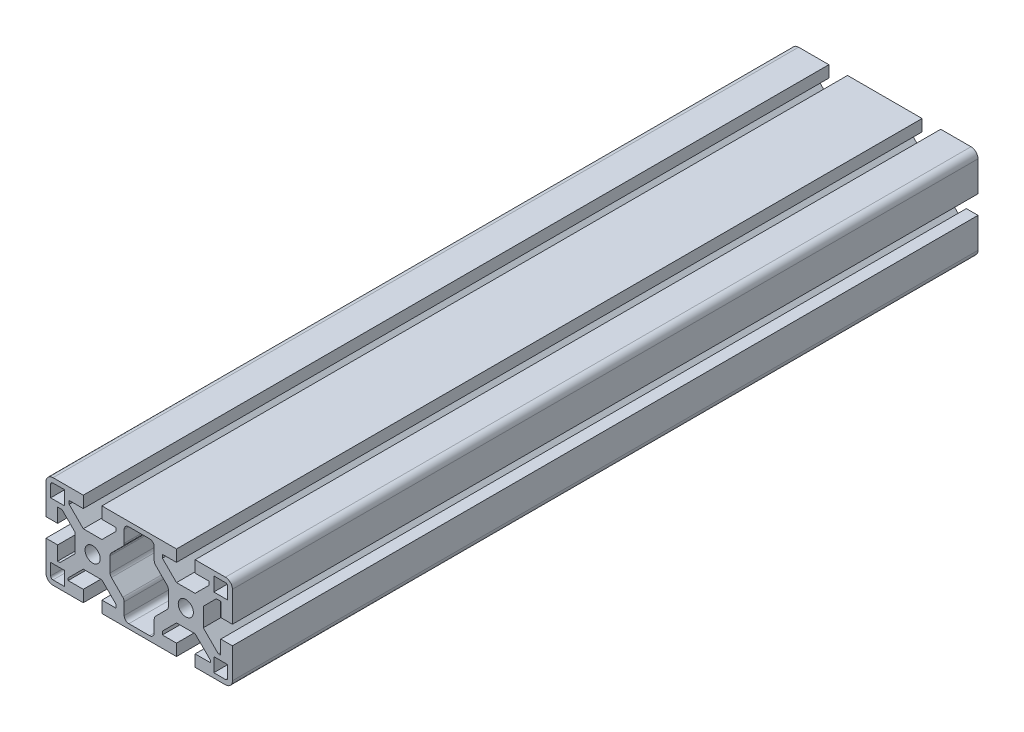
ISO-10303-21;
HEADER;
FILE_DESCRIPTION(('STEP AP214'),'2;1');
FILE_NAME('part.step','',(''),(''),'','','');
FILE_SCHEMA(('AUTOMOTIVE_DESIGN { 1 0 10303 214 1 1 1 1 }'));
ENDSEC;
DATA;
#1=APPLICATION_CONTEXT('core data for automotive mechanical design processes');
#2=APPLICATION_PROTOCOL_DEFINITION('international standard','automotive_design',2000,#1);
#3=PRODUCT_CONTEXT('',#1,'mechanical');
#4=PRODUCT('Part','Part','',(#3));
#5=PRODUCT_RELATED_PRODUCT_CATEGORY('part','',(#4));
#6=PRODUCT_DEFINITION_FORMATION('','',#4);
#7=PRODUCT_DEFINITION_CONTEXT('part definition',#1,'design');
#8=PRODUCT_DEFINITION('design','',#6,#7);
#9=PRODUCT_DEFINITION_SHAPE('','',#8);
#10=(LENGTH_UNIT() NAMED_UNIT(*) SI_UNIT(.MILLI.,.METRE.));
#11=(NAMED_UNIT(*) PLANE_ANGLE_UNIT() SI_UNIT($,.RADIAN.));
#12=(NAMED_UNIT(*) SI_UNIT($,.STERADIAN.) SOLID_ANGLE_UNIT());
#13=UNCERTAINTY_MEASURE_WITH_UNIT(LENGTH_MEASURE(1.E-05),#10,'distance_accuracy_value','');
#14=(GEOMETRIC_REPRESENTATION_CONTEXT(3) GLOBAL_UNCERTAINTY_ASSIGNED_CONTEXT((#13)) GLOBAL_UNIT_ASSIGNED_CONTEXT((#10,
#11,#12)) REPRESENTATION_CONTEXT('',''));
#15=CARTESIAN_POINT('',(0.,0.,0.));
#16=DIRECTION('',(0.,0.,1.));
#17=DIRECTION('',(1.,0.,0.));
#18=AXIS2_PLACEMENT_3D('',#15,#16,#17);
#19=CARTESIAN_POINT('',(57.,-17.,320.));
#20=DIRECTION('',(0.,0.,1.));
#21=DIRECTION('',(1.,0.,0.));
#22=AXIS2_PLACEMENT_3D('',#19,#20,#21);
#23=PLANE('',#22);
#24=DIRECTION('',(0.,-1.,0.));
#25=VECTOR('',#24,1.);
#26=CARTESIAN_POINT('',(13.5499999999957,10.8784271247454,320.));
#27=LINE('',#26,#25);
#28=CARTESIAN_POINT('',(13.5499999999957,16.,320.));
#29=VERTEX_POINT('',#28);
#30=CARTESIAN_POINT('',(13.5499999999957,10.8784271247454,320.));
#31=VERTEX_POINT('',#30);
#32=EDGE_CURVE('E728',#29,#31,#27,.T.);
#33=ORIENTED_EDGE('',*,*,#32,.F.);
#34=CARTESIAN_POINT('',(15.5499999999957,16.,320.));
#35=DIRECTION('',(0.,0.,1.));
#36=DIRECTION('',(-1.,0.,0.));
#37=AXIS2_PLACEMENT_3D('',#34,#35,#36);
#38=CIRCLE('',#37,2.);
#39=CARTESIAN_POINT('',(15.5499999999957,18.,320.));
#40=VERTEX_POINT('',#39);
#41=EDGE_CURVE('E720',#40,#29,#38,.T.);
#42=ORIENTED_EDGE('',*,*,#41,.F.);
#43=DIRECTION('',(-1.,0.,0.));
#44=VECTOR('',#43,1.);
#45=CARTESIAN_POINT('',(24.4500000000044,18.,320.));
#46=LINE('',#45,#44);
#47=CARTESIAN_POINT('',(24.4500000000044,18.,320.));
#48=VERTEX_POINT('',#47);
#49=EDGE_CURVE('E787',#48,#40,#46,.T.);
#50=ORIENTED_EDGE('',*,*,#49,.F.);
#51=CARTESIAN_POINT('',(24.4500000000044,16.,320.));
#52=DIRECTION('',(0.,0.,1.));
#53=DIRECTION('',(1.,0.,0.));
#54=AXIS2_PLACEMENT_3D('',#51,#52,#53);
#55=CIRCLE('',#54,2.);
#56=CARTESIAN_POINT('',(26.4500000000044,16.,320.));
#57=VERTEX_POINT('',#56);
#58=EDGE_CURVE('E785',#57,#48,#55,.T.);
#59=ORIENTED_EDGE('',*,*,#58,.F.);
#60=DIRECTION('',(0.,1.,0.));
#61=VECTOR('',#60,1.);
#62=CARTESIAN_POINT('',(26.4500000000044,10.8784271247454,320.));
#63=LINE('',#62,#61);
#64=CARTESIAN_POINT('',(26.4500000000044,10.8784271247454,320.));
#65=VERTEX_POINT('',#64);
#66=EDGE_CURVE('E783',#65,#57,#63,.T.);
#67=ORIENTED_EDGE('',*,*,#66,.F.);
#68=CARTESIAN_POINT('',(28.4500000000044,10.8784271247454,320.));
#69=DIRECTION('',(0.,0.,-1.));
#70=DIRECTION('',(1.,0.,0.));
#71=AXIS2_PLACEMENT_3D('',#68,#69,#70);
#72=CIRCLE('',#71,2.);
#73=CARTESIAN_POINT('',(27.0357864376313,9.46421356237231,320.));
#74=VERTEX_POINT('',#73);
#75=EDGE_CURVE('E781',#74,#65,#72,.T.);
#76=ORIENTED_EDGE('',*,*,#75,.F.);
#77=DIRECTION('',(-0.707106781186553,0.707106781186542,0.));
#78=VECTOR('',#77,1.);
#79=CARTESIAN_POINT('',(31.914213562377,4.58578643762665,320.));
#80=LINE('',#79,#78);
#81=CARTESIAN_POINT('',(31.914213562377,4.58578643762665,320.));
#82=VERTEX_POINT('',#81);
#83=EDGE_CURVE('E779',#82,#74,#80,.T.);
#84=ORIENTED_EDGE('',*,*,#83,.F.);
#85=CARTESIAN_POINT('',(30.500000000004,3.17157287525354,320.));
#86=DIRECTION('',(0.,0.,1.));
#87=DIRECTION('',(1.,0.,0.));
#88=AXIS2_PLACEMENT_3D('',#85,#86,#87);
#89=CIRCLE('',#88,2.);
#90=CARTESIAN_POINT('',(32.500000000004,3.17157287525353,320.));
#91=VERTEX_POINT('',#90);
#92=EDGE_CURVE('E777',#91,#82,#89,.T.);
#93=ORIENTED_EDGE('',*,*,#92,.F.);
#94=DIRECTION('',(0.,1.,0.));
#95=VECTOR('',#94,1.);
#96=CARTESIAN_POINT('',(32.500000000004,-3.17157287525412,320.));
#97=LINE('',#96,#95);
#98=CARTESIAN_POINT('',(32.500000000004,-3.17157287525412,320.));
#99=VERTEX_POINT('',#98);
#100=EDGE_CURVE('E775',#99,#91,#97,.T.);
#101=ORIENTED_EDGE('',*,*,#100,.F.);
#102=CARTESIAN_POINT('',(30.500000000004,-3.17157287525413,320.));
#103=DIRECTION('',(0.,0.,1.));
#104=DIRECTION('',(-1.,0.,0.));
#105=AXIS2_PLACEMENT_3D('',#102,#103,#104);
#106=CIRCLE('',#105,2.);
#107=CARTESIAN_POINT('',(31.9142135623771,-4.58578643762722,320.));
#108=VERTEX_POINT('',#107);
#109=EDGE_CURVE('E773',#108,#99,#106,.T.);
#110=ORIENTED_EDGE('',*,*,#109,.F.);
#111=DIRECTION('',(0.707106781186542,0.707106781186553,0.));
#112=VECTOR('',#111,1.);
#113=CARTESIAN_POINT('',(31.9142135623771,-4.58578643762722,320.));
#114=LINE('',#113,#112);
#115=CARTESIAN_POINT('',(27.0357864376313,-9.46421356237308,320.));
#116=VERTEX_POINT('',#115);
#117=EDGE_CURVE('E771',#116,#108,#114,.T.);
#118=ORIENTED_EDGE('',*,*,#117,.F.);
#119=CARTESIAN_POINT('',(28.4500000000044,-10.8784271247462,320.));
#120=DIRECTION('',(0.,0.,-1.));
#121=DIRECTION('',(-1.,0.,0.));
#122=AXIS2_PLACEMENT_3D('',#119,#120,#121);
#123=CIRCLE('',#122,2.);
#124=CARTESIAN_POINT('',(26.4500000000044,-10.8784271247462,320.));
#125=VERTEX_POINT('',#124);
#126=EDGE_CURVE('E769',#125,#116,#123,.T.);
#127=ORIENTED_EDGE('',*,*,#126,.F.);
#128=DIRECTION('',(0.,1.,0.));
#129=VECTOR('',#128,1.);
#130=CARTESIAN_POINT('',(26.4500000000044,-10.8784271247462,320.));
#131=LINE('',#130,#129);
#132=CARTESIAN_POINT('',(26.4500000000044,-16.,320.));
#133=VERTEX_POINT('',#132);
#134=EDGE_CURVE('E767',#133,#125,#131,.T.);
#135=ORIENTED_EDGE('',*,*,#134,.F.);
#136=CARTESIAN_POINT('',(24.4500000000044,-16.,320.));
#137=DIRECTION('',(0.,0.,1.));
#138=DIRECTION('',(-1.,0.,0.));
#139=AXIS2_PLACEMENT_3D('',#136,#137,#138);
#140=CIRCLE('',#139,2.);
#141=CARTESIAN_POINT('',(24.4500000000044,-18.,320.));
#142=VERTEX_POINT('',#141);
#143=EDGE_CURVE('E765',#142,#133,#140,.T.);
#144=ORIENTED_EDGE('',*,*,#143,.F.);
#145=DIRECTION('',(1.,0.,0.));
#146=VECTOR('',#145,1.);
#147=CARTESIAN_POINT('',(24.4500000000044,-18.,320.));
#148=LINE('',#147,#146);
#149=CARTESIAN_POINT('',(15.5499999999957,-18.,320.));
#150=VERTEX_POINT('',#149);
#151=EDGE_CURVE('E763',#150,#142,#148,.T.);
#152=ORIENTED_EDGE('',*,*,#151,.F.);
#153=CARTESIAN_POINT('',(15.5499999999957,-16.,320.));
#154=DIRECTION('',(0.,0.,1.));
#155=DIRECTION('',(-1.,0.,0.));
#156=AXIS2_PLACEMENT_3D('',#153,#154,#155);
#157=CIRCLE('',#156,2.);
#158=CARTESIAN_POINT('',(13.5499999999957,-16.,320.));
#159=VERTEX_POINT('',#158);
#160=EDGE_CURVE('E761',#159,#150,#157,.T.);
#161=ORIENTED_EDGE('',*,*,#160,.F.);
#162=DIRECTION('',(0.,-1.,0.));
#163=VECTOR('',#162,1.);
#164=CARTESIAN_POINT('',(13.5499999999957,-10.8784271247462,320.));
#165=LINE('',#164,#163);
#166=CARTESIAN_POINT('',(13.5499999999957,-10.8784271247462,320.));
#167=VERTEX_POINT('',#166);
#168=EDGE_CURVE('E759',#167,#159,#165,.T.);
#169=ORIENTED_EDGE('',*,*,#168,.F.);
#170=CARTESIAN_POINT('',(11.5499999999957,-10.8784271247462,320.));
#171=DIRECTION('',(0.,0.,-1.));
#172=DIRECTION('',(1.,0.,0.));
#173=AXIS2_PLACEMENT_3D('',#170,#171,#172);
#174=CIRCLE('',#173,2.);
#175=CARTESIAN_POINT('',(12.9642135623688,-9.4642135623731,320.));
#176=VERTEX_POINT('',#175);
#177=EDGE_CURVE('E757',#176,#167,#174,.T.);
#178=ORIENTED_EDGE('',*,*,#177,.F.);
#179=DIRECTION('',(0.707106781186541,-0.707106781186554,0.));
#180=VECTOR('',#179,1.);
#181=CARTESIAN_POINT('',(8.085786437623,-4.58578643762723,320.));
#182=LINE('',#181,#180);
#183=CARTESIAN_POINT('',(8.085786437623,-4.58578643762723,320.));
#184=VERTEX_POINT('',#183);
#185=EDGE_CURVE('E755',#184,#176,#182,.T.);
#186=ORIENTED_EDGE('',*,*,#185,.F.);
#187=CARTESIAN_POINT('',(9.4999999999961,-3.17157287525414,320.));
#188=DIRECTION('',(0.,0.,1.));
#189=DIRECTION('',(-1.,0.,0.));
#190=AXIS2_PLACEMENT_3D('',#187,#188,#189);
#191=CIRCLE('',#190,2.);
#192=CARTESIAN_POINT('',(7.49999999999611,-3.17157287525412,320.));
#193=VERTEX_POINT('',#192);
#194=EDGE_CURVE('E753',#193,#184,#191,.T.);
#195=ORIENTED_EDGE('',*,*,#194,.F.);
#196=DIRECTION('',(0.,-1.,0.));
#197=VECTOR('',#196,1.);
#198=CARTESIAN_POINT('',(7.49999999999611,-3.17157287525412,320.));
#199=LINE('',#198,#197);
#200=CARTESIAN_POINT('',(7.49999999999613,3.17157287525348,320.));
#201=VERTEX_POINT('',#200);
#202=EDGE_CURVE('E751',#201,#193,#199,.T.);
#203=ORIENTED_EDGE('',*,*,#202,.F.);
#204=CARTESIAN_POINT('',(9.4999999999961,3.17157287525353,320.));
#205=DIRECTION('',(0.,0.,1.));
#206=DIRECTION('',(-1.,0.,0.));
#207=AXIS2_PLACEMENT_3D('',#204,#205,#206);
#208=CIRCLE('',#207,1.99999999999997);
#209=CARTESIAN_POINT('',(8.08578643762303,4.58578643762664,320.));
#210=VERTEX_POINT('',#209);
#211=EDGE_CURVE('E749',#210,#201,#208,.T.);
#212=ORIENTED_EDGE('',*,*,#211,.F.);
#213=DIRECTION('',(-0.707106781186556,-0.707106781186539,0.));
#214=VECTOR('',#213,1.);
#215=CARTESIAN_POINT('',(8.08578643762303,4.58578643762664,320.));
#216=LINE('',#215,#214);
#217=CARTESIAN_POINT('',(12.9642135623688,9.46421356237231,320.));
#218=VERTEX_POINT('',#217);
#219=EDGE_CURVE('E744',#218,#210,#216,.T.);
#220=ORIENTED_EDGE('',*,*,#219,.F.);
#221=CARTESIAN_POINT('',(11.5499999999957,10.8784271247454,320.));
#222=DIRECTION('',(0.,0.,-1.));
#223=DIRECTION('',(1.,0.,0.));
#224=AXIS2_PLACEMENT_3D('',#221,#222,#223);
#225=CIRCLE('',#224,2.00000000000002);
#226=EDGE_CURVE('E742',#31,#218,#225,.T.);
#227=ORIENTED_EDGE('',*,*,#226,.F.);
#228=EDGE_LOOP('',(#33,#42,#50,#59,#67,#76,#84,#93,#101,#110,#118,#127,#135,#144,#152,#161,#169,
#178,#186,#195,#203,#212,#220,#227));
#229=FACE_BOUND('',#228,.T.);
#230=DIRECTION('',(0.,1.,0.));
#231=VECTOR('',#230,1.);
#232=CARTESIAN_POINT('',(58.,-17.,320.));
#233=LINE('',#232,#231);
#234=CARTESIAN_POINT('',(58.,-17.,320.));
#235=VERTEX_POINT('',#234);
#236=CARTESIAN_POINT('',(58.,-12.,320.));
#237=VERTEX_POINT('',#236);
#238=EDGE_CURVE('E940',#235,#237,#233,.T.);
#239=ORIENTED_EDGE('',*,*,#238,.F.);
#240=CARTESIAN_POINT('',(57.,-17.,320.));
#241=DIRECTION('',(0.,0.,1.));
#242=DIRECTION('',(-1.,0.,0.));
#243=AXIS2_PLACEMENT_3D('',#240,#241,#242);
#244=CIRCLE('',#243,0.999999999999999);
#245=CARTESIAN_POINT('',(57.,-18.,320.));
#246=VERTEX_POINT('',#245);
#247=EDGE_CURVE('E938',#246,#235,#244,.T.);
#248=ORIENTED_EDGE('',*,*,#247,.F.);
#249=DIRECTION('',(1.,0.,0.));
#250=VECTOR('',#249,1.);
#251=CARTESIAN_POINT('',(57.,-18.,320.));
#252=LINE('',#251,#250);
#253=CARTESIAN_POINT('',(52.0000000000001,-18.,320.));
#254=VERTEX_POINT('',#253);
#255=EDGE_CURVE('E948',#254,#246,#252,.T.);
#256=ORIENTED_EDGE('',*,*,#255,.F.);
#257=DIRECTION('',(0.,-1.,0.));
#258=VECTOR('',#257,1.);
#259=CARTESIAN_POINT('',(52.0000000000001,-18.,320.));
#260=LINE('',#259,#258);
#261=CARTESIAN_POINT('',(52.0000000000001,-12.,320.));
#262=VERTEX_POINT('',#261);
#263=EDGE_CURVE('E945',#262,#254,#260,.T.);
#264=ORIENTED_EDGE('',*,*,#263,.F.);
#265=DIRECTION('',(-1.,0.,0.));
#266=VECTOR('',#265,1.);
#267=CARTESIAN_POINT('',(58.,-12.,320.));
#268=LINE('',#267,#266);
#269=EDGE_CURVE('E943',#237,#262,#268,.T.);
#270=ORIENTED_EDGE('',*,*,#269,.F.);
#271=EDGE_LOOP('',(#239,#248,#256,#264,#270));
#272=FACE_BOUND('',#271,.T.);
#273=DIRECTION('',(-1.,0.,0.));
#274=VECTOR('',#273,1.);
#275=CARTESIAN_POINT('',(-18.,-12.,320.));
#276=LINE('',#275,#274);
#277=CARTESIAN_POINT('',(-12.,-12.,320.));
#278=VERTEX_POINT('',#277);
#279=CARTESIAN_POINT('',(-18.,-12.,320.));
#280=VERTEX_POINT('',#279);
#281=EDGE_CURVE('E984',#278,#280,#276,.T.);
#282=ORIENTED_EDGE('',*,*,#281,.F.);
#283=DIRECTION('',(0.,1.,0.));
#284=VECTOR('',#283,1.);
#285=CARTESIAN_POINT('',(-12.,-18.,320.));
#286=LINE('',#285,#284);
#287=CARTESIAN_POINT('',(-12.,-18.,320.));
#288=VERTEX_POINT('',#287);
#289=EDGE_CURVE('E982',#288,#278,#286,.T.);
#290=ORIENTED_EDGE('',*,*,#289,.F.);
#291=DIRECTION('',(1.,0.,0.));
#292=VECTOR('',#291,1.);
#293=CARTESIAN_POINT('',(-17.,-18.,320.));
#294=LINE('',#293,#292);
#295=CARTESIAN_POINT('',(-17.,-18.,320.));
#296=VERTEX_POINT('',#295);
#297=EDGE_CURVE('E992',#296,#288,#294,.T.);
#298=ORIENTED_EDGE('',*,*,#297,.F.);
#299=CARTESIAN_POINT('',(-17.,-17.,320.));
#300=DIRECTION('',(0.,0.,1.));
#301=DIRECTION('',(1.,0.,0.));
#302=AXIS2_PLACEMENT_3D('',#299,#300,#301);
#303=CIRCLE('',#302,1.);
#304=CARTESIAN_POINT('',(-18.,-17.,320.));
#305=VERTEX_POINT('',#304);
#306=EDGE_CURVE('E989',#305,#296,#303,.T.);
#307=ORIENTED_EDGE('',*,*,#306,.F.);
#308=DIRECTION('',(0.,-1.,0.));
#309=VECTOR('',#308,1.);
#310=CARTESIAN_POINT('',(-18.,-17.,320.));
#311=LINE('',#310,#309);
#312=EDGE_CURVE('E987',#280,#305,#311,.T.);
#313=ORIENTED_EDGE('',*,*,#312,.F.);
#314=EDGE_LOOP('',(#282,#290,#298,#307,#313));
#315=FACE_BOUND('',#314,.T.);
#316=CARTESIAN_POINT('',(57.,-17.,320.));
#317=DIRECTION('',(0.,0.,1.));
#318=DIRECTION('',(1.,0.,0.));
#319=AXIS2_PLACEMENT_3D('',#316,#317,#318);
#320=CIRCLE('',#319,3.);
#321=CARTESIAN_POINT('',(57.,-20.,320.));
#322=VERTEX_POINT('',#321);
#323=CARTESIAN_POINT('',(60.0000000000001,-17.,320.));
#324=VERTEX_POINT('',#323);
#325=EDGE_CURVE('E1058',#322,#324,#320,.T.);
#326=ORIENTED_EDGE('',*,*,#325,.T.);
#327=DIRECTION('',(0.,1.,0.));
#328=VECTOR('',#327,1.);
#329=CARTESIAN_POINT('',(60.0000000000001,-17.,320.));
#330=LINE('',#329,#328);
#331=CARTESIAN_POINT('',(60.0000000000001,-4.00000000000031,320.));
#332=VERTEX_POINT('',#331);
#333=EDGE_CURVE('E1061',#324,#332,#330,.T.);
#334=ORIENTED_EDGE('',*,*,#333,.T.);
#335=DIRECTION('',(-1.,0.,0.));
#336=VECTOR('',#335,1.);
#337=CARTESIAN_POINT('',(60.0000000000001,-4.00000000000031,320.));
#338=LINE('',#337,#336);
#339=CARTESIAN_POINT('',(55.0000000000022,-4.00000000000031,320.));
#340=VERTEX_POINT('',#339);
#341=EDGE_CURVE('E1064',#332,#340,#338,.T.);
#342=ORIENTED_EDGE('',*,*,#341,.T.);
#343=DIRECTION('',(0.,-1.,0.));
#344=VECTOR('',#343,1.);
#345=CARTESIAN_POINT('',(55.0000000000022,-10.05,320.));
#346=LINE('',#345,#344);
#347=CARTESIAN_POINT('',(55.0000000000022,-10.05,320.));
#348=VERTEX_POINT('',#347);
#349=EDGE_CURVE('E1066',#340,#348,#346,.T.);
#350=ORIENTED_EDGE('',*,*,#349,.T.);
#351=DIRECTION('',(-1.,0.,0.));
#352=VECTOR('',#351,1.);
#353=CARTESIAN_POINT('',(55.0000000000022,-10.05,320.));
#354=LINE('',#353,#352);
#355=CARTESIAN_POINT('',(53.9999999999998,-10.05,320.));
#356=VERTEX_POINT('',#355);
#357=EDGE_CURVE('E1068',#348,#356,#354,.T.);
#358=ORIENTED_EDGE('',*,*,#357,.T.);
#359=DIRECTION('',(-0.70710678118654,0.707106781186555,0.));
#360=VECTOR('',#359,1.);
#361=CARTESIAN_POINT('',(47.5,-3.55000000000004,320.));
#362=LINE('',#361,#360);
#363=CARTESIAN_POINT('',(47.5,-3.55000000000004,320.));
#364=VERTEX_POINT('',#363);
#365=EDGE_CURVE('E1070',#356,#364,#362,.T.);
#366=ORIENTED_EDGE('',*,*,#365,.T.);
#367=DIRECTION('',(0.,1.,0.));
#368=VECTOR('',#367,1.);
#369=CARTESIAN_POINT('',(47.5,-3.55000000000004,320.));
#370=LINE('',#369,#368);
#371=CARTESIAN_POINT('',(47.5,4.44999999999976,320.));
#372=VERTEX_POINT('',#371);
#373=EDGE_CURVE('E1072',#364,#372,#370,.T.);
#374=ORIENTED_EDGE('',*,*,#373,.T.);
#375=DIRECTION('',(0.707106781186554,0.707106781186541,0.));
#376=VECTOR('',#375,1.);
#377=CARTESIAN_POINT('',(47.5,4.44999999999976,320.));
#378=LINE('',#377,#376);
#379=CARTESIAN_POINT('',(53.0999999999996,10.0499999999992,320.));
#380=VERTEX_POINT('',#379);
#381=EDGE_CURVE('E1074',#372,#380,#378,.T.);
#382=ORIENTED_EDGE('',*,*,#381,.T.);
#383=DIRECTION('',(1.,0.,0.));
#384=VECTOR('',#383,1.);
#385=CARTESIAN_POINT('',(55.0000000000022,10.0499999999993,320.));
#386=LINE('',#385,#384);
#387=CARTESIAN_POINT('',(55.0000000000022,10.0499999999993,320.));
#388=VERTEX_POINT('',#387);
#389=EDGE_CURVE('E1076',#380,#388,#386,.T.);
#390=ORIENTED_EDGE('',*,*,#389,.T.);
#391=DIRECTION('',(0.,-1.,0.));
#392=VECTOR('',#391,1.);
#393=CARTESIAN_POINT('',(55.0000000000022,3.99999999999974,320.));
#394=LINE('',#393,#392);
#395=CARTESIAN_POINT('',(55.0000000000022,3.99999999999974,320.));
#396=VERTEX_POINT('',#395);
#397=EDGE_CURVE('E1078',#388,#396,#394,.T.);
#398=ORIENTED_EDGE('',*,*,#397,.T.);
#399=DIRECTION('',(1.,0.,0.));
#400=VECTOR('',#399,1.);
#401=CARTESIAN_POINT('',(60.0000000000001,3.99999999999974,320.));
#402=LINE('',#401,#400);
#403=CARTESIAN_POINT('',(60.0000000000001,3.99999999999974,320.));
#404=VERTEX_POINT('',#403);
#405=EDGE_CURVE('E1080',#396,#404,#402,.T.);
#406=ORIENTED_EDGE('',*,*,#405,.T.);
#407=DIRECTION('',(0.,1.,0.));
#408=VECTOR('',#407,1.);
#409=CARTESIAN_POINT('',(60.0000000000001,3.99999999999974,320.));
#410=LINE('',#409,#408);
#411=CARTESIAN_POINT('',(60.0000000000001,17.,320.));
#412=VERTEX_POINT('',#411);
#413=EDGE_CURVE('E1082',#404,#412,#410,.T.);
#414=ORIENTED_EDGE('',*,*,#413,.T.);
#415=CARTESIAN_POINT('',(57.,17.,320.));
#416=DIRECTION('',(0.,0.,1.));
#417=DIRECTION('',(1.,0.,0.));
#418=AXIS2_PLACEMENT_3D('',#415,#416,#417);
#419=CIRCLE('',#418,3.);
#420=CARTESIAN_POINT('',(57.,20.,320.));
#421=VERTEX_POINT('',#420);
#422=EDGE_CURVE('E1084',#412,#421,#419,.T.);
#423=ORIENTED_EDGE('',*,*,#422,.T.);
#424=DIRECTION('',(-1.,0.,0.));
#425=VECTOR('',#424,1.);
#426=CARTESIAN_POINT('',(57.,20.,320.));
#427=LINE('',#426,#425);
#428=CARTESIAN_POINT('',(44.,20.,320.));
#429=VERTEX_POINT('',#428);
#430=EDGE_CURVE('E1086',#421,#429,#427,.T.);
#431=ORIENTED_EDGE('',*,*,#430,.T.);
#432=DIRECTION('',(0.,-1.,0.));
#433=VECTOR('',#432,1.);
#434=CARTESIAN_POINT('',(44.,20.,320.));
#435=LINE('',#434,#433);
#436=CARTESIAN_POINT('',(44.,15.,320.));
#437=VERTEX_POINT('',#436);
#438=EDGE_CURVE('E1088',#429,#437,#435,.T.);
#439=ORIENTED_EDGE('',*,*,#438,.T.);
#440=DIRECTION('',(1.,0.,0.));
#441=VECTOR('',#440,1.);
#442=CARTESIAN_POINT('',(50.0628752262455,15.,320.));
#443=LINE('',#442,#441);
#444=CARTESIAN_POINT('',(50.0628752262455,15.,320.));
#445=VERTEX_POINT('',#444);
#446=EDGE_CURVE('E1090',#437,#445,#443,.T.);
#447=ORIENTED_EDGE('',*,*,#446,.T.);
#448=DIRECTION('',(0.,-1.,0.));
#449=VECTOR('',#448,1.);
#450=CARTESIAN_POINT('',(50.0628752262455,13.5499999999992,320.));
#451=LINE('',#450,#449);
#452=CARTESIAN_POINT('',(50.0628752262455,13.5499999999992,320.));
#453=VERTEX_POINT('',#452);
#454=EDGE_CURVE('E1092',#445,#453,#451,.T.);
#455=ORIENTED_EDGE('',*,*,#454,.T.);
#456=DIRECTION('',(-0.707857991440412,-0.706354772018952,0.));
#457=VECTOR('',#456,1.);
#458=CARTESIAN_POINT('',(50.0628752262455,13.5499999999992,320.));
#459=LINE('',#458,#457);
#460=CARTESIAN_POINT('',(44.,7.50000000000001,320.));
#461=VERTEX_POINT('',#460);
#462=EDGE_CURVE('E1094',#453,#461,#459,.T.);
#463=ORIENTED_EDGE('',*,*,#462,.T.);
#464=DIRECTION('',(-1.,0.,0.));
#465=VECTOR('',#464,1.);
#466=CARTESIAN_POINT('',(44.,7.50000000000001,320.));
#467=LINE('',#466,#465);
#468=CARTESIAN_POINT('',(36.,7.50000000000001,320.));
#469=VERTEX_POINT('',#468);
#470=EDGE_CURVE('E1096',#461,#469,#467,.T.);
#471=ORIENTED_EDGE('',*,*,#470,.T.);
#472=DIRECTION('',(-0.707106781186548,0.707106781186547,0.));
#473=VECTOR('',#472,1.);
#474=CARTESIAN_POINT('',(36.,7.50000000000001,320.));
#475=LINE('',#474,#473);
#476=CARTESIAN_POINT('',(29.9500000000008,13.5499999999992,320.));
#477=VERTEX_POINT('',#476);
#478=EDGE_CURVE('E1098',#469,#477,#475,.T.);
#479=ORIENTED_EDGE('',*,*,#478,.T.);
#480=DIRECTION('',(0.,1.,0.));
#481=VECTOR('',#480,1.);
#482=CARTESIAN_POINT('',(29.9500000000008,13.5499999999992,320.));
#483=LINE('',#482,#481);
#484=CARTESIAN_POINT('',(29.9500000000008,15.,320.));
#485=VERTEX_POINT('',#484);
#486=EDGE_CURVE('E1100',#477,#485,#483,.T.);
#487=ORIENTED_EDGE('',*,*,#486,.T.);
#488=DIRECTION('',(1.,0.,0.));
#489=VECTOR('',#488,1.);
#490=CARTESIAN_POINT('',(36.,15.,320.));
#491=LINE('',#490,#489);
#492=CARTESIAN_POINT('',(36.,15.,320.));
#493=VERTEX_POINT('',#492);
#494=EDGE_CURVE('E1102',#485,#493,#491,.T.);
#495=ORIENTED_EDGE('',*,*,#494,.T.);
#496=DIRECTION('',(0.,1.,0.));
#497=VECTOR('',#496,1.);
#498=CARTESIAN_POINT('',(36.,20.,320.));
#499=LINE('',#498,#497);
#500=CARTESIAN_POINT('',(36.,20.,320.));
#501=VERTEX_POINT('',#500);
#502=EDGE_CURVE('E1104',#493,#501,#499,.T.);
#503=ORIENTED_EDGE('',*,*,#502,.T.);
#504=DIRECTION('',(-1.,0.,0.));
#505=VECTOR('',#504,1.);
#506=CARTESIAN_POINT('',(4.00000000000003,20.,320.));
#507=LINE('',#506,#505);
#508=CARTESIAN_POINT('',(4.00000000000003,20.,320.));
#509=VERTEX_POINT('',#508);
#510=EDGE_CURVE('E1106',#501,#509,#507,.T.);
#511=ORIENTED_EDGE('',*,*,#510,.T.);
#512=DIRECTION('',(0.,-1.,0.));
#513=VECTOR('',#512,1.);
#514=CARTESIAN_POINT('',(4.00000000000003,20.,320.));
#515=LINE('',#514,#513);
#516=CARTESIAN_POINT('',(4.00000000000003,15.,320.));
#517=VERTEX_POINT('',#516);
#518=EDGE_CURVE('E1108',#509,#517,#515,.T.);
#519=ORIENTED_EDGE('',*,*,#518,.T.);
#520=DIRECTION('',(1.,0.,0.));
#521=VECTOR('',#520,1.);
#522=CARTESIAN_POINT('',(4.00000000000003,15.,320.));
#523=LINE('',#522,#521);
#524=CARTESIAN_POINT('',(10.0499999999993,15.,320.));
#525=VERTEX_POINT('',#524);
#526=EDGE_CURVE('E1110',#517,#525,#523,.T.);
#527=ORIENTED_EDGE('',*,*,#526,.T.);
#528=DIRECTION('',(0.,-1.,0.));
#529=VECTOR('',#528,1.);
#530=CARTESIAN_POINT('',(10.0499999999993,13.5499999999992,320.));
#531=LINE('',#530,#529);
#532=CARTESIAN_POINT('',(10.0499999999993,13.5499999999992,320.));
#533=VERTEX_POINT('',#532);
#534=EDGE_CURVE('E1112',#525,#533,#531,.T.);
#535=ORIENTED_EDGE('',*,*,#534,.T.);
#536=DIRECTION('',(-0.707106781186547,-0.707106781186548,0.));
#537=VECTOR('',#536,1.);
#538=CARTESIAN_POINT('',(4.00000000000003,7.5,320.));
#539=LINE('',#538,#537);
#540=CARTESIAN_POINT('',(4.00000000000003,7.5,320.));
#541=VERTEX_POINT('',#540);
#542=EDGE_CURVE('E1114',#533,#541,#539,.T.);
#543=ORIENTED_EDGE('',*,*,#542,.T.);
#544=DIRECTION('',(-1.,0.,0.));
#545=VECTOR('',#544,1.);
#546=CARTESIAN_POINT('',(-3.99999999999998,7.5,320.));
#547=LINE('',#546,#545);
#548=CARTESIAN_POINT('',(-3.99999999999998,7.5,320.));
#549=VERTEX_POINT('',#548);
#550=EDGE_CURVE('E1116',#541,#549,#547,.T.);
#551=ORIENTED_EDGE('',*,*,#550,.T.);
#552=DIRECTION('',(-0.707857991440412,0.706354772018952,0.));
#553=VECTOR('',#552,1.);
#554=CARTESIAN_POINT('',(-10.0628752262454,13.5499999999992,320.));
#555=LINE('',#554,#553);
#556=CARTESIAN_POINT('',(-10.0628752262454,13.5499999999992,320.));
#557=VERTEX_POINT('',#556);
#558=EDGE_CURVE('E1118',#549,#557,#555,.T.);
#559=ORIENTED_EDGE('',*,*,#558,.T.);
#560=DIRECTION('',(0.,1.,0.));
#561=VECTOR('',#560,1.);
#562=CARTESIAN_POINT('',(-10.0628752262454,13.5499999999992,320.));
#563=LINE('',#562,#561);
#564=CARTESIAN_POINT('',(-10.0628752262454,15.,320.));
#565=VERTEX_POINT('',#564);
#566=EDGE_CURVE('E1120',#557,#565,#563,.T.);
#567=ORIENTED_EDGE('',*,*,#566,.T.);
#568=DIRECTION('',(1.,0.,0.));
#569=VECTOR('',#568,1.);
#570=CARTESIAN_POINT('',(-10.0628752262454,15.,320.));
#571=LINE('',#570,#569);
#572=CARTESIAN_POINT('',(-3.99999999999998,15.,320.));
#573=VERTEX_POINT('',#572);
#574=EDGE_CURVE('E1122',#565,#573,#571,.T.);
#575=ORIENTED_EDGE('',*,*,#574,.T.);
#576=DIRECTION('',(0.,1.,0.));
#577=VECTOR('',#576,1.);
#578=CARTESIAN_POINT('',(-3.99999999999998,20.,320.));
#579=LINE('',#578,#577);
#580=CARTESIAN_POINT('',(-3.99999999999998,20.,320.));
#581=VERTEX_POINT('',#580);
#582=EDGE_CURVE('E1124',#573,#581,#579,.T.);
#583=ORIENTED_EDGE('',*,*,#582,.T.);
#584=DIRECTION('',(-1.,0.,0.));
#585=VECTOR('',#584,1.);
#586=CARTESIAN_POINT('',(-17.,20.,320.));
#587=LINE('',#586,#585);
#588=CARTESIAN_POINT('',(-17.,20.,320.));
#589=VERTEX_POINT('',#588);
#590=EDGE_CURVE('E1126',#581,#589,#587,.T.);
#591=ORIENTED_EDGE('',*,*,#590,.T.);
#592=CARTESIAN_POINT('',(-17.,17.,320.));
#593=DIRECTION('',(0.,0.,1.));
#594=DIRECTION('',(-1.,0.,0.));
#595=AXIS2_PLACEMENT_3D('',#592,#593,#594);
#596=CIRCLE('',#595,3.);
#597=CARTESIAN_POINT('',(-20.,17.,320.));
#598=VERTEX_POINT('',#597);
#599=EDGE_CURVE('E1128',#589,#598,#596,.T.);
#600=ORIENTED_EDGE('',*,*,#599,.T.);
#601=DIRECTION('',(0.,-1.,0.));
#602=VECTOR('',#601,1.);
#603=CARTESIAN_POINT('',(-20.,3.99999999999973,320.));
#604=LINE('',#603,#602);
#605=CARTESIAN_POINT('',(-20.,3.99999999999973,320.));
#606=VERTEX_POINT('',#605);
#607=EDGE_CURVE('E1130',#598,#606,#604,.T.);
#608=ORIENTED_EDGE('',*,*,#607,.T.);
#609=DIRECTION('',(1.,0.,0.));
#610=VECTOR('',#609,1.);
#611=CARTESIAN_POINT('',(-20.,3.99999999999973,320.));
#612=LINE('',#611,#610);
#613=CARTESIAN_POINT('',(-15.0000000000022,3.99999999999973,320.));
#614=VERTEX_POINT('',#613);
#615=EDGE_CURVE('E1132',#606,#614,#612,.T.);
#616=ORIENTED_EDGE('',*,*,#615,.T.);
#617=DIRECTION('',(0.,1.,0.));
#618=VECTOR('',#617,1.);
#619=CARTESIAN_POINT('',(-15.0000000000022,3.99999999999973,320.));
#620=LINE('',#619,#618);
#621=CARTESIAN_POINT('',(-15.0000000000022,10.0499999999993,320.));
#622=VERTEX_POINT('',#621);
#623=EDGE_CURVE('E1134',#614,#622,#620,.T.);
#624=ORIENTED_EDGE('',*,*,#623,.T.);
#625=DIRECTION('',(1.,0.,0.));
#626=VECTOR('',#625,1.);
#627=CARTESIAN_POINT('',(-15.0000000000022,10.0499999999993,320.));
#628=LINE('',#627,#626);
#629=CARTESIAN_POINT('',(-13.0999999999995,10.0499999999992,320.));
#630=VERTEX_POINT('',#629);
#631=EDGE_CURVE('E1136',#622,#630,#628,.T.);
#632=ORIENTED_EDGE('',*,*,#631,.T.);
#633=DIRECTION('',(0.707106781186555,-0.70710678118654,0.));
#634=VECTOR('',#633,1.);
#635=CARTESIAN_POINT('',(-7.49999999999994,4.44999999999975,320.));
#636=LINE('',#635,#634);
#637=CARTESIAN_POINT('',(-7.49999999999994,4.44999999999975,320.));
#638=VERTEX_POINT('',#637);
#639=EDGE_CURVE('E1138',#630,#638,#636,.T.);
#640=ORIENTED_EDGE('',*,*,#639,.T.);
#641=DIRECTION('',(0.,-1.,0.));
#642=VECTOR('',#641,1.);
#643=CARTESIAN_POINT('',(-7.49999999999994,-3.55000000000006,320.));
#644=LINE('',#643,#642);
#645=CARTESIAN_POINT('',(-7.49999999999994,-3.55000000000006,320.));
#646=VERTEX_POINT('',#645);
#647=EDGE_CURVE('E1140',#638,#646,#644,.T.);
#648=ORIENTED_EDGE('',*,*,#647,.T.);
#649=DIRECTION('',(-0.70710678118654,-0.707106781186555,0.));
#650=VECTOR('',#649,1.);
#651=CARTESIAN_POINT('',(-7.49999999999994,-3.55000000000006,320.));
#652=LINE('',#651,#650);
#653=CARTESIAN_POINT('',(-13.9999999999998,-10.05,320.));
#654=VERTEX_POINT('',#653);
#655=EDGE_CURVE('E1142',#646,#654,#652,.T.);
#656=ORIENTED_EDGE('',*,*,#655,.T.);
#657=DIRECTION('',(-1.,0.,0.));
#658=VECTOR('',#657,1.);
#659=CARTESIAN_POINT('',(-15.0000000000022,-10.05,320.));
#660=LINE('',#659,#658);
#661=CARTESIAN_POINT('',(-15.0000000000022,-10.05,320.));
#662=VERTEX_POINT('',#661);
#663=EDGE_CURVE('E1144',#654,#662,#660,.T.);
#664=ORIENTED_EDGE('',*,*,#663,.T.);
#665=DIRECTION('',(0.,1.,0.));
#666=VECTOR('',#665,1.);
#667=CARTESIAN_POINT('',(-15.0000000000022,-10.05,320.));
#668=LINE('',#667,#666);
#669=CARTESIAN_POINT('',(-15.0000000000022,-4.00000000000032,320.));
#670=VERTEX_POINT('',#669);
#671=EDGE_CURVE('E1146',#662,#670,#668,.T.);
#672=ORIENTED_EDGE('',*,*,#671,.T.);
#673=DIRECTION('',(-1.,0.,0.));
#674=VECTOR('',#673,1.);
#675=CARTESIAN_POINT('',(-20.,-4.00000000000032,320.));
#676=LINE('',#675,#674);
#677=CARTESIAN_POINT('',(-20.,-4.00000000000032,320.));
#678=VERTEX_POINT('',#677);
#679=EDGE_CURVE('E1148',#670,#678,#676,.T.);
#680=ORIENTED_EDGE('',*,*,#679,.T.);
#681=DIRECTION('',(0.,-1.,0.));
#682=VECTOR('',#681,1.);
#683=CARTESIAN_POINT('',(-20.,-17.,320.));
#684=LINE('',#683,#682);
#685=CARTESIAN_POINT('',(-20.,-17.,320.));
#686=VERTEX_POINT('',#685);
#687=EDGE_CURVE('E1150',#678,#686,#684,.T.);
#688=ORIENTED_EDGE('',*,*,#687,.T.);
#689=CARTESIAN_POINT('',(-17.,-17.,320.));
#690=DIRECTION('',(0.,0.,1.));
#691=DIRECTION('',(-1.,0.,0.));
#692=AXIS2_PLACEMENT_3D('',#689,#690,#691);
#693=CIRCLE('',#692,3.);
#694=CARTESIAN_POINT('',(-17.,-20.,320.));
#695=VERTEX_POINT('',#694);
#696=EDGE_CURVE('E1152',#686,#695,#693,.T.);
#697=ORIENTED_EDGE('',*,*,#696,.T.);
#698=DIRECTION('',(1.,0.,0.));
#699=VECTOR('',#698,1.);
#700=CARTESIAN_POINT('',(-17.,-20.,320.));
#701=LINE('',#700,#699);
#702=CARTESIAN_POINT('',(-4.,-20.,320.));
#703=VERTEX_POINT('',#702);
#704=EDGE_CURVE('E1154',#695,#703,#701,.T.);
#705=ORIENTED_EDGE('',*,*,#704,.T.);
#706=DIRECTION('',(0.,1.,0.));
#707=VECTOR('',#706,1.);
#708=CARTESIAN_POINT('',(-4.,-20.,320.));
#709=LINE('',#708,#707);
#710=CARTESIAN_POINT('',(-3.99999999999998,-14.9999999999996,320.));
#711=VERTEX_POINT('',#710);
#712=EDGE_CURVE('E1156',#703,#711,#709,.T.);
#713=ORIENTED_EDGE('',*,*,#712,.T.);
#714=DIRECTION('',(-1.,0.,0.));
#715=VECTOR('',#714,1.);
#716=CARTESIAN_POINT('',(-10.4999999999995,-14.9999999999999,320.));
#717=LINE('',#716,#715);
#718=CARTESIAN_POINT('',(-10.4999999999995,-14.9999999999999,320.));
#719=VERTEX_POINT('',#718);
#720=EDGE_CURVE('E1158',#711,#719,#717,.T.);
#721=ORIENTED_EDGE('',*,*,#720,.T.);
#722=DIRECTION('',(0.,1.,0.));
#723=VECTOR('',#722,1.);
#724=CARTESIAN_POINT('',(-10.4999999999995,-13.9999999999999,320.));
#725=LINE('',#724,#723);
#726=CARTESIAN_POINT('',(-10.4999999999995,-13.9999999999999,320.));
#727=VERTEX_POINT('',#726);
#728=EDGE_CURVE('E1160',#719,#727,#725,.T.);
#729=ORIENTED_EDGE('',*,*,#728,.T.);
#730=DIRECTION('',(0.707106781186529,0.707106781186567,0.));
#731=VECTOR('',#730,1.);
#732=CARTESIAN_POINT('',(-10.4999999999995,-13.9999999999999,320.));
#733=LINE('',#732,#731);
#734=CARTESIAN_POINT('',(-4.,-7.5,320.));
#735=VERTEX_POINT('',#734);
#736=EDGE_CURVE('E1162',#727,#735,#733,.T.);
#737=ORIENTED_EDGE('',*,*,#736,.T.);
#738=DIRECTION('',(1.,0.,0.));
#739=VECTOR('',#738,1.);
#740=CARTESIAN_POINT('',(-4.,-7.5,320.));
#741=LINE('',#740,#739);
#742=CARTESIAN_POINT('',(4.,-7.5,320.));
#743=VERTEX_POINT('',#742);
#744=EDGE_CURVE('E1164',#735,#743,#741,.T.);
#745=ORIENTED_EDGE('',*,*,#744,.T.);
#746=DIRECTION('',(0.70710678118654,-0.707106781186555,0.));
#747=VECTOR('',#746,1.);
#748=CARTESIAN_POINT('',(4.,-7.5,320.));
#749=LINE('',#748,#747);
#750=CARTESIAN_POINT('',(10.0499999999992,-13.5499999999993,320.));
#751=VERTEX_POINT('',#750);
#752=EDGE_CURVE('E1166',#743,#751,#749,.T.);
#753=ORIENTED_EDGE('',*,*,#752,.T.);
#754=DIRECTION('',(0.,-1.,0.));
#755=VECTOR('',#754,1.);
#756=CARTESIAN_POINT('',(10.0499999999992,-14.9999999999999,320.));
#757=LINE('',#756,#755);
#758=CARTESIAN_POINT('',(10.0499999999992,-14.9999999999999,320.));
#759=VERTEX_POINT('',#758);
#760=EDGE_CURVE('E1168',#751,#759,#757,.T.);
#761=ORIENTED_EDGE('',*,*,#760,.T.);
#762=DIRECTION('',(-1.,0.,0.));
#763=VECTOR('',#762,1.);
#764=CARTESIAN_POINT('',(4.00000000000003,-14.9999999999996,320.));
#765=LINE('',#764,#763);
#766=CARTESIAN_POINT('',(4.00000000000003,-14.9999999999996,320.));
#767=VERTEX_POINT('',#766);
#768=EDGE_CURVE('E1170',#759,#767,#765,.T.);
#769=ORIENTED_EDGE('',*,*,#768,.T.);
#770=DIRECTION('',(0.,-1.,0.));
#771=VECTOR('',#770,1.);
#772=CARTESIAN_POINT('',(4.,-20.,320.));
#773=LINE('',#772,#771);
#774=CARTESIAN_POINT('',(4.,-20.,320.));
#775=VERTEX_POINT('',#774);
#776=EDGE_CURVE('E1172',#767,#775,#773,.T.);
#777=ORIENTED_EDGE('',*,*,#776,.T.);
#778=DIRECTION('',(1.,0.,0.));
#779=VECTOR('',#778,1.);
#780=CARTESIAN_POINT('',(36.0000000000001,-20.,320.));
#781=LINE('',#780,#779);
#782=CARTESIAN_POINT('',(36.0000000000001,-20.,320.));
#783=VERTEX_POINT('',#782);
#784=EDGE_CURVE('E1174',#775,#783,#781,.T.);
#785=ORIENTED_EDGE('',*,*,#784,.T.);
#786=DIRECTION('',(0.,1.,0.));
#787=VECTOR('',#786,1.);
#788=CARTESIAN_POINT('',(36.0000000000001,-20.,320.));
#789=LINE('',#788,#787);
#790=CARTESIAN_POINT('',(36.,-14.9999999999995,320.));
#791=VERTEX_POINT('',#790);
#792=EDGE_CURVE('E1176',#783,#791,#789,.T.);
#793=ORIENTED_EDGE('',*,*,#792,.T.);
#794=DIRECTION('',(-1.,0.,0.));
#795=VECTOR('',#794,1.);
#796=CARTESIAN_POINT('',(36.,-14.9999999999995,320.));
#797=LINE('',#796,#795);
#798=CARTESIAN_POINT('',(29.9500000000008,-15.,320.));
#799=VERTEX_POINT('',#798);
#800=EDGE_CURVE('E1178',#791,#799,#797,.T.);
#801=ORIENTED_EDGE('',*,*,#800,.T.);
#802=DIRECTION('',(0.,1.,0.));
#803=VECTOR('',#802,1.);
#804=CARTESIAN_POINT('',(29.9500000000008,-15.,320.));
#805=LINE('',#804,#803);
#806=CARTESIAN_POINT('',(29.9500000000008,-13.5499999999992,320.));
#807=VERTEX_POINT('',#806);
#808=EDGE_CURVE('E1180',#799,#807,#805,.T.);
#809=ORIENTED_EDGE('',*,*,#808,.T.);
#810=DIRECTION('',(0.70710678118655,0.707106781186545,0.));
#811=VECTOR('',#810,1.);
#812=CARTESIAN_POINT('',(36.0000000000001,-7.49999999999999,320.));
#813=LINE('',#812,#811);
#814=CARTESIAN_POINT('',(36.0000000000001,-7.49999999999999,320.));
#815=VERTEX_POINT('',#814);
#816=EDGE_CURVE('E1182',#807,#815,#813,.T.);
#817=ORIENTED_EDGE('',*,*,#816,.T.);
#818=DIRECTION('',(1.,0.,0.));
#819=VECTOR('',#818,1.);
#820=CARTESIAN_POINT('',(44.,-7.49999999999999,320.));
#821=LINE('',#820,#819);
#822=CARTESIAN_POINT('',(44.,-7.49999999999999,320.));
#823=VERTEX_POINT('',#822);
#824=EDGE_CURVE('E1184',#815,#823,#821,.T.);
#825=ORIENTED_EDGE('',*,*,#824,.T.);
#826=DIRECTION('',(0.70710678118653,-0.707106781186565,0.));
#827=VECTOR('',#826,1.);
#828=CARTESIAN_POINT('',(50.4999999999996,-13.9999999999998,320.));
#829=LINE('',#828,#827);
#830=CARTESIAN_POINT('',(50.4999999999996,-13.9999999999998,320.));
#831=VERTEX_POINT('',#830);
#832=EDGE_CURVE('E1186',#823,#831,#829,.T.);
#833=ORIENTED_EDGE('',*,*,#832,.T.);
#834=DIRECTION('',(0.,-1.,0.));
#835=VECTOR('',#834,1.);
#836=CARTESIAN_POINT('',(50.4999999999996,-13.9999999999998,320.));
#837=LINE('',#836,#835);
#838=CARTESIAN_POINT('',(50.4999999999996,-14.9999999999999,320.));
#839=VERTEX_POINT('',#838);
#840=EDGE_CURVE('E1188',#831,#839,#837,.T.);
#841=ORIENTED_EDGE('',*,*,#840,.T.);
#842=DIRECTION('',(-1.,0.,0.));
#843=VECTOR('',#842,1.);
#844=CARTESIAN_POINT('',(50.4999999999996,-14.9999999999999,320.));
#845=LINE('',#844,#843);
#846=CARTESIAN_POINT('',(44.,-14.9999999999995,320.));
#847=VERTEX_POINT('',#846);
#848=EDGE_CURVE('E1190',#839,#847,#845,.T.);
#849=ORIENTED_EDGE('',*,*,#848,.T.);
#850=DIRECTION('',(0.,-1.,0.));
#851=VECTOR('',#850,1.);
#852=CARTESIAN_POINT('',(44.,-20.,320.));
#853=LINE('',#852,#851);
#854=CARTESIAN_POINT('',(44.,-20.,320.));
#855=VERTEX_POINT('',#854);
#856=EDGE_CURVE('E1192',#847,#855,#853,.T.);
#857=ORIENTED_EDGE('',*,*,#856,.T.);
#858=DIRECTION('',(1.,0.,0.));
#859=VECTOR('',#858,1.);
#860=CARTESIAN_POINT('',(57.,-20.,320.));
#861=LINE('',#860,#859);
#862=EDGE_CURVE('E1194',#855,#322,#861,.T.);
#863=ORIENTED_EDGE('',*,*,#862,.T.);
#864=EDGE_LOOP('',(#326,#334,#342,#350,#358,#366,#374,#382,#390,#398,#406,#414,#423,#431,#439,
#447,#455,#463,#471,#479,#487,#495,#503,#511,#519,#527,#535,#543,#551,#559,#567,#575,#583,#591,
#600,#608,#616,#624,#632,#640,#648,#656,#664,#672,#680,#688,#697,#705,#713,#721,#729,#737,#745,
#753,#761,#769,#777,#785,#793,#801,#809,#817,#825,#833,#841,#849,#857,#863));
#865=FACE_BOUND('',#864,.T.);
#866=DIRECTION('',(-1.,0.,0.));
#867=VECTOR('',#866,1.);
#868=CARTESIAN_POINT('',(-17.,18.,320.));
#869=LINE('',#868,#867);
#870=CARTESIAN_POINT('',(-12.,18.,320.));
#871=VERTEX_POINT('',#870);
#872=CARTESIAN_POINT('',(-17.,18.,320.));
#873=VERTEX_POINT('',#872);
#874=EDGE_CURVE('E1022',#871,#873,#869,.T.);
#875=ORIENTED_EDGE('',*,*,#874,.F.);
#876=DIRECTION('',(0.,1.,0.));
#877=VECTOR('',#876,1.);
#878=CARTESIAN_POINT('',(-12.,12.,320.));
#879=LINE('',#878,#877);
#880=CARTESIAN_POINT('',(-12.,12.,320.));
#881=VERTEX_POINT('',#880);
#882=EDGE_CURVE('E1020',#881,#871,#879,.T.);
#883=ORIENTED_EDGE('',*,*,#882,.F.);
#884=DIRECTION('',(1.,0.,0.));
#885=VECTOR('',#884,1.);
#886=CARTESIAN_POINT('',(-18.,12.,320.));
#887=LINE('',#886,#885);
#888=CARTESIAN_POINT('',(-18.,12.,320.));
#889=VERTEX_POINT('',#888);
#890=EDGE_CURVE('E1030',#889,#881,#887,.T.);
#891=ORIENTED_EDGE('',*,*,#890,.F.);
#892=DIRECTION('',(0.,-1.,0.));
#893=VECTOR('',#892,1.);
#894=CARTESIAN_POINT('',(-18.,12.,320.));
#895=LINE('',#894,#893);
#896=CARTESIAN_POINT('',(-18.,17.,320.));
#897=VERTEX_POINT('',#896);
#898=EDGE_CURVE('E1027',#897,#889,#895,.T.);
#899=ORIENTED_EDGE('',*,*,#898,.F.);
#900=CARTESIAN_POINT('',(-17.,17.,320.));
#901=DIRECTION('',(0.,0.,1.));
#902=DIRECTION('',(-1.,0.,0.));
#903=AXIS2_PLACEMENT_3D('',#900,#901,#902);
#904=CIRCLE('',#903,1.);
#905=EDGE_CURVE('E1025',#873,#897,#904,.T.);
#906=ORIENTED_EDGE('',*,*,#905,.F.);
#907=EDGE_LOOP('',(#875,#883,#891,#899,#906));
#908=FACE_BOUND('',#907,.T.);
#909=CARTESIAN_POINT('',(40.0000000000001,0.,320.));
#910=DIRECTION('',(0.,0.,1.));
#911=DIRECTION('',(-1.,0.,0.));
#912=AXIS2_PLACEMENT_3D('',#909,#910,#911);
#913=CIRCLE('',#912,3.25);
#914=CARTESIAN_POINT('',(36.7500000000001,0.,320.));
#915=VERTEX_POINT('',#914);
#916=EDGE_CURVE('E976',#915,#915,#913,.T.);
#917=ORIENTED_EDGE('',*,*,#916,.F.);
#918=EDGE_LOOP('',(#917));
#919=FACE_BOUND('',#918,.T.);
#920=DIRECTION('',(-1.,0.,0.));
#921=VECTOR('',#920,1.);
#922=CARTESIAN_POINT('',(57.,18.,320.));
#923=LINE('',#922,#921);
#924=CARTESIAN_POINT('',(57.,18.,320.));
#925=VERTEX_POINT('',#924);
#926=CARTESIAN_POINT('',(52.0000000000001,18.,320.));
#927=VERTEX_POINT('',#926);
#928=EDGE_CURVE('E902',#925,#927,#923,.T.);
#929=ORIENTED_EDGE('',*,*,#928,.F.);
#930=CARTESIAN_POINT('',(57.,17.,320.));
#931=DIRECTION('',(0.,0.,1.));
#932=DIRECTION('',(1.,0.,0.));
#933=AXIS2_PLACEMENT_3D('',#930,#931,#932);
#934=CIRCLE('',#933,1.);
#935=CARTESIAN_POINT('',(58.,17.,320.));
#936=VERTEX_POINT('',#935);
#937=EDGE_CURVE('E900',#936,#925,#934,.T.);
#938=ORIENTED_EDGE('',*,*,#937,.F.);
#939=DIRECTION('',(0.,1.,0.));
#940=VECTOR('',#939,1.);
#941=CARTESIAN_POINT('',(58.,12.,320.));
#942=LINE('',#941,#940);
#943=CARTESIAN_POINT('',(58.,12.,320.));
#944=VERTEX_POINT('',#943);
#945=EDGE_CURVE('E910',#944,#936,#942,.T.);
#946=ORIENTED_EDGE('',*,*,#945,.F.);
#947=DIRECTION('',(1.,0.,0.));
#948=VECTOR('',#947,1.);
#949=CARTESIAN_POINT('',(58.,12.,320.));
#950=LINE('',#949,#948);
#951=CARTESIAN_POINT('',(52.0000000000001,12.,320.));
#952=VERTEX_POINT('',#951);
#953=EDGE_CURVE('E907',#952,#944,#950,.T.);
#954=ORIENTED_EDGE('',*,*,#953,.F.);
#955=DIRECTION('',(0.,-1.,0.));
#956=VECTOR('',#955,1.);
#957=CARTESIAN_POINT('',(52.0000000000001,12.,320.));
#958=LINE('',#957,#956);
#959=EDGE_CURVE('E905',#927,#952,#958,.T.);
#960=ORIENTED_EDGE('',*,*,#959,.F.);
#961=EDGE_LOOP('',(#929,#938,#946,#954,#960));
#962=FACE_BOUND('',#961,.T.);
#963=CARTESIAN_POINT('',(0.,0.,320.));
#964=DIRECTION('',(0.,0.,1.));
#965=DIRECTION('',(1.,0.,0.));
#966=AXIS2_PLACEMENT_3D('',#963,#964,#965);
#967=CIRCLE('',#966,3.25);
#968=CARTESIAN_POINT('',(3.25,0.,320.));
#969=VERTEX_POINT('',#968);
#970=EDGE_CURVE('E790',#969,#969,#967,.T.);
#971=ORIENTED_EDGE('',*,*,#970,.F.);
#972=EDGE_LOOP('',(#971));
#973=FACE_BOUND('',#972,.T.);
#974=ADVANCED_FACE('F31',(#229,#272,#315,#865,#908,#919,#962,#973),#23,.T.);
#975=CARTESIAN_POINT('',(57.,-17.,0.));
#976=DIRECTION('',(0.,0.,1.));
#977=DIRECTION('',(1.,0.,0.));
#978=AXIS2_PLACEMENT_3D('',#975,#976,#977);
#979=PLANE('',#978);
#980=CARTESIAN_POINT('',(15.5499999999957,16.,0.));
#981=DIRECTION('',(0.,0.,1.));
#982=DIRECTION('',(-1.,0.,0.));
#983=AXIS2_PLACEMENT_3D('',#980,#981,#982);
#984=CIRCLE('',#983,2.);
#985=CARTESIAN_POINT('',(15.5499999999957,18.,0.));
#986=VERTEX_POINT('',#985);
#987=CARTESIAN_POINT('',(13.5499999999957,16.,0.));
#988=VERTEX_POINT('',#987);
#989=EDGE_CURVE('E54',#986,#988,#984,.T.);
#990=ORIENTED_EDGE('',*,*,#989,.T.);
#991=DIRECTION('',(0.,-1.,0.));
#992=VECTOR('',#991,1.);
#993=CARTESIAN_POINT('',(13.5499999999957,10.8784271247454,0.));
#994=LINE('',#993,#992);
#995=CARTESIAN_POINT('',(13.5499999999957,10.8784271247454,0.));
#996=VERTEX_POINT('',#995);
#997=EDGE_CURVE('E735',#988,#996,#994,.T.);
#998=ORIENTED_EDGE('',*,*,#997,.T.);
#999=CARTESIAN_POINT('',(11.5499999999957,10.8784271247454,0.));
#1000=DIRECTION('',(0.,0.,-1.));
#1001=DIRECTION('',(1.,0.,0.));
#1002=AXIS2_PLACEMENT_3D('',#999,#1000,#1001);
#1003=CIRCLE('',#1002,2.00000000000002);
#1004=CARTESIAN_POINT('',(12.9642135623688,9.46421356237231,0.));
#1005=VERTEX_POINT('',#1004);
#1006=EDGE_CURVE('E792',#996,#1005,#1003,.T.);
#1007=ORIENTED_EDGE('',*,*,#1006,.T.);
#1008=DIRECTION('',(-0.707106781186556,-0.707106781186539,0.));
#1009=VECTOR('',#1008,1.);
#1010=CARTESIAN_POINT('',(8.08578643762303,4.58578643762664,0.));
#1011=LINE('',#1010,#1009);
#1012=CARTESIAN_POINT('',(8.08578643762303,4.58578643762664,0.));
#1013=VERTEX_POINT('',#1012);
#1014=EDGE_CURVE('E795',#1005,#1013,#1011,.T.);
#1015=ORIENTED_EDGE('',*,*,#1014,.T.);
#1016=CARTESIAN_POINT('',(9.4999999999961,3.17157287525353,0.));
#1017=DIRECTION('',(0.,0.,1.));
#1018=DIRECTION('',(-1.,0.,0.));
#1019=AXIS2_PLACEMENT_3D('',#1016,#1017,#1018);
#1020=CIRCLE('',#1019,1.99999999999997);
#1021=CARTESIAN_POINT('',(7.49999999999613,3.17157287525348,0.));
#1022=VERTEX_POINT('',#1021);
#1023=EDGE_CURVE('E798',#1013,#1022,#1020,.T.);
#1024=ORIENTED_EDGE('',*,*,#1023,.T.);
#1025=DIRECTION('',(0.,-1.,0.));
#1026=VECTOR('',#1025,1.);
#1027=CARTESIAN_POINT('',(7.49999999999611,-3.17157287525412,0.));
#1028=LINE('',#1027,#1026);
#1029=CARTESIAN_POINT('',(7.49999999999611,-3.17157287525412,0.));
#1030=VERTEX_POINT('',#1029);
#1031=EDGE_CURVE('E801',#1022,#1030,#1028,.T.);
#1032=ORIENTED_EDGE('',*,*,#1031,.T.);
#1033=CARTESIAN_POINT('',(9.4999999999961,-3.17157287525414,0.));
#1034=DIRECTION('',(0.,0.,1.));
#1035=DIRECTION('',(-1.,0.,0.));
#1036=AXIS2_PLACEMENT_3D('',#1033,#1034,#1035);
#1037=CIRCLE('',#1036,2.);
#1038=CARTESIAN_POINT('',(8.085786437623,-4.58578643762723,0.));
#1039=VERTEX_POINT('',#1038);
#1040=EDGE_CURVE('E804',#1030,#1039,#1037,.T.);
#1041=ORIENTED_EDGE('',*,*,#1040,.T.);
#1042=DIRECTION('',(0.707106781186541,-0.707106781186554,0.));
#1043=VECTOR('',#1042,1.);
#1044=CARTESIAN_POINT('',(8.085786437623,-4.58578643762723,0.));
#1045=LINE('',#1044,#1043);
#1046=CARTESIAN_POINT('',(12.9642135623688,-9.4642135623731,0.));
#1047=VERTEX_POINT('',#1046);
#1048=EDGE_CURVE('E807',#1039,#1047,#1045,.T.);
#1049=ORIENTED_EDGE('',*,*,#1048,.T.);
#1050=CARTESIAN_POINT('',(11.5499999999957,-10.8784271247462,0.));
#1051=DIRECTION('',(0.,0.,-1.));
#1052=DIRECTION('',(1.,0.,0.));
#1053=AXIS2_PLACEMENT_3D('',#1050,#1051,#1052);
#1054=CIRCLE('',#1053,2.);
#1055=CARTESIAN_POINT('',(13.5499999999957,-10.8784271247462,0.));
#1056=VERTEX_POINT('',#1055);
#1057=EDGE_CURVE('E810',#1047,#1056,#1054,.T.);
#1058=ORIENTED_EDGE('',*,*,#1057,.T.);
#1059=DIRECTION('',(0.,-1.,0.));
#1060=VECTOR('',#1059,1.);
#1061=CARTESIAN_POINT('',(13.5499999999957,-10.8784271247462,0.));
#1062=LINE('',#1061,#1060);
#1063=CARTESIAN_POINT('',(13.5499999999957,-16.,0.));
#1064=VERTEX_POINT('',#1063);
#1065=EDGE_CURVE('E813',#1056,#1064,#1062,.T.);
#1066=ORIENTED_EDGE('',*,*,#1065,.T.);
#1067=CARTESIAN_POINT('',(15.5499999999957,-16.,0.));
#1068=DIRECTION('',(0.,0.,1.));
#1069=DIRECTION('',(-1.,0.,0.));
#1070=AXIS2_PLACEMENT_3D('',#1067,#1068,#1069);
#1071=CIRCLE('',#1070,2.);
#1072=CARTESIAN_POINT('',(15.5499999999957,-18.,0.));
#1073=VERTEX_POINT('',#1072);
#1074=EDGE_CURVE('E816',#1064,#1073,#1071,.T.);
#1075=ORIENTED_EDGE('',*,*,#1074,.T.);
#1076=DIRECTION('',(1.,0.,0.));
#1077=VECTOR('',#1076,1.);
#1078=CARTESIAN_POINT('',(24.4500000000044,-18.,0.));
#1079=LINE('',#1078,#1077);
#1080=CARTESIAN_POINT('',(24.4500000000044,-18.,0.));
#1081=VERTEX_POINT('',#1080);
#1082=EDGE_CURVE('E819',#1073,#1081,#1079,.T.);
#1083=ORIENTED_EDGE('',*,*,#1082,.T.);
#1084=CARTESIAN_POINT('',(24.4500000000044,-16.,0.));
#1085=DIRECTION('',(0.,0.,1.));
#1086=DIRECTION('',(-1.,0.,0.));
#1087=AXIS2_PLACEMENT_3D('',#1084,#1085,#1086);
#1088=CIRCLE('',#1087,2.);
#1089=CARTESIAN_POINT('',(26.4500000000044,-16.,0.));
#1090=VERTEX_POINT('',#1089);
#1091=EDGE_CURVE('E822',#1081,#1090,#1088,.T.);
#1092=ORIENTED_EDGE('',*,*,#1091,.T.);
#1093=DIRECTION('',(0.,1.,0.));
#1094=VECTOR('',#1093,1.);
#1095=CARTESIAN_POINT('',(26.4500000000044,-10.8784271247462,0.));
#1096=LINE('',#1095,#1094);
#1097=CARTESIAN_POINT('',(26.4500000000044,-10.8784271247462,0.));
#1098=VERTEX_POINT('',#1097);
#1099=EDGE_CURVE('E825',#1090,#1098,#1096,.T.);
#1100=ORIENTED_EDGE('',*,*,#1099,.T.);
#1101=CARTESIAN_POINT('',(28.4500000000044,-10.8784271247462,0.));
#1102=DIRECTION('',(0.,0.,-1.));
#1103=DIRECTION('',(-1.,0.,0.));
#1104=AXIS2_PLACEMENT_3D('',#1101,#1102,#1103);
#1105=CIRCLE('',#1104,2.);
#1106=CARTESIAN_POINT('',(27.0357864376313,-9.46421356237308,0.));
#1107=VERTEX_POINT('',#1106);
#1108=EDGE_CURVE('E828',#1098,#1107,#1105,.T.);
#1109=ORIENTED_EDGE('',*,*,#1108,.T.);
#1110=DIRECTION('',(0.707106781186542,0.707106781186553,0.));
#1111=VECTOR('',#1110,1.);
#1112=CARTESIAN_POINT('',(31.9142135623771,-4.58578643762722,0.));
#1113=LINE('',#1112,#1111);
#1114=CARTESIAN_POINT('',(31.9142135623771,-4.58578643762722,0.));
#1115=VERTEX_POINT('',#1114);
#1116=EDGE_CURVE('E831',#1107,#1115,#1113,.T.);
#1117=ORIENTED_EDGE('',*,*,#1116,.T.);
#1118=CARTESIAN_POINT('',(30.500000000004,-3.17157287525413,0.));
#1119=DIRECTION('',(0.,0.,1.));
#1120=DIRECTION('',(-1.,0.,0.));
#1121=AXIS2_PLACEMENT_3D('',#1118,#1119,#1120);
#1122=CIRCLE('',#1121,2.);
#1123=CARTESIAN_POINT('',(32.500000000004,-3.17157287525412,0.));
#1124=VERTEX_POINT('',#1123);
#1125=EDGE_CURVE('E834',#1115,#1124,#1122,.T.);
#1126=ORIENTED_EDGE('',*,*,#1125,.T.);
#1127=DIRECTION('',(0.,1.,0.));
#1128=VECTOR('',#1127,1.);
#1129=CARTESIAN_POINT('',(32.500000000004,-3.17157287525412,0.));
#1130=LINE('',#1129,#1128);
#1131=CARTESIAN_POINT('',(32.500000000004,3.17157287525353,0.));
#1132=VERTEX_POINT('',#1131);
#1133=EDGE_CURVE('E837',#1124,#1132,#1130,.T.);
#1134=ORIENTED_EDGE('',*,*,#1133,.T.);
#1135=CARTESIAN_POINT('',(30.500000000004,3.17157287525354,0.));
#1136=DIRECTION('',(0.,0.,1.));
#1137=DIRECTION('',(1.,0.,0.));
#1138=AXIS2_PLACEMENT_3D('',#1135,#1136,#1137);
#1139=CIRCLE('',#1138,2.);
#1140=CARTESIAN_POINT('',(31.914213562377,4.58578643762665,0.));
#1141=VERTEX_POINT('',#1140);
#1142=EDGE_CURVE('E840',#1132,#1141,#1139,.T.);
#1143=ORIENTED_EDGE('',*,*,#1142,.T.);
#1144=DIRECTION('',(-0.707106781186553,0.707106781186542,0.));
#1145=VECTOR('',#1144,1.);
#1146=CARTESIAN_POINT('',(31.914213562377,4.58578643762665,0.));
#1147=LINE('',#1146,#1145);
#1148=CARTESIAN_POINT('',(27.0357864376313,9.46421356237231,0.));
#1149=VERTEX_POINT('',#1148);
#1150=EDGE_CURVE('E843',#1141,#1149,#1147,.T.);
#1151=ORIENTED_EDGE('',*,*,#1150,.T.);
#1152=CARTESIAN_POINT('',(28.4500000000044,10.8784271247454,0.));
#1153=DIRECTION('',(0.,0.,-1.));
#1154=DIRECTION('',(1.,0.,0.));
#1155=AXIS2_PLACEMENT_3D('',#1152,#1153,#1154);
#1156=CIRCLE('',#1155,2.);
#1157=CARTESIAN_POINT('',(26.4500000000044,10.8784271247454,0.));
#1158=VERTEX_POINT('',#1157);
#1159=EDGE_CURVE('E846',#1149,#1158,#1156,.T.);
#1160=ORIENTED_EDGE('',*,*,#1159,.T.);
#1161=DIRECTION('',(0.,1.,0.));
#1162=VECTOR('',#1161,1.);
#1163=CARTESIAN_POINT('',(26.4500000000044,10.8784271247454,0.));
#1164=LINE('',#1163,#1162);
#1165=CARTESIAN_POINT('',(26.4500000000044,16.,0.));
#1166=VERTEX_POINT('',#1165);
#1167=EDGE_CURVE('E849',#1158,#1166,#1164,.T.);
#1168=ORIENTED_EDGE('',*,*,#1167,.T.);
#1169=CARTESIAN_POINT('',(24.4500000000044,16.,0.));
#1170=DIRECTION('',(0.,0.,1.));
#1171=DIRECTION('',(1.,0.,0.));
#1172=AXIS2_PLACEMENT_3D('',#1169,#1170,#1171);
#1173=CIRCLE('',#1172,2.);
#1174=CARTESIAN_POINT('',(24.4500000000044,18.,0.));
#1175=VERTEX_POINT('',#1174);
#1176=EDGE_CURVE('E852',#1166,#1175,#1173,.T.);
#1177=ORIENTED_EDGE('',*,*,#1176,.T.);
#1178=DIRECTION('',(-1.,0.,0.));
#1179=VECTOR('',#1178,1.);
#1180=CARTESIAN_POINT('',(24.4500000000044,18.,0.));
#1181=LINE('',#1180,#1179);
#1182=EDGE_CURVE('E729',#1175,#986,#1181,.T.);
#1183=ORIENTED_EDGE('',*,*,#1182,.T.);
#1184=EDGE_LOOP('',(#990,#998,#1007,#1015,#1024,#1032,#1041,#1049,#1058,#1066,#1075,#1083,#1092,
#1100,#1109,#1117,#1126,#1134,#1143,#1151,#1160,#1168,#1177,#1183));
#1185=FACE_BOUND('',#1184,.T.);
#1186=CARTESIAN_POINT('',(57.,-17.,0.));
#1187=DIRECTION('',(0.,0.,1.));
#1188=DIRECTION('',(-1.,0.,0.));
#1189=AXIS2_PLACEMENT_3D('',#1186,#1187,#1188);
#1190=CIRCLE('',#1189,0.999999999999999);
#1191=CARTESIAN_POINT('',(57.,-18.,0.));
#1192=VERTEX_POINT('',#1191);
#1193=CARTESIAN_POINT('',(58.,-17.,0.));
#1194=VERTEX_POINT('',#1193);
#1195=EDGE_CURVE('E937',#1192,#1194,#1190,.T.);
#1196=ORIENTED_EDGE('',*,*,#1195,.T.);
#1197=DIRECTION('',(0.,1.,0.));
#1198=VECTOR('',#1197,1.);
#1199=CARTESIAN_POINT('',(58.,-17.,0.));
#1200=LINE('',#1199,#1198);
#1201=CARTESIAN_POINT('',(58.,-12.,0.));
#1202=VERTEX_POINT('',#1201);
#1203=EDGE_CURVE('E953',#1194,#1202,#1200,.T.);
#1204=ORIENTED_EDGE('',*,*,#1203,.T.);
#1205=DIRECTION('',(-1.,0.,0.));
#1206=VECTOR('',#1205,1.);
#1207=CARTESIAN_POINT('',(58.,-12.,0.));
#1208=LINE('',#1207,#1206);
#1209=CARTESIAN_POINT('',(52.0000000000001,-12.,0.));
#1210=VERTEX_POINT('',#1209);
#1211=EDGE_CURVE('E956',#1202,#1210,#1208,.T.);
#1212=ORIENTED_EDGE('',*,*,#1211,.T.);
#1213=DIRECTION('',(0.,-1.,0.));
#1214=VECTOR('',#1213,1.);
#1215=CARTESIAN_POINT('',(52.0000000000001,-18.,0.));
#1216=LINE('',#1215,#1214);
#1217=CARTESIAN_POINT('',(52.0000000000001,-18.,0.));
#1218=VERTEX_POINT('',#1217);
#1219=EDGE_CURVE('E959',#1210,#1218,#1216,.T.);
#1220=ORIENTED_EDGE('',*,*,#1219,.T.);
#1221=DIRECTION('',(1.,0.,0.));
#1222=VECTOR('',#1221,1.);
#1223=CARTESIAN_POINT('',(57.,-18.,0.));
#1224=LINE('',#1223,#1222);
#1225=EDGE_CURVE('E941',#1218,#1192,#1224,.T.);
#1226=ORIENTED_EDGE('',*,*,#1225,.T.);
#1227=EDGE_LOOP('',(#1196,#1204,#1212,#1220,#1226));
#1228=FACE_BOUND('',#1227,.T.);
#1229=DIRECTION('',(0.,1.,0.));
#1230=VECTOR('',#1229,1.);
#1231=CARTESIAN_POINT('',(-12.,-18.,0.));
#1232=LINE('',#1231,#1230);
#1233=CARTESIAN_POINT('',(-12.,-18.,0.));
#1234=VERTEX_POINT('',#1233);
#1235=CARTESIAN_POINT('',(-12.,-12.,0.));
#1236=VERTEX_POINT('',#1235);
#1237=EDGE_CURVE('E979',#1234,#1236,#1232,.T.);
#1238=ORIENTED_EDGE('',*,*,#1237,.T.);
#1239=DIRECTION('',(-1.,0.,0.));
#1240=VECTOR('',#1239,1.);
#1241=CARTESIAN_POINT('',(-18.,-12.,0.));
#1242=LINE('',#1241,#1240);
#1243=CARTESIAN_POINT('',(-18.,-12.,0.));
#1244=VERTEX_POINT('',#1243);
#1245=EDGE_CURVE('E997',#1236,#1244,#1242,.T.);
#1246=ORIENTED_EDGE('',*,*,#1245,.T.);
#1247=DIRECTION('',(0.,-1.,0.));
#1248=VECTOR('',#1247,1.);
#1249=CARTESIAN_POINT('',(-18.,-17.,0.));
#1250=LINE('',#1249,#1248);
#1251=CARTESIAN_POINT('',(-18.,-17.,0.));
#1252=VERTEX_POINT('',#1251);
#1253=EDGE_CURVE('E1000',#1244,#1252,#1250,.T.);
#1254=ORIENTED_EDGE('',*,*,#1253,.T.);
#1255=CARTESIAN_POINT('',(-17.,-17.,0.));
#1256=DIRECTION('',(0.,0.,1.));
#1257=DIRECTION('',(1.,0.,0.));
#1258=AXIS2_PLACEMENT_3D('',#1255,#1256,#1257);
#1259=CIRCLE('',#1258,1.);
#1260=CARTESIAN_POINT('',(-17.,-18.,0.));
#1261=VERTEX_POINT('',#1260);
#1262=EDGE_CURVE('E1003',#1252,#1261,#1259,.T.);
#1263=ORIENTED_EDGE('',*,*,#1262,.T.);
#1264=DIRECTION('',(1.,0.,0.));
#1265=VECTOR('',#1264,1.);
#1266=CARTESIAN_POINT('',(-17.,-18.,0.));
#1267=LINE('',#1266,#1265);
#1268=EDGE_CURVE('E985',#1261,#1234,#1267,.T.);
#1269=ORIENTED_EDGE('',*,*,#1268,.T.);
#1270=EDGE_LOOP('',(#1238,#1246,#1254,#1263,#1269));
#1271=FACE_BOUND('',#1270,.T.);
#1272=CARTESIAN_POINT('',(57.,-17.,0.));
#1273=DIRECTION('',(0.,0.,1.));
#1274=DIRECTION('',(1.,0.,0.));
#1275=AXIS2_PLACEMENT_3D('',#1272,#1273,#1274);
#1276=CIRCLE('',#1275,3.);
#1277=CARTESIAN_POINT('',(57.,-20.,0.));
#1278=VERTEX_POINT('',#1277);
#1279=CARTESIAN_POINT('',(60.0000000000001,-17.,0.));
#1280=VERTEX_POINT('',#1279);
#1281=EDGE_CURVE('E1057',#1278,#1280,#1276,.T.);
#1282=ORIENTED_EDGE('',*,*,#1281,.F.);
#1283=DIRECTION('',(1.,0.,0.));
#1284=VECTOR('',#1283,1.);
#1285=CARTESIAN_POINT('',(57.,-20.,0.));
#1286=LINE('',#1285,#1284);
#1287=CARTESIAN_POINT('',(44.,-20.,0.));
#1288=VERTEX_POINT('',#1287);
#1289=EDGE_CURVE('E1062',#1288,#1278,#1286,.T.);
#1290=ORIENTED_EDGE('',*,*,#1289,.F.);
#1291=DIRECTION('',(0.,-1.,0.));
#1292=VECTOR('',#1291,1.);
#1293=CARTESIAN_POINT('',(44.,-20.,0.));
#1294=LINE('',#1293,#1292);
#1295=CARTESIAN_POINT('',(44.,-14.9999999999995,0.));
#1296=VERTEX_POINT('',#1295);
#1297=EDGE_CURVE('E1329',#1296,#1288,#1294,.T.);
#1298=ORIENTED_EDGE('',*,*,#1297,.F.);
#1299=DIRECTION('',(-1.,0.,0.));
#1300=VECTOR('',#1299,1.);
#1301=CARTESIAN_POINT('',(50.4999999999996,-14.9999999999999,0.));
#1302=LINE('',#1301,#1300);
#1303=CARTESIAN_POINT('',(50.4999999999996,-14.9999999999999,0.));
#1304=VERTEX_POINT('',#1303);
#1305=EDGE_CURVE('E1327',#1304,#1296,#1302,.T.);
#1306=ORIENTED_EDGE('',*,*,#1305,.F.);
#1307=DIRECTION('',(0.,-1.,0.));
#1308=VECTOR('',#1307,1.);
#1309=CARTESIAN_POINT('',(50.4999999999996,-13.9999999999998,0.));
#1310=LINE('',#1309,#1308);
#1311=CARTESIAN_POINT('',(50.4999999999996,-13.9999999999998,0.));
#1312=VERTEX_POINT('',#1311);
#1313=EDGE_CURVE('E1325',#1312,#1304,#1310,.T.);
#1314=ORIENTED_EDGE('',*,*,#1313,.F.);
#1315=DIRECTION('',(0.70710678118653,-0.707106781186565,0.));
#1316=VECTOR('',#1315,1.);
#1317=CARTESIAN_POINT('',(50.4999999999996,-13.9999999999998,0.));
#1318=LINE('',#1317,#1316);
#1319=CARTESIAN_POINT('',(44.,-7.49999999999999,0.));
#1320=VERTEX_POINT('',#1319);
#1321=EDGE_CURVE('E1323',#1320,#1312,#1318,.T.);
#1322=ORIENTED_EDGE('',*,*,#1321,.F.);
#1323=DIRECTION('',(1.,0.,0.));
#1324=VECTOR('',#1323,1.);
#1325=CARTESIAN_POINT('',(44.,-7.49999999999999,0.));
#1326=LINE('',#1325,#1324);
#1327=CARTESIAN_POINT('',(36.0000000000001,-7.49999999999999,0.));
#1328=VERTEX_POINT('',#1327);
#1329=EDGE_CURVE('E1321',#1328,#1320,#1326,.T.);
#1330=ORIENTED_EDGE('',*,*,#1329,.F.);
#1331=DIRECTION('',(0.70710678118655,0.707106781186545,0.));
#1332=VECTOR('',#1331,1.);
#1333=CARTESIAN_POINT('',(36.0000000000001,-7.49999999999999,0.));
#1334=LINE('',#1333,#1332);
#1335=CARTESIAN_POINT('',(29.9500000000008,-13.5499999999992,0.));
#1336=VERTEX_POINT('',#1335);
#1337=EDGE_CURVE('E1319',#1336,#1328,#1334,.T.);
#1338=ORIENTED_EDGE('',*,*,#1337,.F.);
#1339=DIRECTION('',(0.,1.,0.));
#1340=VECTOR('',#1339,1.);
#1341=CARTESIAN_POINT('',(29.9500000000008,-15.,0.));
#1342=LINE('',#1341,#1340);
#1343=CARTESIAN_POINT('',(29.9500000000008,-15.,0.));
#1344=VERTEX_POINT('',#1343);
#1345=EDGE_CURVE('E1317',#1344,#1336,#1342,.T.);
#1346=ORIENTED_EDGE('',*,*,#1345,.F.);
#1347=DIRECTION('',(-1.,0.,0.));
#1348=VECTOR('',#1347,1.);
#1349=CARTESIAN_POINT('',(36.,-14.9999999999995,0.));
#1350=LINE('',#1349,#1348);
#1351=CARTESIAN_POINT('',(36.,-14.9999999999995,0.));
#1352=VERTEX_POINT('',#1351);
#1353=EDGE_CURVE('E1315',#1352,#1344,#1350,.T.);
#1354=ORIENTED_EDGE('',*,*,#1353,.F.);
#1355=DIRECTION('',(0.,1.,0.));
#1356=VECTOR('',#1355,1.);
#1357=CARTESIAN_POINT('',(36.0000000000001,-20.,0.));
#1358=LINE('',#1357,#1356);
#1359=CARTESIAN_POINT('',(36.0000000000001,-20.,0.));
#1360=VERTEX_POINT('',#1359);
#1361=EDGE_CURVE('E1313',#1360,#1352,#1358,.T.);
#1362=ORIENTED_EDGE('',*,*,#1361,.F.);
#1363=DIRECTION('',(1.,0.,0.));
#1364=VECTOR('',#1363,1.);
#1365=CARTESIAN_POINT('',(36.0000000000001,-20.,0.));
#1366=LINE('',#1365,#1364);
#1367=CARTESIAN_POINT('',(4.,-20.,0.));
#1368=VERTEX_POINT('',#1367);
#1369=EDGE_CURVE('E1311',#1368,#1360,#1366,.T.);
#1370=ORIENTED_EDGE('',*,*,#1369,.F.);
#1371=DIRECTION('',(0.,-1.,0.));
#1372=VECTOR('',#1371,1.);
#1373=CARTESIAN_POINT('',(4.,-20.,0.));
#1374=LINE('',#1373,#1372);
#1375=CARTESIAN_POINT('',(4.00000000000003,-14.9999999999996,0.));
#1376=VERTEX_POINT('',#1375);
#1377=EDGE_CURVE('E1309',#1376,#1368,#1374,.T.);
#1378=ORIENTED_EDGE('',*,*,#1377,.F.);
#1379=DIRECTION('',(-1.,0.,0.));
#1380=VECTOR('',#1379,1.);
#1381=CARTESIAN_POINT('',(4.00000000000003,-14.9999999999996,0.));
#1382=LINE('',#1381,#1380);
#1383=CARTESIAN_POINT('',(10.0499999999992,-14.9999999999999,0.));
#1384=VERTEX_POINT('',#1383);
#1385=EDGE_CURVE('E1307',#1384,#1376,#1382,.T.);
#1386=ORIENTED_EDGE('',*,*,#1385,.F.);
#1387=DIRECTION('',(0.,-1.,0.));
#1388=VECTOR('',#1387,1.);
#1389=CARTESIAN_POINT('',(10.0499999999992,-14.9999999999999,0.));
#1390=LINE('',#1389,#1388);
#1391=CARTESIAN_POINT('',(10.0499999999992,-13.5499999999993,0.));
#1392=VERTEX_POINT('',#1391);
#1393=EDGE_CURVE('E1305',#1392,#1384,#1390,.T.);
#1394=ORIENTED_EDGE('',*,*,#1393,.F.);
#1395=DIRECTION('',(0.70710678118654,-0.707106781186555,0.));
#1396=VECTOR('',#1395,1.);
#1397=CARTESIAN_POINT('',(4.,-7.5,0.));
#1398=LINE('',#1397,#1396);
#1399=CARTESIAN_POINT('',(4.,-7.5,0.));
#1400=VERTEX_POINT('',#1399);
#1401=EDGE_CURVE('E1303',#1400,#1392,#1398,.T.);
#1402=ORIENTED_EDGE('',*,*,#1401,.F.);
#1403=DIRECTION('',(1.,0.,0.));
#1404=VECTOR('',#1403,1.);
#1405=CARTESIAN_POINT('',(-4.,-7.5,0.));
#1406=LINE('',#1405,#1404);
#1407=CARTESIAN_POINT('',(-4.,-7.5,0.));
#1408=VERTEX_POINT('',#1407);
#1409=EDGE_CURVE('E1301',#1408,#1400,#1406,.T.);
#1410=ORIENTED_EDGE('',*,*,#1409,.F.);
#1411=DIRECTION('',(0.707106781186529,0.707106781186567,0.));
#1412=VECTOR('',#1411,1.);
#1413=CARTESIAN_POINT('',(-10.4999999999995,-13.9999999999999,0.));
#1414=LINE('',#1413,#1412);
#1415=CARTESIAN_POINT('',(-10.4999999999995,-13.9999999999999,0.));
#1416=VERTEX_POINT('',#1415);
#1417=EDGE_CURVE('E1299',#1416,#1408,#1414,.T.);
#1418=ORIENTED_EDGE('',*,*,#1417,.F.);
#1419=DIRECTION('',(0.,1.,0.));
#1420=VECTOR('',#1419,1.);
#1421=CARTESIAN_POINT('',(-10.4999999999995,-13.9999999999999,0.));
#1422=LINE('',#1421,#1420);
#1423=CARTESIAN_POINT('',(-10.4999999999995,-14.9999999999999,0.));
#1424=VERTEX_POINT('',#1423);
#1425=EDGE_CURVE('E1297',#1424,#1416,#1422,.T.);
#1426=ORIENTED_EDGE('',*,*,#1425,.F.);
#1427=DIRECTION('',(-1.,0.,0.));
#1428=VECTOR('',#1427,1.);
#1429=CARTESIAN_POINT('',(-10.4999999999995,-14.9999999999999,0.));
#1430=LINE('',#1429,#1428);
#1431=CARTESIAN_POINT('',(-3.99999999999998,-14.9999999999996,0.));
#1432=VERTEX_POINT('',#1431);
#1433=EDGE_CURVE('E1295',#1432,#1424,#1430,.T.);
#1434=ORIENTED_EDGE('',*,*,#1433,.F.);
#1435=DIRECTION('',(0.,1.,0.));
#1436=VECTOR('',#1435,1.);
#1437=CARTESIAN_POINT('',(-4.,-20.,0.));
#1438=LINE('',#1437,#1436);
#1439=CARTESIAN_POINT('',(-4.,-20.,0.));
#1440=VERTEX_POINT('',#1439);
#1441=EDGE_CURVE('E1293',#1440,#1432,#1438,.T.);
#1442=ORIENTED_EDGE('',*,*,#1441,.F.);
#1443=DIRECTION('',(1.,0.,0.));
#1444=VECTOR('',#1443,1.);
#1445=CARTESIAN_POINT('',(-17.,-20.,0.));
#1446=LINE('',#1445,#1444);
#1447=CARTESIAN_POINT('',(-17.,-20.,0.));
#1448=VERTEX_POINT('',#1447);
#1449=EDGE_CURVE('E1291',#1448,#1440,#1446,.T.);
#1450=ORIENTED_EDGE('',*,*,#1449,.F.);
#1451=CARTESIAN_POINT('',(-17.,-17.,0.));
#1452=DIRECTION('',(0.,0.,1.));
#1453=DIRECTION('',(-1.,0.,0.));
#1454=AXIS2_PLACEMENT_3D('',#1451,#1452,#1453);
#1455=CIRCLE('',#1454,3.);
#1456=CARTESIAN_POINT('',(-20.,-17.,0.));
#1457=VERTEX_POINT('',#1456);
#1458=EDGE_CURVE('E1289',#1457,#1448,#1455,.T.);
#1459=ORIENTED_EDGE('',*,*,#1458,.F.);
#1460=DIRECTION('',(0.,-1.,0.));
#1461=VECTOR('',#1460,1.);
#1462=CARTESIAN_POINT('',(-20.,-17.,0.));
#1463=LINE('',#1462,#1461);
#1464=CARTESIAN_POINT('',(-20.,-4.00000000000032,0.));
#1465=VERTEX_POINT('',#1464);
#1466=EDGE_CURVE('E1287',#1465,#1457,#1463,.T.);
#1467=ORIENTED_EDGE('',*,*,#1466,.F.);
#1468=DIRECTION('',(-1.,0.,0.));
#1469=VECTOR('',#1468,1.);
#1470=CARTESIAN_POINT('',(-20.,-4.00000000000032,0.));
#1471=LINE('',#1470,#1469);
#1472=CARTESIAN_POINT('',(-15.0000000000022,-4.00000000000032,0.));
#1473=VERTEX_POINT('',#1472);
#1474=EDGE_CURVE('E1285',#1473,#1465,#1471,.T.);
#1475=ORIENTED_EDGE('',*,*,#1474,.F.);
#1476=DIRECTION('',(0.,1.,0.));
#1477=VECTOR('',#1476,1.);
#1478=CARTESIAN_POINT('',(-15.0000000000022,-10.05,0.));
#1479=LINE('',#1478,#1477);
#1480=CARTESIAN_POINT('',(-15.0000000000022,-10.05,0.));
#1481=VERTEX_POINT('',#1480);
#1482=EDGE_CURVE('E1283',#1481,#1473,#1479,.T.);
#1483=ORIENTED_EDGE('',*,*,#1482,.F.);
#1484=DIRECTION('',(-1.,0.,0.));
#1485=VECTOR('',#1484,1.);
#1486=CARTESIAN_POINT('',(-15.0000000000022,-10.05,0.));
#1487=LINE('',#1486,#1485);
#1488=CARTESIAN_POINT('',(-13.9999999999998,-10.05,0.));
#1489=VERTEX_POINT('',#1488);
#1490=EDGE_CURVE('E1281',#1489,#1481,#1487,.T.);
#1491=ORIENTED_EDGE('',*,*,#1490,.F.);
#1492=DIRECTION('',(-0.70710678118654,-0.707106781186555,0.));
#1493=VECTOR('',#1492,1.);
#1494=CARTESIAN_POINT('',(-7.49999999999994,-3.55000000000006,0.));
#1495=LINE('',#1494,#1493);
#1496=CARTESIAN_POINT('',(-7.49999999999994,-3.55000000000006,0.));
#1497=VERTEX_POINT('',#1496);
#1498=EDGE_CURVE('E1279',#1497,#1489,#1495,.T.);
#1499=ORIENTED_EDGE('',*,*,#1498,.F.);
#1500=DIRECTION('',(0.,-1.,0.));
#1501=VECTOR('',#1500,1.);
#1502=CARTESIAN_POINT('',(-7.49999999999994,-3.55000000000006,0.));
#1503=LINE('',#1502,#1501);
#1504=CARTESIAN_POINT('',(-7.49999999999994,4.44999999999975,0.));
#1505=VERTEX_POINT('',#1504);
#1506=EDGE_CURVE('E1277',#1505,#1497,#1503,.T.);
#1507=ORIENTED_EDGE('',*,*,#1506,.F.);
#1508=DIRECTION('',(0.707106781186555,-0.70710678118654,0.));
#1509=VECTOR('',#1508,1.);
#1510=CARTESIAN_POINT('',(-7.49999999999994,4.44999999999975,0.));
#1511=LINE('',#1510,#1509);
#1512=CARTESIAN_POINT('',(-13.0999999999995,10.0499999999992,0.));
#1513=VERTEX_POINT('',#1512);
#1514=EDGE_CURVE('E1275',#1513,#1505,#1511,.T.);
#1515=ORIENTED_EDGE('',*,*,#1514,.F.);
#1516=DIRECTION('',(1.,0.,0.));
#1517=VECTOR('',#1516,1.);
#1518=CARTESIAN_POINT('',(-15.0000000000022,10.0499999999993,0.));
#1519=LINE('',#1518,#1517);
#1520=CARTESIAN_POINT('',(-15.0000000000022,10.0499999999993,0.));
#1521=VERTEX_POINT('',#1520);
#1522=EDGE_CURVE('E1273',#1521,#1513,#1519,.T.);
#1523=ORIENTED_EDGE('',*,*,#1522,.F.);
#1524=DIRECTION('',(0.,1.,0.));
#1525=VECTOR('',#1524,1.);
#1526=CARTESIAN_POINT('',(-15.0000000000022,3.99999999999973,0.));
#1527=LINE('',#1526,#1525);
#1528=CARTESIAN_POINT('',(-15.0000000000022,3.99999999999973,0.));
#1529=VERTEX_POINT('',#1528);
#1530=EDGE_CURVE('E1271',#1529,#1521,#1527,.T.);
#1531=ORIENTED_EDGE('',*,*,#1530,.F.);
#1532=DIRECTION('',(1.,0.,0.));
#1533=VECTOR('',#1532,1.);
#1534=CARTESIAN_POINT('',(-20.,3.99999999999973,0.));
#1535=LINE('',#1534,#1533);
#1536=CARTESIAN_POINT('',(-20.,3.99999999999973,0.));
#1537=VERTEX_POINT('',#1536);
#1538=EDGE_CURVE('E1269',#1537,#1529,#1535,.T.);
#1539=ORIENTED_EDGE('',*,*,#1538,.F.);
#1540=DIRECTION('',(0.,-1.,0.));
#1541=VECTOR('',#1540,1.);
#1542=CARTESIAN_POINT('',(-20.,3.99999999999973,0.));
#1543=LINE('',#1542,#1541);
#1544=CARTESIAN_POINT('',(-20.,17.,0.));
#1545=VERTEX_POINT('',#1544);
#1546=EDGE_CURVE('E1267',#1545,#1537,#1543,.T.);
#1547=ORIENTED_EDGE('',*,*,#1546,.F.);
#1548=CARTESIAN_POINT('',(-17.,17.,0.));
#1549=DIRECTION('',(0.,0.,1.));
#1550=DIRECTION('',(-1.,0.,0.));
#1551=AXIS2_PLACEMENT_3D('',#1548,#1549,#1550);
#1552=CIRCLE('',#1551,3.);
#1553=CARTESIAN_POINT('',(-17.,20.,0.));
#1554=VERTEX_POINT('',#1553);
#1555=EDGE_CURVE('E1265',#1554,#1545,#1552,.T.);
#1556=ORIENTED_EDGE('',*,*,#1555,.F.);
#1557=DIRECTION('',(-1.,0.,0.));
#1558=VECTOR('',#1557,1.);
#1559=CARTESIAN_POINT('',(-17.,20.,0.));
#1560=LINE('',#1559,#1558);
#1561=CARTESIAN_POINT('',(-3.99999999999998,20.,0.));
#1562=VERTEX_POINT('',#1561);
#1563=EDGE_CURVE('E1263',#1562,#1554,#1560,.T.);
#1564=ORIENTED_EDGE('',*,*,#1563,.F.);
#1565=DIRECTION('',(0.,1.,0.));
#1566=VECTOR('',#1565,1.);
#1567=CARTESIAN_POINT('',(-3.99999999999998,20.,0.));
#1568=LINE('',#1567,#1566);
#1569=CARTESIAN_POINT('',(-3.99999999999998,15.,0.));
#1570=VERTEX_POINT('',#1569);
#1571=EDGE_CURVE('E1261',#1570,#1562,#1568,.T.);
#1572=ORIENTED_EDGE('',*,*,#1571,.F.);
#1573=DIRECTION('',(1.,0.,0.));
#1574=VECTOR('',#1573,1.);
#1575=CARTESIAN_POINT('',(-10.0628752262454,15.,0.));
#1576=LINE('',#1575,#1574);
#1577=CARTESIAN_POINT('',(-10.0628752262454,15.,0.));
#1578=VERTEX_POINT('',#1577);
#1579=EDGE_CURVE('E1259',#1578,#1570,#1576,.T.);
#1580=ORIENTED_EDGE('',*,*,#1579,.F.);
#1581=DIRECTION('',(0.,1.,0.));
#1582=VECTOR('',#1581,1.);
#1583=CARTESIAN_POINT('',(-10.0628752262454,13.5499999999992,0.));
#1584=LINE('',#1583,#1582);
#1585=CARTESIAN_POINT('',(-10.0628752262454,13.5499999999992,0.));
#1586=VERTEX_POINT('',#1585);
#1587=EDGE_CURVE('E1257',#1586,#1578,#1584,.T.);
#1588=ORIENTED_EDGE('',*,*,#1587,.F.);
#1589=DIRECTION('',(-0.707857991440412,0.706354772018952,0.));
#1590=VECTOR('',#1589,1.);
#1591=CARTESIAN_POINT('',(-10.0628752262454,13.5499999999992,0.));
#1592=LINE('',#1591,#1590);
#1593=CARTESIAN_POINT('',(-3.99999999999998,7.5,0.));
#1594=VERTEX_POINT('',#1593);
#1595=EDGE_CURVE('E1255',#1594,#1586,#1592,.T.);
#1596=ORIENTED_EDGE('',*,*,#1595,.F.);
#1597=DIRECTION('',(-1.,0.,0.));
#1598=VECTOR('',#1597,1.);
#1599=CARTESIAN_POINT('',(-3.99999999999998,7.5,0.));
#1600=LINE('',#1599,#1598);
#1601=CARTESIAN_POINT('',(4.00000000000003,7.5,0.));
#1602=VERTEX_POINT('',#1601);
#1603=EDGE_CURVE('E1253',#1602,#1594,#1600,.T.);
#1604=ORIENTED_EDGE('',*,*,#1603,.F.);
#1605=DIRECTION('',(-0.707106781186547,-0.707106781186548,0.));
#1606=VECTOR('',#1605,1.);
#1607=CARTESIAN_POINT('',(4.00000000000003,7.5,0.));
#1608=LINE('',#1607,#1606);
#1609=CARTESIAN_POINT('',(10.0499999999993,13.5499999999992,0.));
#1610=VERTEX_POINT('',#1609);
#1611=EDGE_CURVE('E1251',#1610,#1602,#1608,.T.);
#1612=ORIENTED_EDGE('',*,*,#1611,.F.);
#1613=DIRECTION('',(0.,-1.,0.));
#1614=VECTOR('',#1613,1.);
#1615=CARTESIAN_POINT('',(10.0499999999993,13.5499999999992,0.));
#1616=LINE('',#1615,#1614);
#1617=CARTESIAN_POINT('',(10.0499999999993,15.,0.));
#1618=VERTEX_POINT('',#1617);
#1619=EDGE_CURVE('E1249',#1618,#1610,#1616,.T.);
#1620=ORIENTED_EDGE('',*,*,#1619,.F.);
#1621=DIRECTION('',(1.,0.,0.));
#1622=VECTOR('',#1621,1.);
#1623=CARTESIAN_POINT('',(4.00000000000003,15.,0.));
#1624=LINE('',#1623,#1622);
#1625=CARTESIAN_POINT('',(4.00000000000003,15.,0.));
#1626=VERTEX_POINT('',#1625);
#1627=EDGE_CURVE('E1247',#1626,#1618,#1624,.T.);
#1628=ORIENTED_EDGE('',*,*,#1627,.F.);
#1629=DIRECTION('',(0.,-1.,0.));
#1630=VECTOR('',#1629,1.);
#1631=CARTESIAN_POINT('',(4.00000000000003,20.,0.));
#1632=LINE('',#1631,#1630);
#1633=CARTESIAN_POINT('',(4.00000000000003,20.,0.));
#1634=VERTEX_POINT('',#1633);
#1635=EDGE_CURVE('E1245',#1634,#1626,#1632,.T.);
#1636=ORIENTED_EDGE('',*,*,#1635,.F.);
#1637=DIRECTION('',(-1.,0.,0.));
#1638=VECTOR('',#1637,1.);
#1639=CARTESIAN_POINT('',(4.00000000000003,20.,0.));
#1640=LINE('',#1639,#1638);
#1641=CARTESIAN_POINT('',(36.,20.,0.));
#1642=VERTEX_POINT('',#1641);
#1643=EDGE_CURVE('E1243',#1642,#1634,#1640,.T.);
#1644=ORIENTED_EDGE('',*,*,#1643,.F.);
#1645=DIRECTION('',(0.,1.,0.));
#1646=VECTOR('',#1645,1.);
#1647=CARTESIAN_POINT('',(36.,20.,0.));
#1648=LINE('',#1647,#1646);
#1649=CARTESIAN_POINT('',(36.,15.,0.));
#1650=VERTEX_POINT('',#1649);
#1651=EDGE_CURVE('E1241',#1650,#1642,#1648,.T.);
#1652=ORIENTED_EDGE('',*,*,#1651,.F.);
#1653=DIRECTION('',(1.,0.,0.));
#1654=VECTOR('',#1653,1.);
#1655=CARTESIAN_POINT('',(36.,15.,0.));
#1656=LINE('',#1655,#1654);
#1657=CARTESIAN_POINT('',(29.9500000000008,15.,0.));
#1658=VERTEX_POINT('',#1657);
#1659=EDGE_CURVE('E1239',#1658,#1650,#1656,.T.);
#1660=ORIENTED_EDGE('',*,*,#1659,.F.);
#1661=DIRECTION('',(0.,1.,0.));
#1662=VECTOR('',#1661,1.);
#1663=CARTESIAN_POINT('',(29.9500000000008,13.5499999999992,0.));
#1664=LINE('',#1663,#1662);
#1665=CARTESIAN_POINT('',(29.9500000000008,13.5499999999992,0.));
#1666=VERTEX_POINT('',#1665);
#1667=EDGE_CURVE('E1237',#1666,#1658,#1664,.T.);
#1668=ORIENTED_EDGE('',*,*,#1667,.F.);
#1669=DIRECTION('',(-0.707106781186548,0.707106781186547,0.));
#1670=VECTOR('',#1669,1.);
#1671=CARTESIAN_POINT('',(36.,7.50000000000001,0.));
#1672=LINE('',#1671,#1670);
#1673=CARTESIAN_POINT('',(36.,7.50000000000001,0.));
#1674=VERTEX_POINT('',#1673);
#1675=EDGE_CURVE('E1235',#1674,#1666,#1672,.T.);
#1676=ORIENTED_EDGE('',*,*,#1675,.F.);
#1677=DIRECTION('',(-1.,0.,0.));
#1678=VECTOR('',#1677,1.);
#1679=CARTESIAN_POINT('',(44.,7.50000000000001,0.));
#1680=LINE('',#1679,#1678);
#1681=CARTESIAN_POINT('',(44.,7.50000000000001,0.));
#1682=VERTEX_POINT('',#1681);
#1683=EDGE_CURVE('E1233',#1682,#1674,#1680,.T.);
#1684=ORIENTED_EDGE('',*,*,#1683,.F.);
#1685=DIRECTION('',(-0.707857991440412,-0.706354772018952,0.));
#1686=VECTOR('',#1685,1.);
#1687=CARTESIAN_POINT('',(50.0628752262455,13.5499999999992,0.));
#1688=LINE('',#1687,#1686);
#1689=CARTESIAN_POINT('',(50.0628752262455,13.5499999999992,0.));
#1690=VERTEX_POINT('',#1689);
#1691=EDGE_CURVE('E1231',#1690,#1682,#1688,.T.);
#1692=ORIENTED_EDGE('',*,*,#1691,.F.);
#1693=DIRECTION('',(0.,-1.,0.));
#1694=VECTOR('',#1693,1.);
#1695=CARTESIAN_POINT('',(50.0628752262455,13.5499999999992,0.));
#1696=LINE('',#1695,#1694);
#1697=CARTESIAN_POINT('',(50.0628752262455,15.,0.));
#1698=VERTEX_POINT('',#1697);
#1699=EDGE_CURVE('E1229',#1698,#1690,#1696,.T.);
#1700=ORIENTED_EDGE('',*,*,#1699,.F.);
#1701=DIRECTION('',(1.,0.,0.));
#1702=VECTOR('',#1701,1.);
#1703=CARTESIAN_POINT('',(50.0628752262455,15.,0.));
#1704=LINE('',#1703,#1702);
#1705=CARTESIAN_POINT('',(44.,15.,0.));
#1706=VERTEX_POINT('',#1705);
#1707=EDGE_CURVE('E1227',#1706,#1698,#1704,.T.);
#1708=ORIENTED_EDGE('',*,*,#1707,.F.);
#1709=DIRECTION('',(0.,-1.,0.));
#1710=VECTOR('',#1709,1.);
#1711=CARTESIAN_POINT('',(44.,20.,0.));
#1712=LINE('',#1711,#1710);
#1713=CARTESIAN_POINT('',(44.,20.,0.));
#1714=VERTEX_POINT('',#1713);
#1715=EDGE_CURVE('E1225',#1714,#1706,#1712,.T.);
#1716=ORIENTED_EDGE('',*,*,#1715,.F.);
#1717=DIRECTION('',(-1.,0.,0.));
#1718=VECTOR('',#1717,1.);
#1719=CARTESIAN_POINT('',(57.,20.,0.));
#1720=LINE('',#1719,#1718);
#1721=CARTESIAN_POINT('',(57.,20.,0.));
#1722=VERTEX_POINT('',#1721);
#1723=EDGE_CURVE('E1223',#1722,#1714,#1720,.T.);
#1724=ORIENTED_EDGE('',*,*,#1723,.F.);
#1725=CARTESIAN_POINT('',(57.,17.,0.));
#1726=DIRECTION('',(0.,0.,1.));
#1727=DIRECTION('',(1.,0.,0.));
#1728=AXIS2_PLACEMENT_3D('',#1725,#1726,#1727);
#1729=CIRCLE('',#1728,3.);
#1730=CARTESIAN_POINT('',(60.0000000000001,17.,0.));
#1731=VERTEX_POINT('',#1730);
#1732=EDGE_CURVE('E1221',#1731,#1722,#1729,.T.);
#1733=ORIENTED_EDGE('',*,*,#1732,.F.);
#1734=DIRECTION('',(0.,1.,0.));
#1735=VECTOR('',#1734,1.);
#1736=CARTESIAN_POINT('',(60.0000000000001,3.99999999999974,0.));
#1737=LINE('',#1736,#1735);
#1738=CARTESIAN_POINT('',(60.0000000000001,3.99999999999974,0.));
#1739=VERTEX_POINT('',#1738);
#1740=EDGE_CURVE('E1219',#1739,#1731,#1737,.T.);
#1741=ORIENTED_EDGE('',*,*,#1740,.F.);
#1742=DIRECTION('',(1.,0.,0.));
#1743=VECTOR('',#1742,1.);
#1744=CARTESIAN_POINT('',(60.0000000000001,3.99999999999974,0.));
#1745=LINE('',#1744,#1743);
#1746=CARTESIAN_POINT('',(55.0000000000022,3.99999999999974,0.));
#1747=VERTEX_POINT('',#1746);
#1748=EDGE_CURVE('E1217',#1747,#1739,#1745,.T.);
#1749=ORIENTED_EDGE('',*,*,#1748,.F.);
#1750=DIRECTION('',(0.,-1.,0.));
#1751=VECTOR('',#1750,1.);
#1752=CARTESIAN_POINT('',(55.0000000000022,3.99999999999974,0.));
#1753=LINE('',#1752,#1751);
#1754=CARTESIAN_POINT('',(55.0000000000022,10.0499999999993,0.));
#1755=VERTEX_POINT('',#1754);
#1756=EDGE_CURVE('E1215',#1755,#1747,#1753,.T.);
#1757=ORIENTED_EDGE('',*,*,#1756,.F.);
#1758=DIRECTION('',(1.,0.,0.));
#1759=VECTOR('',#1758,1.);
#1760=CARTESIAN_POINT('',(55.0000000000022,10.0499999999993,0.));
#1761=LINE('',#1760,#1759);
#1762=CARTESIAN_POINT('',(53.0999999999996,10.0499999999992,0.));
#1763=VERTEX_POINT('',#1762);
#1764=EDGE_CURVE('E1213',#1763,#1755,#1761,.T.);
#1765=ORIENTED_EDGE('',*,*,#1764,.F.);
#1766=DIRECTION('',(0.707106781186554,0.707106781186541,0.));
#1767=VECTOR('',#1766,1.);
#1768=CARTESIAN_POINT('',(47.5,4.44999999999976,0.));
#1769=LINE('',#1768,#1767);
#1770=CARTESIAN_POINT('',(47.5,4.44999999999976,0.));
#1771=VERTEX_POINT('',#1770);
#1772=EDGE_CURVE('E1211',#1771,#1763,#1769,.T.);
#1773=ORIENTED_EDGE('',*,*,#1772,.F.);
#1774=DIRECTION('',(0.,1.,0.));
#1775=VECTOR('',#1774,1.);
#1776=CARTESIAN_POINT('',(47.5,-3.55000000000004,0.));
#1777=LINE('',#1776,#1775);
#1778=CARTESIAN_POINT('',(47.5,-3.55000000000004,0.));
#1779=VERTEX_POINT('',#1778);
#1780=EDGE_CURVE('E1209',#1779,#1771,#1777,.T.);
#1781=ORIENTED_EDGE('',*,*,#1780,.F.);
#1782=DIRECTION('',(-0.70710678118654,0.707106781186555,0.));
#1783=VECTOR('',#1782,1.);
#1784=CARTESIAN_POINT('',(47.5,-3.55000000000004,0.));
#1785=LINE('',#1784,#1783);
#1786=CARTESIAN_POINT('',(53.9999999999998,-10.05,0.));
#1787=VERTEX_POINT('',#1786);
#1788=EDGE_CURVE('E1207',#1787,#1779,#1785,.T.);
#1789=ORIENTED_EDGE('',*,*,#1788,.F.);
#1790=DIRECTION('',(-1.,0.,0.));
#1791=VECTOR('',#1790,1.);
#1792=CARTESIAN_POINT('',(55.0000000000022,-10.05,0.));
#1793=LINE('',#1792,#1791);
#1794=CARTESIAN_POINT('',(55.0000000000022,-10.05,0.));
#1795=VERTEX_POINT('',#1794);
#1796=EDGE_CURVE('E1205',#1795,#1787,#1793,.T.);
#1797=ORIENTED_EDGE('',*,*,#1796,.F.);
#1798=DIRECTION('',(0.,-1.,0.));
#1799=VECTOR('',#1798,1.);
#1800=CARTESIAN_POINT('',(55.0000000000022,-10.05,0.));
#1801=LINE('',#1800,#1799);
#1802=CARTESIAN_POINT('',(55.0000000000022,-4.00000000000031,0.));
#1803=VERTEX_POINT('',#1802);
#1804=EDGE_CURVE('E1203',#1803,#1795,#1801,.T.);
#1805=ORIENTED_EDGE('',*,*,#1804,.F.);
#1806=DIRECTION('',(-1.,0.,0.));
#1807=VECTOR('',#1806,1.);
#1808=CARTESIAN_POINT('',(60.0000000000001,-4.00000000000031,0.));
#1809=LINE('',#1808,#1807);
#1810=CARTESIAN_POINT('',(60.0000000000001,-4.00000000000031,0.));
#1811=VERTEX_POINT('',#1810);
#1812=EDGE_CURVE('E1201',#1811,#1803,#1809,.T.);
#1813=ORIENTED_EDGE('',*,*,#1812,.F.);
#1814=DIRECTION('',(0.,1.,0.));
#1815=VECTOR('',#1814,1.);
#1816=CARTESIAN_POINT('',(60.0000000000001,-17.,0.));
#1817=LINE('',#1816,#1815);
#1818=EDGE_CURVE('E1199',#1280,#1811,#1817,.T.);
#1819=ORIENTED_EDGE('',*,*,#1818,.F.);
#1820=EDGE_LOOP('',(#1282,#1290,#1298,#1306,#1314,#1322,#1330,#1338,#1346,#1354,#1362,#1370,
#1378,#1386,#1394,#1402,#1410,#1418,#1426,#1434,#1442,#1450,#1459,#1467,#1475,#1483,#1491,#1499,
#1507,#1515,#1523,#1531,#1539,#1547,#1556,#1564,#1572,#1580,#1588,#1596,#1604,#1612,#1620,#1628,
#1636,#1644,#1652,#1660,#1668,#1676,#1684,#1692,#1700,#1708,#1716,#1724,#1733,#1741,#1749,#1757,
#1765,#1773,#1781,#1789,#1797,#1805,#1813,#1819));
#1821=FACE_BOUND('',#1820,.T.);
#1822=DIRECTION('',(0.,1.,0.));
#1823=VECTOR('',#1822,1.);
#1824=CARTESIAN_POINT('',(-12.,12.,0.));
#1825=LINE('',#1824,#1823);
#1826=CARTESIAN_POINT('',(-12.,12.,0.));
#1827=VERTEX_POINT('',#1826);
#1828=CARTESIAN_POINT('',(-12.,18.,0.));
#1829=VERTEX_POINT('',#1828);
#1830=EDGE_CURVE('E1019',#1827,#1829,#1825,.T.);
#1831=ORIENTED_EDGE('',*,*,#1830,.T.);
#1832=DIRECTION('',(-1.,0.,0.));
#1833=VECTOR('',#1832,1.);
#1834=CARTESIAN_POINT('',(-17.,18.,0.));
#1835=LINE('',#1834,#1833);
#1836=CARTESIAN_POINT('',(-17.,18.,0.));
#1837=VERTEX_POINT('',#1836);
#1838=EDGE_CURVE('E1035',#1829,#1837,#1835,.T.);
#1839=ORIENTED_EDGE('',*,*,#1838,.T.);
#1840=CARTESIAN_POINT('',(-17.,17.,0.));
#1841=DIRECTION('',(0.,0.,1.));
#1842=DIRECTION('',(-1.,0.,0.));
#1843=AXIS2_PLACEMENT_3D('',#1840,#1841,#1842);
#1844=CIRCLE('',#1843,1.);
#1845=CARTESIAN_POINT('',(-18.,17.,0.));
#1846=VERTEX_POINT('',#1845);
#1847=EDGE_CURVE('E1038',#1837,#1846,#1844,.T.);
#1848=ORIENTED_EDGE('',*,*,#1847,.T.);
#1849=DIRECTION('',(0.,-1.,0.));
#1850=VECTOR('',#1849,1.);
#1851=CARTESIAN_POINT('',(-18.,12.,0.));
#1852=LINE('',#1851,#1850);
#1853=CARTESIAN_POINT('',(-18.,12.,0.));
#1854=VERTEX_POINT('',#1853);
#1855=EDGE_CURVE('E1041',#1846,#1854,#1852,.T.);
#1856=ORIENTED_EDGE('',*,*,#1855,.T.);
#1857=DIRECTION('',(1.,0.,0.));
#1858=VECTOR('',#1857,1.);
#1859=CARTESIAN_POINT('',(-18.,12.,0.));
#1860=LINE('',#1859,#1858);
#1861=EDGE_CURVE('E1023',#1854,#1827,#1860,.T.);
#1862=ORIENTED_EDGE('',*,*,#1861,.T.);
#1863=EDGE_LOOP('',(#1831,#1839,#1848,#1856,#1862));
#1864=FACE_BOUND('',#1863,.T.);
#1865=CARTESIAN_POINT('',(40.0000000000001,0.,0.));
#1866=DIRECTION('',(0.,0.,1.));
#1867=DIRECTION('',(-1.,0.,0.));
#1868=AXIS2_PLACEMENT_3D('',#1865,#1866,#1867);
#1869=CIRCLE('',#1868,3.25);
#1870=CARTESIAN_POINT('',(36.7500000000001,0.,0.));
#1871=VERTEX_POINT('',#1870);
#1872=EDGE_CURVE('E975',#1871,#1871,#1869,.T.);
#1873=ORIENTED_EDGE('',*,*,#1872,.T.);
#1874=EDGE_LOOP('',(#1873));
#1875=FACE_BOUND('',#1874,.T.);
#1876=CARTESIAN_POINT('',(57.,17.,0.));
#1877=DIRECTION('',(0.,0.,1.));
#1878=DIRECTION('',(1.,0.,0.));
#1879=AXIS2_PLACEMENT_3D('',#1876,#1877,#1878);
#1880=CIRCLE('',#1879,1.);
#1881=CARTESIAN_POINT('',(58.,17.,0.));
#1882=VERTEX_POINT('',#1881);
#1883=CARTESIAN_POINT('',(57.,18.,0.));
#1884=VERTEX_POINT('',#1883);
#1885=EDGE_CURVE('E736',#1882,#1884,#1880,.T.);
#1886=ORIENTED_EDGE('',*,*,#1885,.T.);
#1887=DIRECTION('',(-1.,0.,0.));
#1888=VECTOR('',#1887,1.);
#1889=CARTESIAN_POINT('',(57.,18.,0.));
#1890=LINE('',#1889,#1888);
#1891=CARTESIAN_POINT('',(52.0000000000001,18.,0.));
#1892=VERTEX_POINT('',#1891);
#1893=EDGE_CURVE('E915',#1884,#1892,#1890,.T.);
#1894=ORIENTED_EDGE('',*,*,#1893,.T.);
#1895=DIRECTION('',(0.,-1.,0.));
#1896=VECTOR('',#1895,1.);
#1897=CARTESIAN_POINT('',(52.0000000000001,12.,0.));
#1898=LINE('',#1897,#1896);
#1899=CARTESIAN_POINT('',(52.0000000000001,12.,0.));
#1900=VERTEX_POINT('',#1899);
#1901=EDGE_CURVE('E918',#1892,#1900,#1898,.T.);
#1902=ORIENTED_EDGE('',*,*,#1901,.T.);
#1903=DIRECTION('',(1.,0.,0.));
#1904=VECTOR('',#1903,1.);
#1905=CARTESIAN_POINT('',(58.,12.,0.));
#1906=LINE('',#1905,#1904);
#1907=CARTESIAN_POINT('',(58.,12.,0.));
#1908=VERTEX_POINT('',#1907);
#1909=EDGE_CURVE('E921',#1900,#1908,#1906,.T.);
#1910=ORIENTED_EDGE('',*,*,#1909,.T.);
#1911=DIRECTION('',(0.,1.,0.));
#1912=VECTOR('',#1911,1.);
#1913=CARTESIAN_POINT('',(58.,12.,0.));
#1914=LINE('',#1913,#1912);
#1915=EDGE_CURVE('E903',#1908,#1882,#1914,.T.);
#1916=ORIENTED_EDGE('',*,*,#1915,.T.);
#1917=EDGE_LOOP('',(#1886,#1894,#1902,#1910,#1916));
#1918=FACE_BOUND('',#1917,.T.);
#1919=CARTESIAN_POINT('',(0.,0.,0.));
#1920=DIRECTION('',(0.,0.,1.));
#1921=DIRECTION('',(1.,0.,0.));
#1922=AXIS2_PLACEMENT_3D('',#1919,#1920,#1921);
#1923=CIRCLE('',#1922,3.25);
#1924=CARTESIAN_POINT('',(3.25,0.,0.));
#1925=VERTEX_POINT('',#1924);
#1926=EDGE_CURVE('E2896',#1925,#1925,#1923,.T.);
#1927=ORIENTED_EDGE('',*,*,#1926,.T.);
#1928=EDGE_LOOP('',(#1927));
#1929=FACE_BOUND('',#1928,.T.);
#1930=ADVANCED_FACE('F1539',(#1185,#1228,#1271,#1821,#1864,#1875,#1918,#1929),#979,.F.);
#1931=CARTESIAN_POINT('',(57.,-17.,320.));
#1932=DIRECTION('',(0.,0.,-1.));
#1933=DIRECTION('',(-1.,0.,0.));
#1934=AXIS2_PLACEMENT_3D('',#1931,#1932,#1933);
#1935=CYLINDRICAL_SURFACE('',#1934,3.);
#1936=ORIENTED_EDGE('',*,*,#1281,.T.);
#1937=DIRECTION('',(0.,0.,-1.));
#1938=VECTOR('',#1937,1.);
#1939=CARTESIAN_POINT('',(60.0000000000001,-17.,320.));
#1940=LINE('',#1939,#1938);
#1941=EDGE_CURVE('E11',#324,#1280,#1940,.T.);
#1942=ORIENTED_EDGE('',*,*,#1941,.F.);
#1943=ORIENTED_EDGE('',*,*,#325,.F.);
#1944=DIRECTION('',(0.,0.,-1.));
#1945=VECTOR('',#1944,1.);
#1946=CARTESIAN_POINT('',(57.,-20.,320.));
#1947=LINE('',#1946,#1945);
#1948=EDGE_CURVE('E1196',#322,#1278,#1947,.T.);
#1949=ORIENTED_EDGE('',*,*,#1948,.T.);
#1950=EDGE_LOOP('',(#1936,#1942,#1943,#1949));
#1951=FACE_BOUND('',#1950,.T.);
#1952=ADVANCED_FACE('F33',(#1951),#1935,.T.);
#1953=CARTESIAN_POINT('',(60.0000000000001,-17.,320.));
#1954=DIRECTION('',(-1.,0.,0.));
#1955=DIRECTION('',(0.,0.,1.));
#1956=AXIS2_PLACEMENT_3D('',#1953,#1954,#1955);
#1957=PLANE('',#1956);
#1958=ORIENTED_EDGE('',*,*,#1818,.T.);
#1959=DIRECTION('',(0.,0.,-1.));
#1960=VECTOR('',#1959,1.);
#1961=CARTESIAN_POINT('',(60.0000000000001,-4.00000000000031,320.));
#1962=LINE('',#1961,#1960);
#1963=EDGE_CURVE('E39',#332,#1811,#1962,.T.);
#1964=ORIENTED_EDGE('',*,*,#1963,.F.);
#1965=ORIENTED_EDGE('',*,*,#333,.F.);
#1966=ORIENTED_EDGE('',*,*,#1941,.T.);
#1967=EDGE_LOOP('',(#1958,#1964,#1965,#1966));
#1968=FACE_BOUND('',#1967,.T.);
#1969=ADVANCED_FACE('F1557',(#1968),#1957,.F.);
#1970=CARTESIAN_POINT('',(60.0000000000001,-4.00000000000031,320.));
#1971=DIRECTION('',(0.,-1.,0.));
#1972=DIRECTION('',(0.,0.,-1.));
#1973=AXIS2_PLACEMENT_3D('',#1970,#1971,#1972);
#1974=PLANE('',#1973);
#1975=ORIENTED_EDGE('',*,*,#1812,.T.);
#1976=DIRECTION('',(0.,0.,-1.));
#1977=VECTOR('',#1976,1.);
#1978=CARTESIAN_POINT('',(55.0000000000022,-4.00000000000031,320.));
#1979=LINE('',#1978,#1977);
#1980=EDGE_CURVE('E1526',#340,#1803,#1979,.T.);
#1981=ORIENTED_EDGE('',*,*,#1980,.F.);
#1982=ORIENTED_EDGE('',*,*,#341,.F.);
#1983=ORIENTED_EDGE('',*,*,#1963,.T.);
#1984=EDGE_LOOP('',(#1975,#1981,#1982,#1983));
#1985=FACE_BOUND('',#1984,.T.);
#1986=ADVANCED_FACE('F1533',(#1985),#1974,.F.);
#1987=CARTESIAN_POINT('',(55.0000000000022,-10.05,320.));
#1988=DIRECTION('',(1.,0.,0.));
#1989=DIRECTION('',(0.,0.,-1.));
#1990=AXIS2_PLACEMENT_3D('',#1987,#1988,#1989);
#1991=PLANE('',#1990);
#1992=ORIENTED_EDGE('',*,*,#1804,.T.);
#1993=DIRECTION('',(0.,0.,-1.));
#1994=VECTOR('',#1993,1.);
#1995=CARTESIAN_POINT('',(55.0000000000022,-10.05,320.));
#1996=LINE('',#1995,#1994);
#1997=EDGE_CURVE('E1523',#348,#1795,#1996,.T.);
#1998=ORIENTED_EDGE('',*,*,#1997,.F.);
#1999=ORIENTED_EDGE('',*,*,#349,.F.);
#2000=ORIENTED_EDGE('',*,*,#1980,.T.);
#2001=EDGE_LOOP('',(#1992,#1998,#1999,#2000));
#2002=FACE_BOUND('',#2001,.T.);
#2003=ADVANCED_FACE('F1545',(#2002),#1991,.F.);
#2004=CARTESIAN_POINT('',(55.0000000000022,-10.05,320.));
#2005=DIRECTION('',(0.,-1.,0.));
#2006=DIRECTION('',(0.,0.,-1.));
#2007=AXIS2_PLACEMENT_3D('',#2004,#2005,#2006);
#2008=PLANE('',#2007);
#2009=ORIENTED_EDGE('',*,*,#1796,.T.);
#2010=DIRECTION('',(0.,0.,-1.));
#2011=VECTOR('',#2010,1.);
#2012=CARTESIAN_POINT('',(53.9999999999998,-10.05,320.));
#2013=LINE('',#2012,#2011);
#2014=EDGE_CURVE('E1520',#356,#1787,#2013,.T.);
#2015=ORIENTED_EDGE('',*,*,#2014,.F.);
#2016=ORIENTED_EDGE('',*,*,#357,.F.);
#2017=ORIENTED_EDGE('',*,*,#1997,.T.);
#2018=EDGE_LOOP('',(#2009,#2015,#2016,#2017));
#2019=FACE_BOUND('',#2018,.T.);
#2020=ADVANCED_FACE('F1549',(#2019),#2008,.F.);
#2021=CARTESIAN_POINT('',(47.5,-3.55000000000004,320.));
#2022=DIRECTION('',(-0.707106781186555,-0.70710678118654,0.));
#2023=DIRECTION('',(0.70710678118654,-0.707106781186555,0.));
#2024=AXIS2_PLACEMENT_3D('',#2021,#2022,#2023);
#2025=PLANE('',#2024);
#2026=ORIENTED_EDGE('',*,*,#1788,.T.);
#2027=DIRECTION('',(0.,0.,-1.));
#2028=VECTOR('',#2027,1.);
#2029=CARTESIAN_POINT('',(47.5,-3.55000000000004,320.));
#2030=LINE('',#2029,#2028);
#2031=EDGE_CURVE('E1517',#364,#1779,#2030,.T.);
#2032=ORIENTED_EDGE('',*,*,#2031,.F.);
#2033=ORIENTED_EDGE('',*,*,#365,.F.);
#2034=ORIENTED_EDGE('',*,*,#2014,.T.);
#2035=EDGE_LOOP('',(#2026,#2032,#2033,#2034));
#2036=FACE_BOUND('',#2035,.T.);
#2037=ADVANCED_FACE('F1870',(#2036),#2025,.F.);
#2038=CARTESIAN_POINT('',(47.5,-3.55000000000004,320.));
#2039=DIRECTION('',(-1.,0.,0.));
#2040=DIRECTION('',(0.,-1.,0.));
#2041=AXIS2_PLACEMENT_3D('',#2038,#2039,#2040);
#2042=PLANE('',#2041);
#2043=ORIENTED_EDGE('',*,*,#1780,.T.);
#2044=DIRECTION('',(0.,0.,-1.));
#2045=VECTOR('',#2044,1.);
#2046=CARTESIAN_POINT('',(47.5,4.44999999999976,320.));
#2047=LINE('',#2046,#2045);
#2048=EDGE_CURVE('E1514',#372,#1771,#2047,.T.);
#2049=ORIENTED_EDGE('',*,*,#2048,.F.);
#2050=ORIENTED_EDGE('',*,*,#373,.F.);
#2051=ORIENTED_EDGE('',*,*,#2031,.T.);
#2052=EDGE_LOOP('',(#2043,#2049,#2050,#2051));
#2053=FACE_BOUND('',#2052,.T.);
#2054=ADVANCED_FACE('F1868',(#2053),#2042,.F.);
#2055=CARTESIAN_POINT('',(47.5,4.44999999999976,320.));
#2056=DIRECTION('',(-0.707106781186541,0.707106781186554,0.));
#2057=DIRECTION('',(-0.707106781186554,-0.707106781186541,0.));
#2058=AXIS2_PLACEMENT_3D('',#2055,#2056,#2057);
#2059=PLANE('',#2058);
#2060=ORIENTED_EDGE('',*,*,#1772,.T.);
#2061=DIRECTION('',(0.,0.,-1.));
#2062=VECTOR('',#2061,1.);
#2063=CARTESIAN_POINT('',(53.0999999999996,10.0499999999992,320.));
#2064=LINE('',#2063,#2062);
#2065=EDGE_CURVE('E1511',#380,#1763,#2064,.T.);
#2066=ORIENTED_EDGE('',*,*,#2065,.F.);
#2067=ORIENTED_EDGE('',*,*,#381,.F.);
#2068=ORIENTED_EDGE('',*,*,#2048,.T.);
#2069=EDGE_LOOP('',(#2060,#2066,#2067,#2068));
#2070=FACE_BOUND('',#2069,.T.);
#2071=ADVANCED_FACE('F1863',(#2070),#2059,.F.);
#2072=CARTESIAN_POINT('',(55.0000000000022,10.0499999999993,320.));
#2073=DIRECTION('',(0.,1.,0.));
#2074=DIRECTION('',(-1.,0.,0.));
#2075=AXIS2_PLACEMENT_3D('',#2072,#2073,#2074);
#2076=PLANE('',#2075);
#2077=ORIENTED_EDGE('',*,*,#1764,.T.);
#2078=DIRECTION('',(0.,0.,-1.));
#2079=VECTOR('',#2078,1.);
#2080=CARTESIAN_POINT('',(55.0000000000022,10.0499999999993,320.));
#2081=LINE('',#2080,#2079);
#2082=EDGE_CURVE('E1508',#388,#1755,#2081,.T.);
#2083=ORIENTED_EDGE('',*,*,#2082,.F.);
#2084=ORIENTED_EDGE('',*,*,#389,.F.);
#2085=ORIENTED_EDGE('',*,*,#2065,.T.);
#2086=EDGE_LOOP('',(#2077,#2083,#2084,#2085));
#2087=FACE_BOUND('',#2086,.T.);
#2088=ADVANCED_FACE('F1858',(#2087),#2076,.F.);
#2089=CARTESIAN_POINT('',(55.0000000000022,3.99999999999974,320.));
#2090=DIRECTION('',(1.,0.,0.));
#2091=DIRECTION('',(0.,0.,-1.));
#2092=AXIS2_PLACEMENT_3D('',#2089,#2090,#2091);
#2093=PLANE('',#2092);
#2094=ORIENTED_EDGE('',*,*,#1756,.T.);
#2095=DIRECTION('',(0.,0.,-1.));
#2096=VECTOR('',#2095,1.);
#2097=CARTESIAN_POINT('',(55.0000000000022,3.99999999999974,320.));
#2098=LINE('',#2097,#2096);
#2099=EDGE_CURVE('E1505',#396,#1747,#2098,.T.);
#2100=ORIENTED_EDGE('',*,*,#2099,.F.);
#2101=ORIENTED_EDGE('',*,*,#397,.F.);
#2102=ORIENTED_EDGE('',*,*,#2082,.T.);
#2103=EDGE_LOOP('',(#2094,#2100,#2101,#2102));
#2104=FACE_BOUND('',#2103,.T.);
#2105=ADVANCED_FACE('F1854',(#2104),#2093,.F.);
#2106=CARTESIAN_POINT('',(60.0000000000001,3.99999999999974,320.));
#2107=DIRECTION('',(0.,1.,0.));
#2108=DIRECTION('',(0.,0.,1.));
#2109=AXIS2_PLACEMENT_3D('',#2106,#2107,#2108);
#2110=PLANE('',#2109);
#2111=ORIENTED_EDGE('',*,*,#1748,.T.);
#2112=DIRECTION('',(0.,0.,-1.));
#2113=VECTOR('',#2112,1.);
#2114=CARTESIAN_POINT('',(60.0000000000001,3.99999999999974,320.));
#2115=LINE('',#2114,#2113);
#2116=EDGE_CURVE('E1502',#404,#1739,#2115,.T.);
#2117=ORIENTED_EDGE('',*,*,#2116,.F.);
#2118=ORIENTED_EDGE('',*,*,#405,.F.);
#2119=ORIENTED_EDGE('',*,*,#2099,.T.);
#2120=EDGE_LOOP('',(#2111,#2117,#2118,#2119));
#2121=FACE_BOUND('',#2120,.T.);
#2122=ADVANCED_FACE('F1849',(#2121),#2110,.F.);
#2123=CARTESIAN_POINT('',(60.0000000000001,3.99999999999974,320.));
#2124=DIRECTION('',(-1.,0.,0.));
#2125=DIRECTION('',(0.,0.,1.));
#2126=AXIS2_PLACEMENT_3D('',#2123,#2124,#2125);
#2127=PLANE('',#2126);
#2128=ORIENTED_EDGE('',*,*,#1740,.T.);
#2129=DIRECTION('',(0.,0.,-1.));
#2130=VECTOR('',#2129,1.);
#2131=CARTESIAN_POINT('',(60.0000000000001,17.,320.));
#2132=LINE('',#2131,#2130);
#2133=EDGE_CURVE('E1499',#412,#1731,#2132,.T.);
#2134=ORIENTED_EDGE('',*,*,#2133,.F.);
#2135=ORIENTED_EDGE('',*,*,#413,.F.);
#2136=ORIENTED_EDGE('',*,*,#2116,.T.);
#2137=EDGE_LOOP('',(#2128,#2134,#2135,#2136));
#2138=FACE_BOUND('',#2137,.T.);
#2139=ADVANCED_FACE('F1843',(#2138),#2127,.F.);
#2140=CARTESIAN_POINT('',(57.,17.,320.));
#2141=DIRECTION('',(0.,0.,-1.));
#2142=DIRECTION('',(-1.,0.,0.));
#2143=AXIS2_PLACEMENT_3D('',#2140,#2141,#2142);
#2144=CYLINDRICAL_SURFACE('',#2143,3.);
#2145=ORIENTED_EDGE('',*,*,#1732,.T.);
#2146=DIRECTION('',(0.,0.,-1.));
#2147=VECTOR('',#2146,1.);
#2148=CARTESIAN_POINT('',(57.,20.,320.));
#2149=LINE('',#2148,#2147);
#2150=EDGE_CURVE('E1496',#421,#1722,#2149,.T.);
#2151=ORIENTED_EDGE('',*,*,#2150,.F.);
#2152=ORIENTED_EDGE('',*,*,#422,.F.);
#2153=ORIENTED_EDGE('',*,*,#2133,.T.);
#2154=EDGE_LOOP('',(#2145,#2151,#2152,#2153));
#2155=FACE_BOUND('',#2154,.T.);
#2156=ADVANCED_FACE('F1839',(#2155),#2144,.T.);
#2157=CARTESIAN_POINT('',(57.,20.,320.));
#2158=DIRECTION('',(0.,-1.,0.));
#2159=DIRECTION('',(1.,0.,0.));
#2160=AXIS2_PLACEMENT_3D('',#2157,#2158,#2159);
#2161=PLANE('',#2160);
#2162=ORIENTED_EDGE('',*,*,#1723,.T.);
#2163=DIRECTION('',(0.,0.,-1.));
#2164=VECTOR('',#2163,1.);
#2165=CARTESIAN_POINT('',(44.,20.,320.));
#2166=LINE('',#2165,#2164);
#2167=EDGE_CURVE('E1493',#429,#1714,#2166,.T.);
#2168=ORIENTED_EDGE('',*,*,#2167,.F.);
#2169=ORIENTED_EDGE('',*,*,#430,.F.);
#2170=ORIENTED_EDGE('',*,*,#2150,.T.);
#2171=EDGE_LOOP('',(#2162,#2168,#2169,#2170));
#2172=FACE_BOUND('',#2171,.T.);
#2173=ADVANCED_FACE('F1834',(#2172),#2161,.F.);
#2174=CARTESIAN_POINT('',(44.,20.,320.));
#2175=DIRECTION('',(1.,0.,0.));
#2176=DIRECTION('',(0.,1.,0.));
#2177=AXIS2_PLACEMENT_3D('',#2174,#2175,#2176);
#2178=PLANE('',#2177);
#2179=ORIENTED_EDGE('',*,*,#1715,.T.);
#2180=DIRECTION('',(0.,0.,-1.));
#2181=VECTOR('',#2180,1.);
#2182=CARTESIAN_POINT('',(44.,15.,320.));
#2183=LINE('',#2182,#2181);
#2184=EDGE_CURVE('E1490',#437,#1706,#2183,.T.);
#2185=ORIENTED_EDGE('',*,*,#2184,.F.);
#2186=ORIENTED_EDGE('',*,*,#438,.F.);
#2187=ORIENTED_EDGE('',*,*,#2167,.T.);
#2188=EDGE_LOOP('',(#2179,#2185,#2186,#2187));
#2189=FACE_BOUND('',#2188,.T.);
#2190=ADVANCED_FACE('F1828',(#2189),#2178,.F.);
#2191=CARTESIAN_POINT('',(50.0628752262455,15.,320.));
#2192=DIRECTION('',(0.,1.,0.));
#2193=DIRECTION('',(0.,0.,1.));
#2194=AXIS2_PLACEMENT_3D('',#2191,#2192,#2193);
#2195=PLANE('',#2194);
#2196=ORIENTED_EDGE('',*,*,#1707,.T.);
#2197=DIRECTION('',(0.,0.,-1.));
#2198=VECTOR('',#2197,1.);
#2199=CARTESIAN_POINT('',(50.0628752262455,15.,320.));
#2200=LINE('',#2199,#2198);
#2201=EDGE_CURVE('E1487',#445,#1698,#2200,.T.);
#2202=ORIENTED_EDGE('',*,*,#2201,.F.);
#2203=ORIENTED_EDGE('',*,*,#446,.F.);
#2204=ORIENTED_EDGE('',*,*,#2184,.T.);
#2205=EDGE_LOOP('',(#2196,#2202,#2203,#2204));
#2206=FACE_BOUND('',#2205,.T.);
#2207=ADVANCED_FACE('F1824',(#2206),#2195,.F.);
#2208=CARTESIAN_POINT('',(50.0628752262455,13.5499999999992,320.));
#2209=DIRECTION('',(1.,0.,0.));
#2210=DIRECTION('',(0.,0.,-1.));
#2211=AXIS2_PLACEMENT_3D('',#2208,#2209,#2210);
#2212=PLANE('',#2211);
#2213=ORIENTED_EDGE('',*,*,#1699,.T.);
#2214=DIRECTION('',(0.,0.,-1.));
#2215=VECTOR('',#2214,1.);
#2216=CARTESIAN_POINT('',(50.0628752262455,13.5499999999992,320.));
#2217=LINE('',#2216,#2215);
#2218=EDGE_CURVE('E1484',#453,#1690,#2217,.T.);
#2219=ORIENTED_EDGE('',*,*,#2218,.F.);
#2220=ORIENTED_EDGE('',*,*,#454,.F.);
#2221=ORIENTED_EDGE('',*,*,#2201,.T.);
#2222=EDGE_LOOP('',(#2213,#2219,#2220,#2221));
#2223=FACE_BOUND('',#2222,.T.);
#2224=ADVANCED_FACE('F1819',(#2223),#2212,.F.);
#2225=CARTESIAN_POINT('',(50.0628752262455,13.5499999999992,320.));
#2226=DIRECTION('',(0.706354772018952,-0.707857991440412,0.));
#2227=DIRECTION('',(0.707857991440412,0.706354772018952,0.));
#2228=AXIS2_PLACEMENT_3D('',#2225,#2226,#2227);
#2229=PLANE('',#2228);
#2230=ORIENTED_EDGE('',*,*,#1691,.T.);
#2231=DIRECTION('',(0.,0.,-1.));
#2232=VECTOR('',#2231,1.);
#2233=CARTESIAN_POINT('',(44.,7.50000000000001,320.));
#2234=LINE('',#2233,#2232);
#2235=EDGE_CURVE('E1481',#461,#1682,#2234,.T.);
#2236=ORIENTED_EDGE('',*,*,#2235,.F.);
#2237=ORIENTED_EDGE('',*,*,#462,.F.);
#2238=ORIENTED_EDGE('',*,*,#2218,.T.);
#2239=EDGE_LOOP('',(#2230,#2236,#2237,#2238));
#2240=FACE_BOUND('',#2239,.T.);
#2241=ADVANCED_FACE('F1813',(#2240),#2229,.F.);
#2242=CARTESIAN_POINT('',(44.,7.50000000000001,320.));
#2243=DIRECTION('',(0.,-1.,0.));
#2244=DIRECTION('',(0.,0.,-1.));
#2245=AXIS2_PLACEMENT_3D('',#2242,#2243,#2244);
#2246=PLANE('',#2245);
#2247=ORIENTED_EDGE('',*,*,#1683,.T.);
#2248=DIRECTION('',(0.,0.,-1.));
#2249=VECTOR('',#2248,1.);
#2250=CARTESIAN_POINT('',(36.,7.50000000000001,320.));
#2251=LINE('',#2250,#2249);
#2252=EDGE_CURVE('E1478',#469,#1674,#2251,.T.);
#2253=ORIENTED_EDGE('',*,*,#2252,.F.);
#2254=ORIENTED_EDGE('',*,*,#470,.F.);
#2255=ORIENTED_EDGE('',*,*,#2235,.T.);
#2256=EDGE_LOOP('',(#2247,#2253,#2254,#2255));
#2257=FACE_BOUND('',#2256,.T.);
#2258=ADVANCED_FACE('F1809',(#2257),#2246,.F.);
#2259=CARTESIAN_POINT('',(36.,7.50000000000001,320.));
#2260=DIRECTION('',(-0.707106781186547,-0.707106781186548,0.));
#2261=DIRECTION('',(0.707106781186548,-0.707106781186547,0.));
#2262=AXIS2_PLACEMENT_3D('',#2259,#2260,#2261);
#2263=PLANE('',#2262);
#2264=ORIENTED_EDGE('',*,*,#1675,.T.);
#2265=DIRECTION('',(0.,0.,-1.));
#2266=VECTOR('',#2265,1.);
#2267=CARTESIAN_POINT('',(29.9500000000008,13.5499999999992,320.));
#2268=LINE('',#2267,#2266);
#2269=EDGE_CURVE('E1475',#477,#1666,#2268,.T.);
#2270=ORIENTED_EDGE('',*,*,#2269,.F.);
#2271=ORIENTED_EDGE('',*,*,#478,.F.);
#2272=ORIENTED_EDGE('',*,*,#2252,.T.);
#2273=EDGE_LOOP('',(#2264,#2270,#2271,#2272));
#2274=FACE_BOUND('',#2273,.T.);
#2275=ADVANCED_FACE('F1804',(#2274),#2263,.F.);
#2276=CARTESIAN_POINT('',(29.9500000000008,13.5499999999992,320.));
#2277=DIRECTION('',(-1.,0.,0.));
#2278=DIRECTION('',(0.,0.,1.));
#2279=AXIS2_PLACEMENT_3D('',#2276,#2277,#2278);
#2280=PLANE('',#2279);
#2281=ORIENTED_EDGE('',*,*,#1667,.T.);
#2282=DIRECTION('',(0.,0.,-1.));
#2283=VECTOR('',#2282,1.);
#2284=CARTESIAN_POINT('',(29.9500000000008,15.,320.));
#2285=LINE('',#2284,#2283);
#2286=EDGE_CURVE('E1472',#485,#1658,#2285,.T.);
#2287=ORIENTED_EDGE('',*,*,#2286,.F.);
#2288=ORIENTED_EDGE('',*,*,#486,.F.);
#2289=ORIENTED_EDGE('',*,*,#2269,.T.);
#2290=EDGE_LOOP('',(#2281,#2287,#2288,#2289));
#2291=FACE_BOUND('',#2290,.T.);
#2292=ADVANCED_FACE('F1798',(#2291),#2280,.F.);
#2293=CARTESIAN_POINT('',(36.,15.,320.));
#2294=DIRECTION('',(0.,1.,0.));
#2295=DIRECTION('',(0.,0.,1.));
#2296=AXIS2_PLACEMENT_3D('',#2293,#2294,#2295);
#2297=PLANE('',#2296);
#2298=ORIENTED_EDGE('',*,*,#1659,.T.);
#2299=DIRECTION('',(0.,0.,-1.));
#2300=VECTOR('',#2299,1.);
#2301=CARTESIAN_POINT('',(36.,15.,320.));
#2302=LINE('',#2301,#2300);
#2303=EDGE_CURVE('E1469',#493,#1650,#2302,.T.);
#2304=ORIENTED_EDGE('',*,*,#2303,.F.);
#2305=ORIENTED_EDGE('',*,*,#494,.F.);
#2306=ORIENTED_EDGE('',*,*,#2286,.T.);
#2307=EDGE_LOOP('',(#2298,#2304,#2305,#2306));
#2308=FACE_BOUND('',#2307,.T.);
#2309=ADVANCED_FACE('F1794',(#2308),#2297,.F.);
#2310=CARTESIAN_POINT('',(36.,20.,320.));
#2311=DIRECTION('',(-1.,0.,0.));
#2312=DIRECTION('',(0.,0.,1.));
#2313=AXIS2_PLACEMENT_3D('',#2310,#2311,#2312);
#2314=PLANE('',#2313);
#2315=ORIENTED_EDGE('',*,*,#1651,.T.);
#2316=DIRECTION('',(0.,0.,-1.));
#2317=VECTOR('',#2316,1.);
#2318=CARTESIAN_POINT('',(36.,20.,320.));
#2319=LINE('',#2318,#2317);
#2320=EDGE_CURVE('E1466',#501,#1642,#2319,.T.);
#2321=ORIENTED_EDGE('',*,*,#2320,.F.);
#2322=ORIENTED_EDGE('',*,*,#502,.F.);
#2323=ORIENTED_EDGE('',*,*,#2303,.T.);
#2324=EDGE_LOOP('',(#2315,#2321,#2322,#2323));
#2325=FACE_BOUND('',#2324,.T.);
#2326=ADVANCED_FACE('F1789',(#2325),#2314,.F.);
#2327=CARTESIAN_POINT('',(4.00000000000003,20.,320.));
#2328=DIRECTION('',(0.,-1.,0.));
#2329=DIRECTION('',(0.,0.,-1.));
#2330=AXIS2_PLACEMENT_3D('',#2327,#2328,#2329);
#2331=PLANE('',#2330);
#2332=ORIENTED_EDGE('',*,*,#1643,.T.);
#2333=DIRECTION('',(0.,0.,-1.));
#2334=VECTOR('',#2333,1.);
#2335=CARTESIAN_POINT('',(4.00000000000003,20.,320.));
#2336=LINE('',#2335,#2334);
#2337=EDGE_CURVE('E1463',#509,#1634,#2336,.T.);
#2338=ORIENTED_EDGE('',*,*,#2337,.F.);
#2339=ORIENTED_EDGE('',*,*,#510,.F.);
#2340=ORIENTED_EDGE('',*,*,#2320,.T.);
#2341=EDGE_LOOP('',(#2332,#2338,#2339,#2340));
#2342=FACE_BOUND('',#2341,.T.);
#2343=ADVANCED_FACE('F1783',(#2342),#2331,.F.);
#2344=CARTESIAN_POINT('',(4.00000000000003,20.,320.));
#2345=DIRECTION('',(1.,0.,0.));
#2346=DIRECTION('',(0.,1.,0.));
#2347=AXIS2_PLACEMENT_3D('',#2344,#2345,#2346);
#2348=PLANE('',#2347);
#2349=ORIENTED_EDGE('',*,*,#1635,.T.);
#2350=DIRECTION('',(0.,0.,-1.));
#2351=VECTOR('',#2350,1.);
#2352=CARTESIAN_POINT('',(4.00000000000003,15.,320.));
#2353=LINE('',#2352,#2351);
#2354=EDGE_CURVE('E1460',#517,#1626,#2353,.T.);
#2355=ORIENTED_EDGE('',*,*,#2354,.F.);
#2356=ORIENTED_EDGE('',*,*,#518,.F.);
#2357=ORIENTED_EDGE('',*,*,#2337,.T.);
#2358=EDGE_LOOP('',(#2349,#2355,#2356,#2357));
#2359=FACE_BOUND('',#2358,.T.);
#2360=ADVANCED_FACE('F1779',(#2359),#2348,.F.);
#2361=CARTESIAN_POINT('',(4.00000000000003,15.,320.));
#2362=DIRECTION('',(0.,1.,0.));
#2363=DIRECTION('',(0.,0.,1.));
#2364=AXIS2_PLACEMENT_3D('',#2361,#2362,#2363);
#2365=PLANE('',#2364);
#2366=ORIENTED_EDGE('',*,*,#1627,.T.);
#2367=DIRECTION('',(0.,0.,-1.));
#2368=VECTOR('',#2367,1.);
#2369=CARTESIAN_POINT('',(10.0499999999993,15.,320.));
#2370=LINE('',#2369,#2368);
#2371=EDGE_CURVE('E1457',#525,#1618,#2370,.T.);
#2372=ORIENTED_EDGE('',*,*,#2371,.F.);
#2373=ORIENTED_EDGE('',*,*,#526,.F.);
#2374=ORIENTED_EDGE('',*,*,#2354,.T.);
#2375=EDGE_LOOP('',(#2366,#2372,#2373,#2374));
#2376=FACE_BOUND('',#2375,.T.);
#2377=ADVANCED_FACE('F1774',(#2376),#2365,.F.);
#2378=CARTESIAN_POINT('',(10.0499999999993,13.5499999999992,320.));
#2379=DIRECTION('',(1.,0.,0.));
#2380=DIRECTION('',(0.,0.,-1.));
#2381=AXIS2_PLACEMENT_3D('',#2378,#2379,#2380);
#2382=PLANE('',#2381);
#2383=ORIENTED_EDGE('',*,*,#1619,.T.);
#2384=DIRECTION('',(0.,0.,-1.));
#2385=VECTOR('',#2384,1.);
#2386=CARTESIAN_POINT('',(10.0499999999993,13.5499999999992,320.));
#2387=LINE('',#2386,#2385);
#2388=EDGE_CURVE('E1454',#533,#1610,#2387,.T.);
#2389=ORIENTED_EDGE('',*,*,#2388,.F.);
#2390=ORIENTED_EDGE('',*,*,#534,.F.);
#2391=ORIENTED_EDGE('',*,*,#2371,.T.);
#2392=EDGE_LOOP('',(#2383,#2389,#2390,#2391));
#2393=FACE_BOUND('',#2392,.T.);
#2394=ADVANCED_FACE('F1768',(#2393),#2382,.F.);
#2395=CARTESIAN_POINT('',(4.00000000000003,7.5,320.));
#2396=DIRECTION('',(0.707106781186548,-0.707106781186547,0.));
#2397=DIRECTION('',(0.707106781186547,0.707106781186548,0.));
#2398=AXIS2_PLACEMENT_3D('',#2395,#2396,#2397);
#2399=PLANE('',#2398);
#2400=ORIENTED_EDGE('',*,*,#1611,.T.);
#2401=DIRECTION('',(0.,0.,-1.));
#2402=VECTOR('',#2401,1.);
#2403=CARTESIAN_POINT('',(4.00000000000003,7.5,320.));
#2404=LINE('',#2403,#2402);
#2405=EDGE_CURVE('E1451',#541,#1602,#2404,.T.);
#2406=ORIENTED_EDGE('',*,*,#2405,.F.);
#2407=ORIENTED_EDGE('',*,*,#542,.F.);
#2408=ORIENTED_EDGE('',*,*,#2388,.T.);
#2409=EDGE_LOOP('',(#2400,#2406,#2407,#2408));
#2410=FACE_BOUND('',#2409,.T.);
#2411=ADVANCED_FACE('F1764',(#2410),#2399,.F.);
#2412=CARTESIAN_POINT('',(-3.99999999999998,7.5,320.));
#2413=DIRECTION('',(0.,-1.,0.));
#2414=DIRECTION('',(0.,0.,-1.));
#2415=AXIS2_PLACEMENT_3D('',#2412,#2413,#2414);
#2416=PLANE('',#2415);
#2417=ORIENTED_EDGE('',*,*,#1603,.T.);
#2418=DIRECTION('',(0.,0.,-1.));
#2419=VECTOR('',#2418,1.);
#2420=CARTESIAN_POINT('',(-3.99999999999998,7.5,320.));
#2421=LINE('',#2420,#2419);
#2422=EDGE_CURVE('E1448',#549,#1594,#2421,.T.);
#2423=ORIENTED_EDGE('',*,*,#2422,.F.);
#2424=ORIENTED_EDGE('',*,*,#550,.F.);
#2425=ORIENTED_EDGE('',*,*,#2405,.T.);
#2426=EDGE_LOOP('',(#2417,#2423,#2424,#2425));
#2427=FACE_BOUND('',#2426,.T.);
#2428=ADVANCED_FACE('F1759',(#2427),#2416,.F.);
#2429=CARTESIAN_POINT('',(-10.0628752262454,13.5499999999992,320.));
#2430=DIRECTION('',(-0.706354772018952,-0.707857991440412,0.));
#2431=DIRECTION('',(0.707857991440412,-0.706354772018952,0.));
#2432=AXIS2_PLACEMENT_3D('',#2429,#2430,#2431);
#2433=PLANE('',#2432);
#2434=ORIENTED_EDGE('',*,*,#1595,.T.);
#2435=DIRECTION('',(0.,0.,-1.));
#2436=VECTOR('',#2435,1.);
#2437=CARTESIAN_POINT('',(-10.0628752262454,13.5499999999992,320.));
#2438=LINE('',#2437,#2436);
#2439=EDGE_CURVE('E1445',#557,#1586,#2438,.T.);
#2440=ORIENTED_EDGE('',*,*,#2439,.F.);
#2441=ORIENTED_EDGE('',*,*,#558,.F.);
#2442=ORIENTED_EDGE('',*,*,#2422,.T.);
#2443=EDGE_LOOP('',(#2434,#2440,#2441,#2442));
#2444=FACE_BOUND('',#2443,.T.);
#2445=ADVANCED_FACE('F1753',(#2444),#2433,.F.);
#2446=CARTESIAN_POINT('',(-10.0628752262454,13.5499999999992,320.));
#2447=DIRECTION('',(-1.,0.,0.));
#2448=DIRECTION('',(0.,0.,1.));
#2449=AXIS2_PLACEMENT_3D('',#2446,#2447,#2448);
#2450=PLANE('',#2449);
#2451=ORIENTED_EDGE('',*,*,#1587,.T.);
#2452=DIRECTION('',(0.,0.,-1.));
#2453=VECTOR('',#2452,1.);
#2454=CARTESIAN_POINT('',(-10.0628752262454,15.,320.));
#2455=LINE('',#2454,#2453);
#2456=EDGE_CURVE('E1442',#565,#1578,#2455,.T.);
#2457=ORIENTED_EDGE('',*,*,#2456,.F.);
#2458=ORIENTED_EDGE('',*,*,#566,.F.);
#2459=ORIENTED_EDGE('',*,*,#2439,.T.);
#2460=EDGE_LOOP('',(#2451,#2457,#2458,#2459));
#2461=FACE_BOUND('',#2460,.T.);
#2462=ADVANCED_FACE('F1749',(#2461),#2450,.F.);
#2463=CARTESIAN_POINT('',(-10.0628752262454,15.,320.));
#2464=DIRECTION('',(0.,1.,0.));
#2465=DIRECTION('',(0.,0.,1.));
#2466=AXIS2_PLACEMENT_3D('',#2463,#2464,#2465);
#2467=PLANE('',#2466);
#2468=ORIENTED_EDGE('',*,*,#1579,.T.);
#2469=DIRECTION('',(0.,0.,-1.));
#2470=VECTOR('',#2469,1.);
#2471=CARTESIAN_POINT('',(-3.99999999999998,15.,320.));
#2472=LINE('',#2471,#2470);
#2473=EDGE_CURVE('E1439',#573,#1570,#2472,.T.);
#2474=ORIENTED_EDGE('',*,*,#2473,.F.);
#2475=ORIENTED_EDGE('',*,*,#574,.F.);
#2476=ORIENTED_EDGE('',*,*,#2456,.T.);
#2477=EDGE_LOOP('',(#2468,#2474,#2475,#2476));
#2478=FACE_BOUND('',#2477,.T.);
#2479=ADVANCED_FACE('F1744',(#2478),#2467,.F.);
#2480=CARTESIAN_POINT('',(-3.99999999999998,20.,320.));
#2481=DIRECTION('',(-1.,0.,0.));
#2482=DIRECTION('',(0.,-1.,0.));
#2483=AXIS2_PLACEMENT_3D('',#2480,#2481,#2482);
#2484=PLANE('',#2483);
#2485=ORIENTED_EDGE('',*,*,#1571,.T.);
#2486=DIRECTION('',(0.,0.,-1.));
#2487=VECTOR('',#2486,1.);
#2488=CARTESIAN_POINT('',(-3.99999999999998,20.,320.));
#2489=LINE('',#2488,#2487);
#2490=EDGE_CURVE('E1436',#581,#1562,#2489,.T.);
#2491=ORIENTED_EDGE('',*,*,#2490,.F.);
#2492=ORIENTED_EDGE('',*,*,#582,.F.);
#2493=ORIENTED_EDGE('',*,*,#2473,.T.);
#2494=EDGE_LOOP('',(#2485,#2491,#2492,#2493));
#2495=FACE_BOUND('',#2494,.T.);
#2496=ADVANCED_FACE('F1738',(#2495),#2484,.F.);
#2497=CARTESIAN_POINT('',(-17.,20.,320.));
#2498=DIRECTION('',(0.,-1.,0.));
#2499=DIRECTION('',(1.,0.,0.));
#2500=AXIS2_PLACEMENT_3D('',#2497,#2498,#2499);
#2501=PLANE('',#2500);
#2502=ORIENTED_EDGE('',*,*,#1563,.T.);
#2503=DIRECTION('',(0.,0.,-1.));
#2504=VECTOR('',#2503,1.);
#2505=CARTESIAN_POINT('',(-17.,20.,320.));
#2506=LINE('',#2505,#2504);
#2507=EDGE_CURVE('E1433',#589,#1554,#2506,.T.);
#2508=ORIENTED_EDGE('',*,*,#2507,.F.);
#2509=ORIENTED_EDGE('',*,*,#590,.F.);
#2510=ORIENTED_EDGE('',*,*,#2490,.T.);
#2511=EDGE_LOOP('',(#2502,#2508,#2509,#2510));
#2512=FACE_BOUND('',#2511,.T.);
#2513=ADVANCED_FACE('F1734',(#2512),#2501,.F.);
#2514=CARTESIAN_POINT('',(-17.,17.,320.));
#2515=DIRECTION('',(0.,0.,-1.));
#2516=DIRECTION('',(-1.,0.,0.));
#2517=AXIS2_PLACEMENT_3D('',#2514,#2515,#2516);
#2518=CYLINDRICAL_SURFACE('',#2517,3.);
#2519=ORIENTED_EDGE('',*,*,#1555,.T.);
#2520=DIRECTION('',(0.,0.,-1.));
#2521=VECTOR('',#2520,1.);
#2522=CARTESIAN_POINT('',(-20.,17.,320.));
#2523=LINE('',#2522,#2521);
#2524=EDGE_CURVE('E1430',#598,#1545,#2523,.T.);
#2525=ORIENTED_EDGE('',*,*,#2524,.F.);
#2526=ORIENTED_EDGE('',*,*,#599,.F.);
#2527=ORIENTED_EDGE('',*,*,#2507,.T.);
#2528=EDGE_LOOP('',(#2519,#2525,#2526,#2527));
#2529=FACE_BOUND('',#2528,.T.);
#2530=ADVANCED_FACE('F1729',(#2529),#2518,.T.);
#2531=CARTESIAN_POINT('',(-20.,3.99999999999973,320.));
#2532=DIRECTION('',(1.,0.,0.));
#2533=DIRECTION('',(0.,0.,-1.));
#2534=AXIS2_PLACEMENT_3D('',#2531,#2532,#2533);
#2535=PLANE('',#2534);
#2536=ORIENTED_EDGE('',*,*,#1546,.T.);
#2537=DIRECTION('',(0.,0.,-1.));
#2538=VECTOR('',#2537,1.);
#2539=CARTESIAN_POINT('',(-20.,3.99999999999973,320.));
#2540=LINE('',#2539,#2538);
#2541=EDGE_CURVE('E1427',#606,#1537,#2540,.T.);
#2542=ORIENTED_EDGE('',*,*,#2541,.F.);
#2543=ORIENTED_EDGE('',*,*,#607,.F.);
#2544=ORIENTED_EDGE('',*,*,#2524,.T.);
#2545=EDGE_LOOP('',(#2536,#2542,#2543,#2544));
#2546=FACE_BOUND('',#2545,.T.);
#2547=ADVANCED_FACE('F1723',(#2546),#2535,.F.);
#2548=CARTESIAN_POINT('',(-20.,3.99999999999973,320.));
#2549=DIRECTION('',(0.,1.,0.));
#2550=DIRECTION('',(0.,0.,1.));
#2551=AXIS2_PLACEMENT_3D('',#2548,#2549,#2550);
#2552=PLANE('',#2551);
#2553=ORIENTED_EDGE('',*,*,#1538,.T.);
#2554=DIRECTION('',(0.,0.,-1.));
#2555=VECTOR('',#2554,1.);
#2556=CARTESIAN_POINT('',(-15.0000000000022,3.99999999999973,320.));
#2557=LINE('',#2556,#2555);
#2558=EDGE_CURVE('E1424',#614,#1529,#2557,.T.);
#2559=ORIENTED_EDGE('',*,*,#2558,.F.);
#2560=ORIENTED_EDGE('',*,*,#615,.F.);
#2561=ORIENTED_EDGE('',*,*,#2541,.T.);
#2562=EDGE_LOOP('',(#2553,#2559,#2560,#2561));
#2563=FACE_BOUND('',#2562,.T.);
#2564=ADVANCED_FACE('F1719',(#2563),#2552,.F.);
#2565=CARTESIAN_POINT('',(-15.0000000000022,3.99999999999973,320.));
#2566=DIRECTION('',(-1.,0.,0.));
#2567=DIRECTION('',(0.,0.,1.));
#2568=AXIS2_PLACEMENT_3D('',#2565,#2566,#2567);
#2569=PLANE('',#2568);
#2570=ORIENTED_EDGE('',*,*,#1530,.T.);
#2571=DIRECTION('',(0.,0.,-1.));
#2572=VECTOR('',#2571,1.);
#2573=CARTESIAN_POINT('',(-15.0000000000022,10.0499999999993,320.));
#2574=LINE('',#2573,#2572);
#2575=EDGE_CURVE('E1421',#622,#1521,#2574,.T.);
#2576=ORIENTED_EDGE('',*,*,#2575,.F.);
#2577=ORIENTED_EDGE('',*,*,#623,.F.);
#2578=ORIENTED_EDGE('',*,*,#2558,.T.);
#2579=EDGE_LOOP('',(#2570,#2576,#2577,#2578));
#2580=FACE_BOUND('',#2579,.T.);
#2581=ADVANCED_FACE('F1714',(#2580),#2569,.F.);
#2582=CARTESIAN_POINT('',(-15.0000000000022,10.0499999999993,320.));
#2583=DIRECTION('',(0.,1.,0.));
#2584=DIRECTION('',(-1.,0.,0.));
#2585=AXIS2_PLACEMENT_3D('',#2582,#2583,#2584);
#2586=PLANE('',#2585);
#2587=ORIENTED_EDGE('',*,*,#1522,.T.);
#2588=DIRECTION('',(0.,0.,-1.));
#2589=VECTOR('',#2588,1.);
#2590=CARTESIAN_POINT('',(-13.0999999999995,10.0499999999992,320.));
#2591=LINE('',#2590,#2589);
#2592=EDGE_CURVE('E1418',#630,#1513,#2591,.T.);
#2593=ORIENTED_EDGE('',*,*,#2592,.F.);
#2594=ORIENTED_EDGE('',*,*,#631,.F.);
#2595=ORIENTED_EDGE('',*,*,#2575,.T.);
#2596=EDGE_LOOP('',(#2587,#2593,#2594,#2595));
#2597=FACE_BOUND('',#2596,.T.);
#2598=ADVANCED_FACE('F1708',(#2597),#2586,.F.);
#2599=CARTESIAN_POINT('',(-7.49999999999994,4.44999999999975,320.));
#2600=DIRECTION('',(0.70710678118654,0.707106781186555,0.));
#2601=DIRECTION('',(-0.707106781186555,0.70710678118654,0.));
#2602=AXIS2_PLACEMENT_3D('',#2599,#2600,#2601);
#2603=PLANE('',#2602);
#2604=ORIENTED_EDGE('',*,*,#1514,.T.);
#2605=DIRECTION('',(0.,0.,-1.));
#2606=VECTOR('',#2605,1.);
#2607=CARTESIAN_POINT('',(-7.49999999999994,4.44999999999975,320.));
#2608=LINE('',#2607,#2606);
#2609=EDGE_CURVE('E1415',#638,#1505,#2608,.T.);
#2610=ORIENTED_EDGE('',*,*,#2609,.F.);
#2611=ORIENTED_EDGE('',*,*,#639,.F.);
#2612=ORIENTED_EDGE('',*,*,#2592,.T.);
#2613=EDGE_LOOP('',(#2604,#2610,#2611,#2612));
#2614=FACE_BOUND('',#2613,.T.);
#2615=ADVANCED_FACE('F1704',(#2614),#2603,.F.);
#2616=CARTESIAN_POINT('',(-7.49999999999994,-3.55000000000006,320.));
#2617=DIRECTION('',(1.,0.,0.));
#2618=DIRECTION('',(0.,1.,0.));
#2619=AXIS2_PLACEMENT_3D('',#2616,#2617,#2618);
#2620=PLANE('',#2619);
#2621=ORIENTED_EDGE('',*,*,#1506,.T.);
#2622=DIRECTION('',(0.,0.,-1.));
#2623=VECTOR('',#2622,1.);
#2624=CARTESIAN_POINT('',(-7.49999999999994,-3.55000000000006,320.));
#2625=LINE('',#2624,#2623);
#2626=EDGE_CURVE('E1412',#646,#1497,#2625,.T.);
#2627=ORIENTED_EDGE('',*,*,#2626,.F.);
#2628=ORIENTED_EDGE('',*,*,#647,.F.);
#2629=ORIENTED_EDGE('',*,*,#2609,.T.);
#2630=EDGE_LOOP('',(#2621,#2627,#2628,#2629));
#2631=FACE_BOUND('',#2630,.T.);
#2632=ADVANCED_FACE('F1699',(#2631),#2620,.F.);
#2633=CARTESIAN_POINT('',(-7.49999999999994,-3.55000000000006,320.));
#2634=DIRECTION('',(0.707106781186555,-0.70710678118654,0.));
#2635=DIRECTION('',(0.70710678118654,0.707106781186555,0.));
#2636=AXIS2_PLACEMENT_3D('',#2633,#2634,#2635);
#2637=PLANE('',#2636);
#2638=ORIENTED_EDGE('',*,*,#1498,.T.);
#2639=DIRECTION('',(0.,0.,-1.));
#2640=VECTOR('',#2639,1.);
#2641=CARTESIAN_POINT('',(-13.9999999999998,-10.05,320.));
#2642=LINE('',#2641,#2640);
#2643=EDGE_CURVE('E1409',#654,#1489,#2642,.T.);
#2644=ORIENTED_EDGE('',*,*,#2643,.F.);
#2645=ORIENTED_EDGE('',*,*,#655,.F.);
#2646=ORIENTED_EDGE('',*,*,#2626,.T.);
#2647=EDGE_LOOP('',(#2638,#2644,#2645,#2646));
#2648=FACE_BOUND('',#2647,.T.);
#2649=ADVANCED_FACE('F1693',(#2648),#2637,.F.);
#2650=CARTESIAN_POINT('',(-15.0000000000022,-10.05,320.));
#2651=DIRECTION('',(0.,-1.,0.));
#2652=DIRECTION('',(0.,0.,-1.));
#2653=AXIS2_PLACEMENT_3D('',#2650,#2651,#2652);
#2654=PLANE('',#2653);
#2655=ORIENTED_EDGE('',*,*,#1490,.T.);
#2656=DIRECTION('',(0.,0.,-1.));
#2657=VECTOR('',#2656,1.);
#2658=CARTESIAN_POINT('',(-15.0000000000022,-10.05,320.));
#2659=LINE('',#2658,#2657);
#2660=EDGE_CURVE('E1406',#662,#1481,#2659,.T.);
#2661=ORIENTED_EDGE('',*,*,#2660,.F.);
#2662=ORIENTED_EDGE('',*,*,#663,.F.);
#2663=ORIENTED_EDGE('',*,*,#2643,.T.);
#2664=EDGE_LOOP('',(#2655,#2661,#2662,#2663));
#2665=FACE_BOUND('',#2664,.T.);
#2666=ADVANCED_FACE('F1689',(#2665),#2654,.F.);
#2667=CARTESIAN_POINT('',(-15.0000000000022,-10.05,320.));
#2668=DIRECTION('',(-1.,0.,0.));
#2669=DIRECTION('',(0.,0.,1.));
#2670=AXIS2_PLACEMENT_3D('',#2667,#2668,#2669);
#2671=PLANE('',#2670);
#2672=ORIENTED_EDGE('',*,*,#1482,.T.);
#2673=DIRECTION('',(0.,0.,-1.));
#2674=VECTOR('',#2673,1.);
#2675=CARTESIAN_POINT('',(-15.0000000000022,-4.00000000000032,320.));
#2676=LINE('',#2675,#2674);
#2677=EDGE_CURVE('E1403',#670,#1473,#2676,.T.);
#2678=ORIENTED_EDGE('',*,*,#2677,.F.);
#2679=ORIENTED_EDGE('',*,*,#671,.F.);
#2680=ORIENTED_EDGE('',*,*,#2660,.T.);
#2681=EDGE_LOOP('',(#2672,#2678,#2679,#2680));
#2682=FACE_BOUND('',#2681,.T.);
#2683=ADVANCED_FACE('F1684',(#2682),#2671,.F.);
#2684=CARTESIAN_POINT('',(-20.,-4.00000000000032,320.));
#2685=DIRECTION('',(0.,-1.,0.));
#2686=DIRECTION('',(0.,0.,-1.));
#2687=AXIS2_PLACEMENT_3D('',#2684,#2685,#2686);
#2688=PLANE('',#2687);
#2689=ORIENTED_EDGE('',*,*,#1474,.T.);
#2690=DIRECTION('',(0.,0.,-1.));
#2691=VECTOR('',#2690,1.);
#2692=CARTESIAN_POINT('',(-20.,-4.00000000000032,320.));
#2693=LINE('',#2692,#2691);
#2694=EDGE_CURVE('E1400',#678,#1465,#2693,.T.);
#2695=ORIENTED_EDGE('',*,*,#2694,.F.);
#2696=ORIENTED_EDGE('',*,*,#679,.F.);
#2697=ORIENTED_EDGE('',*,*,#2677,.T.);
#2698=EDGE_LOOP('',(#2689,#2695,#2696,#2697));
#2699=FACE_BOUND('',#2698,.T.);
#2700=ADVANCED_FACE('F1678',(#2699),#2688,.F.);
#2701=CARTESIAN_POINT('',(-20.,-17.,320.));
#2702=DIRECTION('',(1.,0.,0.));
#2703=DIRECTION('',(0.,0.,-1.));
#2704=AXIS2_PLACEMENT_3D('',#2701,#2702,#2703);
#2705=PLANE('',#2704);
#2706=ORIENTED_EDGE('',*,*,#1466,.T.);
#2707=DIRECTION('',(0.,0.,-1.));
#2708=VECTOR('',#2707,1.);
#2709=CARTESIAN_POINT('',(-20.,-17.,320.));
#2710=LINE('',#2709,#2708);
#2711=EDGE_CURVE('E1397',#686,#1457,#2710,.T.);
#2712=ORIENTED_EDGE('',*,*,#2711,.F.);
#2713=ORIENTED_EDGE('',*,*,#687,.F.);
#2714=ORIENTED_EDGE('',*,*,#2694,.T.);
#2715=EDGE_LOOP('',(#2706,#2712,#2713,#2714));
#2716=FACE_BOUND('',#2715,.T.);
#2717=ADVANCED_FACE('F1674',(#2716),#2705,.F.);
#2718=CARTESIAN_POINT('',(-17.,-17.,320.));
#2719=DIRECTION('',(0.,0.,-1.));
#2720=DIRECTION('',(-1.,0.,0.));
#2721=AXIS2_PLACEMENT_3D('',#2718,#2719,#2720);
#2722=CYLINDRICAL_SURFACE('',#2721,3.);
#2723=ORIENTED_EDGE('',*,*,#1458,.T.);
#2724=DIRECTION('',(0.,0.,-1.));
#2725=VECTOR('',#2724,1.);
#2726=CARTESIAN_POINT('',(-17.,-20.,320.));
#2727=LINE('',#2726,#2725);
#2728=EDGE_CURVE('E1394',#695,#1448,#2727,.T.);
#2729=ORIENTED_EDGE('',*,*,#2728,.F.);
#2730=ORIENTED_EDGE('',*,*,#696,.F.);
#2731=ORIENTED_EDGE('',*,*,#2711,.T.);
#2732=EDGE_LOOP('',(#2723,#2729,#2730,#2731));
#2733=FACE_BOUND('',#2732,.T.);
#2734=ADVANCED_FACE('F1669',(#2733),#2722,.T.);
#2735=CARTESIAN_POINT('',(-17.,-20.,320.));
#2736=DIRECTION('',(0.,1.,0.));
#2737=DIRECTION('',(0.,0.,1.));
#2738=AXIS2_PLACEMENT_3D('',#2735,#2736,#2737);
#2739=PLANE('',#2738);
#2740=ORIENTED_EDGE('',*,*,#1449,.T.);
#2741=DIRECTION('',(0.,0.,-1.));
#2742=VECTOR('',#2741,1.);
#2743=CARTESIAN_POINT('',(-4.,-20.,320.));
#2744=LINE('',#2743,#2742);
#2745=EDGE_CURVE('E1391',#703,#1440,#2744,.T.);
#2746=ORIENTED_EDGE('',*,*,#2745,.F.);
#2747=ORIENTED_EDGE('',*,*,#704,.F.);
#2748=ORIENTED_EDGE('',*,*,#2728,.T.);
#2749=EDGE_LOOP('',(#2740,#2746,#2747,#2748));
#2750=FACE_BOUND('',#2749,.T.);
#2751=ADVANCED_FACE('F1663',(#2750),#2739,.F.);
#2752=CARTESIAN_POINT('',(-4.,-20.,320.));
#2753=DIRECTION('',(-1.,0.,0.));
#2754=DIRECTION('',(0.,-1.,0.));
#2755=AXIS2_PLACEMENT_3D('',#2752,#2753,#2754);
#2756=PLANE('',#2755);
#2757=ORIENTED_EDGE('',*,*,#1441,.T.);
#2758=DIRECTION('',(0.,0.,-1.));
#2759=VECTOR('',#2758,1.);
#2760=CARTESIAN_POINT('',(-3.99999999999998,-14.9999999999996,320.));
#2761=LINE('',#2760,#2759);
#2762=EDGE_CURVE('E1388',#711,#1432,#2761,.T.);
#2763=ORIENTED_EDGE('',*,*,#2762,.F.);
#2764=ORIENTED_EDGE('',*,*,#712,.F.);
#2765=ORIENTED_EDGE('',*,*,#2745,.T.);
#2766=EDGE_LOOP('',(#2757,#2763,#2764,#2765));
#2767=FACE_BOUND('',#2766,.T.);
#2768=ADVANCED_FACE('F1659',(#2767),#2756,.F.);
#2769=CARTESIAN_POINT('',(-10.4999999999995,-14.9999999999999,320.));
#2770=DIRECTION('',(0.,-1.,0.));
#2771=DIRECTION('',(1.,0.,0.));
#2772=AXIS2_PLACEMENT_3D('',#2769,#2770,#2771);
#2773=PLANE('',#2772);
#2774=ORIENTED_EDGE('',*,*,#1433,.T.);
#2775=DIRECTION('',(0.,0.,-1.));
#2776=VECTOR('',#2775,1.);
#2777=CARTESIAN_POINT('',(-10.4999999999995,-14.9999999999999,320.));
#2778=LINE('',#2777,#2776);
#2779=EDGE_CURVE('E1385',#719,#1424,#2778,.T.);
#2780=ORIENTED_EDGE('',*,*,#2779,.F.);
#2781=ORIENTED_EDGE('',*,*,#720,.F.);
#2782=ORIENTED_EDGE('',*,*,#2762,.T.);
#2783=EDGE_LOOP('',(#2774,#2780,#2781,#2782));
#2784=FACE_BOUND('',#2783,.T.);
#2785=ADVANCED_FACE('F1654',(#2784),#2773,.F.);
#2786=CARTESIAN_POINT('',(-10.4999999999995,-13.9999999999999,320.));
#2787=DIRECTION('',(-1.,0.,0.));
#2788=DIRECTION('',(0.,0.,1.));
#2789=AXIS2_PLACEMENT_3D('',#2786,#2787,#2788);
#2790=PLANE('',#2789);
#2791=ORIENTED_EDGE('',*,*,#1425,.T.);
#2792=DIRECTION('',(0.,0.,-1.));
#2793=VECTOR('',#2792,1.);
#2794=CARTESIAN_POINT('',(-10.4999999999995,-13.9999999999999,320.));
#2795=LINE('',#2794,#2793);
#2796=EDGE_CURVE('E1382',#727,#1416,#2795,.T.);
#2797=ORIENTED_EDGE('',*,*,#2796,.F.);
#2798=ORIENTED_EDGE('',*,*,#728,.F.);
#2799=ORIENTED_EDGE('',*,*,#2779,.T.);
#2800=EDGE_LOOP('',(#2791,#2797,#2798,#2799));
#2801=FACE_BOUND('',#2800,.T.);
#2802=ADVANCED_FACE('F1648',(#2801),#2790,.F.);
#2803=CARTESIAN_POINT('',(-10.4999999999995,-13.9999999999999,320.));
#2804=DIRECTION('',(-0.707106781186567,0.707106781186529,0.));
#2805=DIRECTION('',(-0.707106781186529,-0.707106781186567,0.));
#2806=AXIS2_PLACEMENT_3D('',#2803,#2804,#2805);
#2807=PLANE('',#2806);
#2808=ORIENTED_EDGE('',*,*,#1417,.T.);
#2809=DIRECTION('',(0.,0.,-1.));
#2810=VECTOR('',#2809,1.);
#2811=CARTESIAN_POINT('',(-4.,-7.5,320.));
#2812=LINE('',#2811,#2810);
#2813=EDGE_CURVE('E1379',#735,#1408,#2812,.T.);
#2814=ORIENTED_EDGE('',*,*,#2813,.F.);
#2815=ORIENTED_EDGE('',*,*,#736,.F.);
#2816=ORIENTED_EDGE('',*,*,#2796,.T.);
#2817=EDGE_LOOP('',(#2808,#2814,#2815,#2816));
#2818=FACE_BOUND('',#2817,.T.);
#2819=ADVANCED_FACE('F1644',(#2818),#2807,.F.);
#2820=CARTESIAN_POINT('',(-4.,-7.5,320.));
#2821=DIRECTION('',(0.,1.,0.));
#2822=DIRECTION('',(0.,0.,1.));
#2823=AXIS2_PLACEMENT_3D('',#2820,#2821,#2822);
#2824=PLANE('',#2823);
#2825=ORIENTED_EDGE('',*,*,#1409,.T.);
#2826=DIRECTION('',(0.,0.,-1.));
#2827=VECTOR('',#2826,1.);
#2828=CARTESIAN_POINT('',(4.,-7.5,320.));
#2829=LINE('',#2828,#2827);
#2830=EDGE_CURVE('E1376',#743,#1400,#2829,.T.);
#2831=ORIENTED_EDGE('',*,*,#2830,.F.);
#2832=ORIENTED_EDGE('',*,*,#744,.F.);
#2833=ORIENTED_EDGE('',*,*,#2813,.T.);
#2834=EDGE_LOOP('',(#2825,#2831,#2832,#2833));
#2835=FACE_BOUND('',#2834,.T.);
#2836=ADVANCED_FACE('F1639',(#2835),#2824,.F.);
#2837=CARTESIAN_POINT('',(4.,-7.5,320.));
#2838=DIRECTION('',(0.707106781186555,0.70710678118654,0.));
#2839=DIRECTION('',(-0.70710678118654,0.707106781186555,0.));
#2840=AXIS2_PLACEMENT_3D('',#2837,#2838,#2839);
#2841=PLANE('',#2840);
#2842=ORIENTED_EDGE('',*,*,#1401,.T.);
#2843=DIRECTION('',(0.,0.,-1.));
#2844=VECTOR('',#2843,1.);
#2845=CARTESIAN_POINT('',(10.0499999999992,-13.5499999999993,320.));
#2846=LINE('',#2845,#2844);
#2847=EDGE_CURVE('E1373',#751,#1392,#2846,.T.);
#2848=ORIENTED_EDGE('',*,*,#2847,.F.);
#2849=ORIENTED_EDGE('',*,*,#752,.F.);
#2850=ORIENTED_EDGE('',*,*,#2830,.T.);
#2851=EDGE_LOOP('',(#2842,#2848,#2849,#2850));
#2852=FACE_BOUND('',#2851,.T.);
#2853=ADVANCED_FACE('F1633',(#2852),#2841,.F.);
#2854=CARTESIAN_POINT('',(10.0499999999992,-14.9999999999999,320.));
#2855=DIRECTION('',(1.,0.,0.));
#2856=DIRECTION('',(0.,1.,0.));
#2857=AXIS2_PLACEMENT_3D('',#2854,#2855,#2856);
#2858=PLANE('',#2857);
#2859=ORIENTED_EDGE('',*,*,#1393,.T.);
#2860=DIRECTION('',(0.,0.,-1.));
#2861=VECTOR('',#2860,1.);
#2862=CARTESIAN_POINT('',(10.0499999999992,-14.9999999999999,320.));
#2863=LINE('',#2862,#2861);
#2864=EDGE_CURVE('E1370',#759,#1384,#2863,.T.);
#2865=ORIENTED_EDGE('',*,*,#2864,.F.);
#2866=ORIENTED_EDGE('',*,*,#760,.F.);
#2867=ORIENTED_EDGE('',*,*,#2847,.T.);
#2868=EDGE_LOOP('',(#2859,#2865,#2866,#2867));
#2869=FACE_BOUND('',#2868,.T.);
#2870=ADVANCED_FACE('F1629',(#2869),#2858,.F.);
#2871=CARTESIAN_POINT('',(4.00000000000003,-14.9999999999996,320.));
#2872=DIRECTION('',(0.,-1.,0.));
#2873=DIRECTION('',(1.,0.,0.));
#2874=AXIS2_PLACEMENT_3D('',#2871,#2872,#2873);
#2875=PLANE('',#2874);
#2876=ORIENTED_EDGE('',*,*,#1385,.T.);
#2877=DIRECTION('',(0.,0.,-1.));
#2878=VECTOR('',#2877,1.);
#2879=CARTESIAN_POINT('',(4.00000000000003,-14.9999999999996,320.));
#2880=LINE('',#2879,#2878);
#2881=EDGE_CURVE('E1367',#767,#1376,#2880,.T.);
#2882=ORIENTED_EDGE('',*,*,#2881,.F.);
#2883=ORIENTED_EDGE('',*,*,#768,.F.);
#2884=ORIENTED_EDGE('',*,*,#2864,.T.);
#2885=EDGE_LOOP('',(#2876,#2882,#2883,#2884));
#2886=FACE_BOUND('',#2885,.T.);
#2887=ADVANCED_FACE('F1624',(#2886),#2875,.F.);
#2888=CARTESIAN_POINT('',(4.,-20.,320.));
#2889=DIRECTION('',(1.,0.,0.));
#2890=DIRECTION('',(0.,1.,0.));
#2891=AXIS2_PLACEMENT_3D('',#2888,#2889,#2890);
#2892=PLANE('',#2891);
#2893=ORIENTED_EDGE('',*,*,#1377,.T.);
#2894=DIRECTION('',(0.,0.,-1.));
#2895=VECTOR('',#2894,1.);
#2896=CARTESIAN_POINT('',(4.,-20.,320.));
#2897=LINE('',#2896,#2895);
#2898=EDGE_CURVE('E1364',#775,#1368,#2897,.T.);
#2899=ORIENTED_EDGE('',*,*,#2898,.F.);
#2900=ORIENTED_EDGE('',*,*,#776,.F.);
#2901=ORIENTED_EDGE('',*,*,#2881,.T.);
#2902=EDGE_LOOP('',(#2893,#2899,#2900,#2901));
#2903=FACE_BOUND('',#2902,.T.);
#2904=ADVANCED_FACE('F1618',(#2903),#2892,.F.);
#2905=CARTESIAN_POINT('',(36.0000000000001,-20.,320.));
#2906=DIRECTION('',(0.,1.,0.));
#2907=DIRECTION('',(-1.,0.,0.));
#2908=AXIS2_PLACEMENT_3D('',#2905,#2906,#2907);
#2909=PLANE('',#2908);
#2910=ORIENTED_EDGE('',*,*,#1369,.T.);
#2911=DIRECTION('',(0.,0.,-1.));
#2912=VECTOR('',#2911,1.);
#2913=CARTESIAN_POINT('',(36.0000000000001,-20.,320.));
#2914=LINE('',#2913,#2912);
#2915=EDGE_CURVE('E1361',#783,#1360,#2914,.T.);
#2916=ORIENTED_EDGE('',*,*,#2915,.F.);
#2917=ORIENTED_EDGE('',*,*,#784,.F.);
#2918=ORIENTED_EDGE('',*,*,#2898,.T.);
#2919=EDGE_LOOP('',(#2910,#2916,#2917,#2918));
#2920=FACE_BOUND('',#2919,.T.);
#2921=ADVANCED_FACE('F1614',(#2920),#2909,.F.);
#2922=CARTESIAN_POINT('',(36.0000000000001,-20.,320.));
#2923=DIRECTION('',(-1.,0.,0.));
#2924=DIRECTION('',(0.,-1.,0.));
#2925=AXIS2_PLACEMENT_3D('',#2922,#2923,#2924);
#2926=PLANE('',#2925);
#2927=ORIENTED_EDGE('',*,*,#1361,.T.);
#2928=DIRECTION('',(0.,0.,-1.));
#2929=VECTOR('',#2928,1.);
#2930=CARTESIAN_POINT('',(36.,-14.9999999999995,320.));
#2931=LINE('',#2930,#2929);
#2932=EDGE_CURVE('E1358',#791,#1352,#2931,.T.);
#2933=ORIENTED_EDGE('',*,*,#2932,.F.);
#2934=ORIENTED_EDGE('',*,*,#792,.F.);
#2935=ORIENTED_EDGE('',*,*,#2915,.T.);
#2936=EDGE_LOOP('',(#2927,#2933,#2934,#2935));
#2937=FACE_BOUND('',#2936,.T.);
#2938=ADVANCED_FACE('F1609',(#2937),#2926,.F.);
#2939=CARTESIAN_POINT('',(36.,-14.9999999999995,320.));
#2940=DIRECTION('',(0.,-1.,0.));
#2941=DIRECTION('',(1.,0.,0.));
#2942=AXIS2_PLACEMENT_3D('',#2939,#2940,#2941);
#2943=PLANE('',#2942);
#2944=ORIENTED_EDGE('',*,*,#1353,.T.);
#2945=DIRECTION('',(0.,0.,-1.));
#2946=VECTOR('',#2945,1.);
#2947=CARTESIAN_POINT('',(29.9500000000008,-15.,320.));
#2948=LINE('',#2947,#2946);
#2949=EDGE_CURVE('E1355',#799,#1344,#2948,.T.);
#2950=ORIENTED_EDGE('',*,*,#2949,.F.);
#2951=ORIENTED_EDGE('',*,*,#800,.F.);
#2952=ORIENTED_EDGE('',*,*,#2932,.T.);
#2953=EDGE_LOOP('',(#2944,#2950,#2951,#2952));
#2954=FACE_BOUND('',#2953,.T.);
#2955=ADVANCED_FACE('F1603',(#2954),#2943,.F.);
#2956=CARTESIAN_POINT('',(29.9500000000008,-15.,320.));
#2957=DIRECTION('',(-1.,0.,0.));
#2958=DIRECTION('',(0.,0.,1.));
#2959=AXIS2_PLACEMENT_3D('',#2956,#2957,#2958);
#2960=PLANE('',#2959);
#2961=ORIENTED_EDGE('',*,*,#1345,.T.);
#2962=DIRECTION('',(0.,0.,-1.));
#2963=VECTOR('',#2962,1.);
#2964=CARTESIAN_POINT('',(29.9500000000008,-13.5499999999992,320.));
#2965=LINE('',#2964,#2963);
#2966=EDGE_CURVE('E1352',#807,#1336,#2965,.T.);
#2967=ORIENTED_EDGE('',*,*,#2966,.F.);
#2968=ORIENTED_EDGE('',*,*,#808,.F.);
#2969=ORIENTED_EDGE('',*,*,#2949,.T.);
#2970=EDGE_LOOP('',(#2961,#2967,#2968,#2969));
#2971=FACE_BOUND('',#2970,.T.);
#2972=ADVANCED_FACE('F1599',(#2971),#2960,.F.);
#2973=CARTESIAN_POINT('',(36.0000000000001,-7.49999999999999,320.));
#2974=DIRECTION('',(-0.707106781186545,0.70710678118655,0.));
#2975=DIRECTION('',(-0.70710678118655,-0.707106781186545,0.));
#2976=AXIS2_PLACEMENT_3D('',#2973,#2974,#2975);
#2977=PLANE('',#2976);
#2978=ORIENTED_EDGE('',*,*,#1337,.T.);
#2979=DIRECTION('',(0.,0.,-1.));
#2980=VECTOR('',#2979,1.);
#2981=CARTESIAN_POINT('',(36.0000000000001,-7.49999999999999,320.));
#2982=LINE('',#2981,#2980);
#2983=EDGE_CURVE('E1349',#815,#1328,#2982,.T.);
#2984=ORIENTED_EDGE('',*,*,#2983,.F.);
#2985=ORIENTED_EDGE('',*,*,#816,.F.);
#2986=ORIENTED_EDGE('',*,*,#2966,.T.);
#2987=EDGE_LOOP('',(#2978,#2984,#2985,#2986));
#2988=FACE_BOUND('',#2987,.T.);
#2989=ADVANCED_FACE('F1594',(#2988),#2977,.F.);
#2990=CARTESIAN_POINT('',(44.,-7.49999999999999,320.));
#2991=DIRECTION('',(0.,1.,0.));
#2992=DIRECTION('',(0.,0.,1.));
#2993=AXIS2_PLACEMENT_3D('',#2990,#2991,#2992);
#2994=PLANE('',#2993);
#2995=ORIENTED_EDGE('',*,*,#1329,.T.);
#2996=DIRECTION('',(0.,0.,-1.));
#2997=VECTOR('',#2996,1.);
#2998=CARTESIAN_POINT('',(44.,-7.49999999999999,320.));
#2999=LINE('',#2998,#2997);
#3000=EDGE_CURVE('E1346',#823,#1320,#2999,.T.);
#3001=ORIENTED_EDGE('',*,*,#3000,.F.);
#3002=ORIENTED_EDGE('',*,*,#824,.F.);
#3003=ORIENTED_EDGE('',*,*,#2983,.T.);
#3004=EDGE_LOOP('',(#2995,#3001,#3002,#3003));
#3005=FACE_BOUND('',#3004,.T.);
#3006=ADVANCED_FACE('F1588',(#3005),#2994,.F.);
#3007=CARTESIAN_POINT('',(50.4999999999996,-13.9999999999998,320.));
#3008=DIRECTION('',(0.707106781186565,0.70710678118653,0.));
#3009=DIRECTION('',(-0.70710678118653,0.707106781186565,0.));
#3010=AXIS2_PLACEMENT_3D('',#3007,#3008,#3009);
#3011=PLANE('',#3010);
#3012=ORIENTED_EDGE('',*,*,#1321,.T.);
#3013=DIRECTION('',(0.,0.,-1.));
#3014=VECTOR('',#3013,1.);
#3015=CARTESIAN_POINT('',(50.4999999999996,-13.9999999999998,320.));
#3016=LINE('',#3015,#3014);
#3017=EDGE_CURVE('E1343',#831,#1312,#3016,.T.);
#3018=ORIENTED_EDGE('',*,*,#3017,.F.);
#3019=ORIENTED_EDGE('',*,*,#832,.F.);
#3020=ORIENTED_EDGE('',*,*,#3000,.T.);
#3021=EDGE_LOOP('',(#3012,#3018,#3019,#3020));
#3022=FACE_BOUND('',#3021,.T.);
#3023=ADVANCED_FACE('F1584',(#3022),#3011,.F.);
#3024=CARTESIAN_POINT('',(50.4999999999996,-13.9999999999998,320.));
#3025=DIRECTION('',(1.,0.,0.));
#3026=DIRECTION('',(0.,0.,-1.));
#3027=AXIS2_PLACEMENT_3D('',#3024,#3025,#3026);
#3028=PLANE('',#3027);
#3029=ORIENTED_EDGE('',*,*,#1313,.T.);
#3030=DIRECTION('',(0.,0.,-1.));
#3031=VECTOR('',#3030,1.);
#3032=CARTESIAN_POINT('',(50.4999999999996,-14.9999999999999,320.));
#3033=LINE('',#3032,#3031);
#3034=EDGE_CURVE('E1340',#839,#1304,#3033,.T.);
#3035=ORIENTED_EDGE('',*,*,#3034,.F.);
#3036=ORIENTED_EDGE('',*,*,#840,.F.);
#3037=ORIENTED_EDGE('',*,*,#3017,.T.);
#3038=EDGE_LOOP('',(#3029,#3035,#3036,#3037));
#3039=FACE_BOUND('',#3038,.T.);
#3040=ADVANCED_FACE('F1579',(#3039),#3028,.F.);
#3041=CARTESIAN_POINT('',(50.4999999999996,-14.9999999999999,320.));
#3042=DIRECTION('',(0.,-1.,0.));
#3043=DIRECTION('',(1.,0.,0.));
#3044=AXIS2_PLACEMENT_3D('',#3041,#3042,#3043);
#3045=PLANE('',#3044);
#3046=ORIENTED_EDGE('',*,*,#1305,.T.);
#3047=DIRECTION('',(0.,0.,-1.));
#3048=VECTOR('',#3047,1.);
#3049=CARTESIAN_POINT('',(44.,-14.9999999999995,320.));
#3050=LINE('',#3049,#3048);
#3051=EDGE_CURVE('E1337',#847,#1296,#3050,.T.);
#3052=ORIENTED_EDGE('',*,*,#3051,.F.);
#3053=ORIENTED_EDGE('',*,*,#848,.F.);
#3054=ORIENTED_EDGE('',*,*,#3034,.T.);
#3055=EDGE_LOOP('',(#3046,#3052,#3053,#3054));
#3056=FACE_BOUND('',#3055,.T.);
#3057=ADVANCED_FACE('F1573',(#3056),#3045,.F.);
#3058=CARTESIAN_POINT('',(44.,-20.,320.));
#3059=DIRECTION('',(1.,0.,0.));
#3060=DIRECTION('',(0.,1.,0.));
#3061=AXIS2_PLACEMENT_3D('',#3058,#3059,#3060);
#3062=PLANE('',#3061);
#3063=ORIENTED_EDGE('',*,*,#1297,.T.);
#3064=DIRECTION('',(0.,0.,-1.));
#3065=VECTOR('',#3064,1.);
#3066=CARTESIAN_POINT('',(44.,-20.,320.));
#3067=LINE('',#3066,#3065);
#3068=EDGE_CURVE('E1334',#855,#1288,#3067,.T.);
#3069=ORIENTED_EDGE('',*,*,#3068,.F.);
#3070=ORIENTED_EDGE('',*,*,#856,.F.);
#3071=ORIENTED_EDGE('',*,*,#3051,.T.);
#3072=EDGE_LOOP('',(#3063,#3069,#3070,#3071));
#3073=FACE_BOUND('',#3072,.T.);
#3074=ADVANCED_FACE('F1569',(#3073),#3062,.F.);
#3075=CARTESIAN_POINT('',(57.,-20.,320.));
#3076=DIRECTION('',(0.,1.,0.));
#3077=DIRECTION('',(0.,0.,1.));
#3078=AXIS2_PLACEMENT_3D('',#3075,#3076,#3077);
#3079=PLANE('',#3078);
#3080=ORIENTED_EDGE('',*,*,#1289,.T.);
#3081=ORIENTED_EDGE('',*,*,#1948,.F.);
#3082=ORIENTED_EDGE('',*,*,#862,.F.);
#3083=ORIENTED_EDGE('',*,*,#3068,.T.);
#3084=EDGE_LOOP('',(#3080,#3081,#3082,#3083));
#3085=FACE_BOUND('',#3084,.T.);
#3086=ADVANCED_FACE('F1564',(#3085),#3079,.F.);
#3087=CARTESIAN_POINT('',(-12.,12.,320.));
#3088=DIRECTION('',(-1.,0.,0.));
#3089=DIRECTION('',(0.,0.,1.));
#3090=AXIS2_PLACEMENT_3D('',#3087,#3088,#3089);
#3091=PLANE('',#3090);
#3092=ORIENTED_EDGE('',*,*,#1830,.F.);
#3093=DIRECTION('',(0.,0.,-1.));
#3094=VECTOR('',#3093,1.);
#3095=CARTESIAN_POINT('',(-12.,12.,320.));
#3096=LINE('',#3095,#3094);
#3097=EDGE_CURVE('E1032',#881,#1827,#3096,.T.);
#3098=ORIENTED_EDGE('',*,*,#3097,.F.);
#3099=ORIENTED_EDGE('',*,*,#882,.T.);
#3100=DIRECTION('',(0.,0.,-1.));
#3101=VECTOR('',#3100,1.);
#3102=CARTESIAN_POINT('',(-12.,18.,320.));
#3103=LINE('',#3102,#3101);
#3104=EDGE_CURVE('E1054',#871,#1829,#3103,.T.);
#3105=ORIENTED_EDGE('',*,*,#3104,.T.);
#3106=EDGE_LOOP('',(#3092,#3098,#3099,#3105));
#3107=FACE_BOUND('',#3106,.T.);
#3108=ADVANCED_FACE('F1887',(#3107),#3091,.T.);
#3109=CARTESIAN_POINT('',(-17.,18.,320.));
#3110=DIRECTION('',(0.,-1.,0.));
#3111=DIRECTION('',(0.,0.,-1.));
#3112=AXIS2_PLACEMENT_3D('',#3109,#3110,#3111);
#3113=PLANE('',#3112);
#3114=ORIENTED_EDGE('',*,*,#1838,.F.);
#3115=ORIENTED_EDGE('',*,*,#3104,.F.);
#3116=ORIENTED_EDGE('',*,*,#874,.T.);
#3117=DIRECTION('',(0.,0.,-1.));
#3118=VECTOR('',#3117,1.);
#3119=CARTESIAN_POINT('',(-17.,18.,320.));
#3120=LINE('',#3119,#3118);
#3121=EDGE_CURVE('E1052',#873,#1837,#3120,.T.);
#3122=ORIENTED_EDGE('',*,*,#3121,.T.);
#3123=EDGE_LOOP('',(#3114,#3115,#3116,#3122));
#3124=FACE_BOUND('',#3123,.T.);
#3125=ADVANCED_FACE('F2261',(#3124),#3113,.T.);
#3126=CARTESIAN_POINT('',(-17.,17.,320.));
#3127=DIRECTION('',(0.,0.,-1.));
#3128=DIRECTION('',(-1.,0.,0.));
#3129=AXIS2_PLACEMENT_3D('',#3126,#3127,#3128);
#3130=CYLINDRICAL_SURFACE('',#3129,1.);
#3131=ORIENTED_EDGE('',*,*,#1847,.F.);
#3132=ORIENTED_EDGE('',*,*,#3121,.F.);
#3133=ORIENTED_EDGE('',*,*,#905,.T.);
#3134=DIRECTION('',(0.,0.,-1.));
#3135=VECTOR('',#3134,1.);
#3136=CARTESIAN_POINT('',(-18.,17.,320.));
#3137=LINE('',#3136,#3135);
#3138=EDGE_CURVE('E1050',#897,#1846,#3137,.T.);
#3139=ORIENTED_EDGE('',*,*,#3138,.T.);
#3140=EDGE_LOOP('',(#3131,#3132,#3133,#3139));
#3141=FACE_BOUND('',#3140,.T.);
#3142=ADVANCED_FACE('F2268',(#3141),#3130,.F.);
#3143=CARTESIAN_POINT('',(-18.,12.,320.));
#3144=DIRECTION('',(1.,0.,0.));
#3145=DIRECTION('',(0.,0.,-1.));
#3146=AXIS2_PLACEMENT_3D('',#3143,#3144,#3145);
#3147=PLANE('',#3146);
#3148=ORIENTED_EDGE('',*,*,#1855,.F.);
#3149=ORIENTED_EDGE('',*,*,#3138,.F.);
#3150=ORIENTED_EDGE('',*,*,#898,.T.);
#3151=DIRECTION('',(0.,0.,-1.));
#3152=VECTOR('',#3151,1.);
#3153=CARTESIAN_POINT('',(-18.,12.,320.));
#3154=LINE('',#3153,#3152);
#3155=EDGE_CURVE('E1048',#889,#1854,#3154,.T.);
#3156=ORIENTED_EDGE('',*,*,#3155,.T.);
#3157=EDGE_LOOP('',(#3148,#3149,#3150,#3156));
#3158=FACE_BOUND('',#3157,.T.);
#3159=ADVANCED_FACE('F2275',(#3158),#3147,.T.);
#3160=CARTESIAN_POINT('',(-18.,12.,320.));
#3161=DIRECTION('',(0.,1.,0.));
#3162=DIRECTION('',(0.,0.,1.));
#3163=AXIS2_PLACEMENT_3D('',#3160,#3161,#3162);
#3164=PLANE('',#3163);
#3165=ORIENTED_EDGE('',*,*,#1861,.F.);
#3166=ORIENTED_EDGE('',*,*,#3155,.F.);
#3167=ORIENTED_EDGE('',*,*,#890,.T.);
#3168=ORIENTED_EDGE('',*,*,#3097,.T.);
#3169=EDGE_LOOP('',(#3165,#3166,#3167,#3168));
#3170=FACE_BOUND('',#3169,.T.);
#3171=ADVANCED_FACE('F2283',(#3170),#3164,.T.);
#3172=CARTESIAN_POINT('',(-12.,-18.,320.));
#3173=DIRECTION('',(-1.,0.,0.));
#3174=DIRECTION('',(0.,0.,1.));
#3175=AXIS2_PLACEMENT_3D('',#3172,#3173,#3174);
#3176=PLANE('',#3175);
#3177=ORIENTED_EDGE('',*,*,#1237,.F.);
#3178=DIRECTION('',(0.,0.,-1.));
#3179=VECTOR('',#3178,1.);
#3180=CARTESIAN_POINT('',(-12.,-18.,320.));
#3181=LINE('',#3180,#3179);
#3182=EDGE_CURVE('E994',#288,#1234,#3181,.T.);
#3183=ORIENTED_EDGE('',*,*,#3182,.F.);
#3184=ORIENTED_EDGE('',*,*,#289,.T.);
#3185=DIRECTION('',(0.,0.,-1.));
#3186=VECTOR('',#3185,1.);
#3187=CARTESIAN_POINT('',(-12.,-12.,320.));
#3188=LINE('',#3187,#3186);
#3189=EDGE_CURVE('E1016',#278,#1236,#3188,.T.);
#3190=ORIENTED_EDGE('',*,*,#3189,.T.);
#3191=EDGE_LOOP('',(#3177,#3183,#3184,#3190));
#3192=FACE_BOUND('',#3191,.T.);
#3193=ADVANCED_FACE('F2291',(#3192),#3176,.T.);
#3194=CARTESIAN_POINT('',(-18.,-12.,320.));
#3195=DIRECTION('',(0.,-1.,0.));
#3196=DIRECTION('',(1.,0.,0.));
#3197=AXIS2_PLACEMENT_3D('',#3194,#3195,#3196);
#3198=PLANE('',#3197);
#3199=ORIENTED_EDGE('',*,*,#1245,.F.);
#3200=ORIENTED_EDGE('',*,*,#3189,.F.);
#3201=ORIENTED_EDGE('',*,*,#281,.T.);
#3202=DIRECTION('',(0.,0.,-1.));
#3203=VECTOR('',#3202,1.);
#3204=CARTESIAN_POINT('',(-18.,-12.,320.));
#3205=LINE('',#3204,#3203);
#3206=EDGE_CURVE('E1014',#280,#1244,#3205,.T.);
#3207=ORIENTED_EDGE('',*,*,#3206,.T.);
#3208=EDGE_LOOP('',(#3199,#3200,#3201,#3207));
#3209=FACE_BOUND('',#3208,.T.);
#3210=ADVANCED_FACE('F2299',(#3209),#3198,.T.);
#3211=CARTESIAN_POINT('',(-18.,-17.,320.));
#3212=DIRECTION('',(1.,0.,0.));
#3213=DIRECTION('',(0.,0.,-1.));
#3214=AXIS2_PLACEMENT_3D('',#3211,#3212,#3213);
#3215=PLANE('',#3214);
#3216=ORIENTED_EDGE('',*,*,#1253,.F.);
#3217=ORIENTED_EDGE('',*,*,#3206,.F.);
#3218=ORIENTED_EDGE('',*,*,#312,.T.);
#3219=DIRECTION('',(0.,0.,-1.));
#3220=VECTOR('',#3219,1.);
#3221=CARTESIAN_POINT('',(-18.,-17.,320.));
#3222=LINE('',#3221,#3220);
#3223=EDGE_CURVE('E1012',#305,#1252,#3222,.T.);
#3224=ORIENTED_EDGE('',*,*,#3223,.T.);
#3225=EDGE_LOOP('',(#3216,#3217,#3218,#3224));
#3226=FACE_BOUND('',#3225,.T.);
#3227=ADVANCED_FACE('F2307',(#3226),#3215,.T.);
#3228=CARTESIAN_POINT('',(-17.,-17.,320.));
#3229=DIRECTION('',(0.,0.,-1.));
#3230=DIRECTION('',(-1.,0.,0.));
#3231=AXIS2_PLACEMENT_3D('',#3228,#3229,#3230);
#3232=CYLINDRICAL_SURFACE('',#3231,1.);
#3233=ORIENTED_EDGE('',*,*,#1262,.F.);
#3234=ORIENTED_EDGE('',*,*,#3223,.F.);
#3235=ORIENTED_EDGE('',*,*,#306,.T.);
#3236=DIRECTION('',(0.,0.,-1.));
#3237=VECTOR('',#3236,1.);
#3238=CARTESIAN_POINT('',(-17.,-18.,320.));
#3239=LINE('',#3238,#3237);
#3240=EDGE_CURVE('E1010',#296,#1261,#3239,.T.);
#3241=ORIENTED_EDGE('',*,*,#3240,.T.);
#3242=EDGE_LOOP('',(#3233,#3234,#3235,#3241));
#3243=FACE_BOUND('',#3242,.T.);
#3244=ADVANCED_FACE('F2315',(#3243),#3232,.F.);
#3245=CARTESIAN_POINT('',(-17.,-18.,320.));
#3246=DIRECTION('',(0.,1.,0.));
#3247=DIRECTION('',(-1.,0.,0.));
#3248=AXIS2_PLACEMENT_3D('',#3245,#3246,#3247);
#3249=PLANE('',#3248);
#3250=ORIENTED_EDGE('',*,*,#1268,.F.);
#3251=ORIENTED_EDGE('',*,*,#3240,.F.);
#3252=ORIENTED_EDGE('',*,*,#297,.T.);
#3253=ORIENTED_EDGE('',*,*,#3182,.T.);
#3254=EDGE_LOOP('',(#3250,#3251,#3252,#3253));
#3255=FACE_BOUND('',#3254,.T.);
#3256=ADVANCED_FACE('F2323',(#3255),#3249,.T.);
#3257=CARTESIAN_POINT('',(40.0000000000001,0.,320.));
#3258=DIRECTION('',(0.,0.,-1.));
#3259=DIRECTION('',(-1.,0.,0.));
#3260=AXIS2_PLACEMENT_3D('',#3257,#3258,#3259);
#3261=CYLINDRICAL_SURFACE('',#3260,3.25);
#3262=ORIENTED_EDGE('',*,*,#916,.T.);
#3263=EDGE_LOOP('',(#3262));
#3264=FACE_BOUND('',#3263,.T.);
#3265=ORIENTED_EDGE('',*,*,#1872,.F.);
#3266=EDGE_LOOP('',(#3265));
#3267=FACE_BOUND('',#3266,.T.);
#3268=ADVANCED_FACE('F2331',(#3264,#3267),#3261,.F.);
#3269=CARTESIAN_POINT('',(57.,-17.,320.));
#3270=DIRECTION('',(0.,0.,-1.));
#3271=DIRECTION('',(-1.,0.,0.));
#3272=AXIS2_PLACEMENT_3D('',#3269,#3270,#3271);
#3273=CYLINDRICAL_SURFACE('',#3272,0.999999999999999);
#3274=ORIENTED_EDGE('',*,*,#1195,.F.);
#3275=DIRECTION('',(0.,0.,-1.));
#3276=VECTOR('',#3275,1.);
#3277=CARTESIAN_POINT('',(57.,-18.,320.));
#3278=LINE('',#3277,#3276);
#3279=EDGE_CURVE('E950',#246,#1192,#3278,.T.);
#3280=ORIENTED_EDGE('',*,*,#3279,.F.);
#3281=ORIENTED_EDGE('',*,*,#247,.T.);
#3282=DIRECTION('',(0.,0.,-1.));
#3283=VECTOR('',#3282,1.);
#3284=CARTESIAN_POINT('',(58.,-17.,320.));
#3285=LINE('',#3284,#3283);
#3286=EDGE_CURVE('E972',#235,#1194,#3285,.T.);
#3287=ORIENTED_EDGE('',*,*,#3286,.T.);
#3288=EDGE_LOOP('',(#3274,#3280,#3281,#3287));
#3289=FACE_BOUND('',#3288,.T.);
#3290=ADVANCED_FACE('F2339',(#3289),#3273,.F.);
#3291=CARTESIAN_POINT('',(58.,-17.,320.));
#3292=DIRECTION('',(-1.,0.,0.));
#3293=DIRECTION('',(0.,0.,1.));
#3294=AXIS2_PLACEMENT_3D('',#3291,#3292,#3293);
#3295=PLANE('',#3294);
#3296=ORIENTED_EDGE('',*,*,#1203,.F.);
#3297=ORIENTED_EDGE('',*,*,#3286,.F.);
#3298=ORIENTED_EDGE('',*,*,#238,.T.);
#3299=DIRECTION('',(0.,0.,-1.));
#3300=VECTOR('',#3299,1.);
#3301=CARTESIAN_POINT('',(58.,-12.,320.));
#3302=LINE('',#3301,#3300);
#3303=EDGE_CURVE('E970',#237,#1202,#3302,.T.);
#3304=ORIENTED_EDGE('',*,*,#3303,.T.);
#3305=EDGE_LOOP('',(#3296,#3297,#3298,#3304));
#3306=FACE_BOUND('',#3305,.T.);
#3307=ADVANCED_FACE('F2347',(#3306),#3295,.T.);
#3308=CARTESIAN_POINT('',(58.,-12.,320.));
#3309=DIRECTION('',(0.,-1.,0.));
#3310=DIRECTION('',(1.,0.,0.));
#3311=AXIS2_PLACEMENT_3D('',#3308,#3309,#3310);
#3312=PLANE('',#3311);
#3313=ORIENTED_EDGE('',*,*,#1211,.F.);
#3314=ORIENTED_EDGE('',*,*,#3303,.F.);
#3315=ORIENTED_EDGE('',*,*,#269,.T.);
#3316=DIRECTION('',(0.,0.,-1.));
#3317=VECTOR('',#3316,1.);
#3318=CARTESIAN_POINT('',(52.0000000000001,-12.,320.));
#3319=LINE('',#3318,#3317);
#3320=EDGE_CURVE('E968',#262,#1210,#3319,.T.);
#3321=ORIENTED_EDGE('',*,*,#3320,.T.);
#3322=EDGE_LOOP('',(#3313,#3314,#3315,#3321));
#3323=FACE_BOUND('',#3322,.T.);
#3324=ADVANCED_FACE('F2355',(#3323),#3312,.T.);
#3325=CARTESIAN_POINT('',(52.0000000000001,-18.,320.));
#3326=DIRECTION('',(1.,0.,0.));
#3327=DIRECTION('',(0.,0.,-1.));
#3328=AXIS2_PLACEMENT_3D('',#3325,#3326,#3327);
#3329=PLANE('',#3328);
#3330=ORIENTED_EDGE('',*,*,#1219,.F.);
#3331=ORIENTED_EDGE('',*,*,#3320,.F.);
#3332=ORIENTED_EDGE('',*,*,#263,.T.);
#3333=DIRECTION('',(0.,0.,-1.));
#3334=VECTOR('',#3333,1.);
#3335=CARTESIAN_POINT('',(52.0000000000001,-18.,320.));
#3336=LINE('',#3335,#3334);
#3337=EDGE_CURVE('E966',#254,#1218,#3336,.T.);
#3338=ORIENTED_EDGE('',*,*,#3337,.T.);
#3339=EDGE_LOOP('',(#3330,#3331,#3332,#3338));
#3340=FACE_BOUND('',#3339,.T.);
#3341=ADVANCED_FACE('F2363',(#3340),#3329,.T.);
#3342=CARTESIAN_POINT('',(57.,-18.,320.));
#3343=DIRECTION('',(0.,1.,0.));
#3344=DIRECTION('',(-1.,0.,0.));
#3345=AXIS2_PLACEMENT_3D('',#3342,#3343,#3344);
#3346=PLANE('',#3345);
#3347=ORIENTED_EDGE('',*,*,#1225,.F.);
#3348=ORIENTED_EDGE('',*,*,#3337,.F.);
#3349=ORIENTED_EDGE('',*,*,#255,.T.);
#3350=ORIENTED_EDGE('',*,*,#3279,.T.);
#3351=EDGE_LOOP('',(#3347,#3348,#3349,#3350));
#3352=FACE_BOUND('',#3351,.T.);
#3353=ADVANCED_FACE('F2371',(#3352),#3346,.T.);
#3354=CARTESIAN_POINT('',(57.,17.,320.));
#3355=DIRECTION('',(0.,0.,-1.));
#3356=DIRECTION('',(-1.,0.,0.));
#3357=AXIS2_PLACEMENT_3D('',#3354,#3355,#3356);
#3358=CYLINDRICAL_SURFACE('',#3357,1.);
#3359=ORIENTED_EDGE('',*,*,#1885,.F.);
#3360=DIRECTION('',(0.,0.,-1.));
#3361=VECTOR('',#3360,1.);
#3362=CARTESIAN_POINT('',(58.,17.,320.));
#3363=LINE('',#3362,#3361);
#3364=EDGE_CURVE('E912',#936,#1882,#3363,.T.);
#3365=ORIENTED_EDGE('',*,*,#3364,.F.);
#3366=ORIENTED_EDGE('',*,*,#937,.T.);
#3367=DIRECTION('',(0.,0.,-1.));
#3368=VECTOR('',#3367,1.);
#3369=CARTESIAN_POINT('',(57.,18.,320.));
#3370=LINE('',#3369,#3368);
#3371=EDGE_CURVE('E934',#925,#1884,#3370,.T.);
#3372=ORIENTED_EDGE('',*,*,#3371,.T.);
#3373=EDGE_LOOP('',(#3359,#3365,#3366,#3372));
#3374=FACE_BOUND('',#3373,.T.);
#3375=ADVANCED_FACE('F2379',(#3374),#3358,.F.);
#3376=CARTESIAN_POINT('',(57.,18.,320.));
#3377=DIRECTION('',(0.,-1.,0.));
#3378=DIRECTION('',(0.,0.,-1.));
#3379=AXIS2_PLACEMENT_3D('',#3376,#3377,#3378);
#3380=PLANE('',#3379);
#3381=ORIENTED_EDGE('',*,*,#1893,.F.);
#3382=ORIENTED_EDGE('',*,*,#3371,.F.);
#3383=ORIENTED_EDGE('',*,*,#928,.T.);
#3384=DIRECTION('',(0.,0.,-1.));
#3385=VECTOR('',#3384,1.);
#3386=CARTESIAN_POINT('',(52.0000000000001,18.,320.));
#3387=LINE('',#3386,#3385);
#3388=EDGE_CURVE('E932',#927,#1892,#3387,.T.);
#3389=ORIENTED_EDGE('',*,*,#3388,.T.);
#3390=EDGE_LOOP('',(#3381,#3382,#3383,#3389));
#3391=FACE_BOUND('',#3390,.T.);
#3392=ADVANCED_FACE('F2387',(#3391),#3380,.T.);
#3393=CARTESIAN_POINT('',(52.0000000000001,12.,320.));
#3394=DIRECTION('',(1.,0.,0.));
#3395=DIRECTION('',(0.,0.,-1.));
#3396=AXIS2_PLACEMENT_3D('',#3393,#3394,#3395);
#3397=PLANE('',#3396);
#3398=ORIENTED_EDGE('',*,*,#1901,.F.);
#3399=ORIENTED_EDGE('',*,*,#3388,.F.);
#3400=ORIENTED_EDGE('',*,*,#959,.T.);
#3401=DIRECTION('',(0.,0.,-1.));
#3402=VECTOR('',#3401,1.);
#3403=CARTESIAN_POINT('',(52.0000000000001,12.,320.));
#3404=LINE('',#3403,#3402);
#3405=EDGE_CURVE('E930',#952,#1900,#3404,.T.);
#3406=ORIENTED_EDGE('',*,*,#3405,.T.);
#3407=EDGE_LOOP('',(#3398,#3399,#3400,#3406));
#3408=FACE_BOUND('',#3407,.T.);
#3409=ADVANCED_FACE('F2395',(#3408),#3397,.T.);
#3410=CARTESIAN_POINT('',(58.,12.,320.));
#3411=DIRECTION('',(0.,1.,0.));
#3412=DIRECTION('',(0.,0.,1.));
#3413=AXIS2_PLACEMENT_3D('',#3410,#3411,#3412);
#3414=PLANE('',#3413);
#3415=ORIENTED_EDGE('',*,*,#1909,.F.);
#3416=ORIENTED_EDGE('',*,*,#3405,.F.);
#3417=ORIENTED_EDGE('',*,*,#953,.T.);
#3418=DIRECTION('',(0.,0.,-1.));
#3419=VECTOR('',#3418,1.);
#3420=CARTESIAN_POINT('',(58.,12.,320.));
#3421=LINE('',#3420,#3419);
#3422=EDGE_CURVE('E928',#944,#1908,#3421,.T.);
#3423=ORIENTED_EDGE('',*,*,#3422,.T.);
#3424=EDGE_LOOP('',(#3415,#3416,#3417,#3423));
#3425=FACE_BOUND('',#3424,.T.);
#3426=ADVANCED_FACE('F2403',(#3425),#3414,.T.);
#3427=CARTESIAN_POINT('',(58.,12.,320.));
#3428=DIRECTION('',(-1.,0.,0.));
#3429=DIRECTION('',(0.,0.,1.));
#3430=AXIS2_PLACEMENT_3D('',#3427,#3428,#3429);
#3431=PLANE('',#3430);
#3432=ORIENTED_EDGE('',*,*,#1915,.F.);
#3433=ORIENTED_EDGE('',*,*,#3422,.F.);
#3434=ORIENTED_EDGE('',*,*,#945,.T.);
#3435=ORIENTED_EDGE('',*,*,#3364,.T.);
#3436=EDGE_LOOP('',(#3432,#3433,#3434,#3435));
#3437=FACE_BOUND('',#3436,.T.);
#3438=ADVANCED_FACE('F2411',(#3437),#3431,.T.);
#3439=CARTESIAN_POINT('',(15.5499999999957,16.,320.));
#3440=DIRECTION('',(0.,0.,-1.));
#3441=DIRECTION('',(-1.,0.,0.));
#3442=AXIS2_PLACEMENT_3D('',#3439,#3440,#3441);
#3443=CYLINDRICAL_SURFACE('',#3442,2.);
#3444=ORIENTED_EDGE('',*,*,#989,.F.);
#3445=DIRECTION('',(0.,0.,-1.));
#3446=VECTOR('',#3445,1.);
#3447=CARTESIAN_POINT('',(15.5499999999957,18.,320.));
#3448=LINE('',#3447,#3446);
#3449=EDGE_CURVE('E724',#40,#986,#3448,.T.);
#3450=ORIENTED_EDGE('',*,*,#3449,.F.);
#3451=ORIENTED_EDGE('',*,*,#41,.T.);
#3452=DIRECTION('',(0.,0.,-1.));
#3453=VECTOR('',#3452,1.);
#3454=CARTESIAN_POINT('',(13.5499999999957,16.,320.));
#3455=LINE('',#3454,#3453);
#3456=EDGE_CURVE('E723',#29,#988,#3455,.T.);
#3457=ORIENTED_EDGE('',*,*,#3456,.T.);
#3458=EDGE_LOOP('',(#3444,#3450,#3451,#3457));
#3459=FACE_BOUND('',#3458,.T.);
#3460=ADVANCED_FACE('F722',(#3459),#3443,.F.);
#3461=CARTESIAN_POINT('',(13.5499999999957,10.8784271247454,320.));
#3462=DIRECTION('',(1.,0.,0.));
#3463=DIRECTION('',(0.,0.,-1.));
#3464=AXIS2_PLACEMENT_3D('',#3461,#3462,#3463);
#3465=PLANE('',#3464);
#3466=ORIENTED_EDGE('',*,*,#997,.F.);
#3467=ORIENTED_EDGE('',*,*,#3456,.F.);
#3468=ORIENTED_EDGE('',*,*,#32,.T.);
#3469=DIRECTION('',(0.,0.,-1.));
#3470=VECTOR('',#3469,1.);
#3471=CARTESIAN_POINT('',(13.5499999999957,10.8784271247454,320.));
#3472=LINE('',#3471,#3470);
#3473=EDGE_CURVE('E737',#31,#996,#3472,.T.);
#3474=ORIENTED_EDGE('',*,*,#3473,.T.);
#3475=EDGE_LOOP('',(#3466,#3467,#3468,#3474));
#3476=FACE_BOUND('',#3475,.T.);
#3477=ADVANCED_FACE('F732',(#3476),#3465,.T.);
#3478=CARTESIAN_POINT('',(11.5499999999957,10.8784271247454,320.));
#3479=DIRECTION('',(0.,0.,-1.));
#3480=DIRECTION('',(-1.,0.,0.));
#3481=AXIS2_PLACEMENT_3D('',#3478,#3479,#3480);
#3482=CYLINDRICAL_SURFACE('',#3481,2.00000000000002);
#3483=ORIENTED_EDGE('',*,*,#1006,.F.);
#3484=ORIENTED_EDGE('',*,*,#3473,.F.);
#3485=ORIENTED_EDGE('',*,*,#226,.T.);
#3486=DIRECTION('',(0.,0.,-1.));
#3487=VECTOR('',#3486,1.);
#3488=CARTESIAN_POINT('',(12.9642135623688,9.46421356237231,320.));
#3489=LINE('',#3488,#3487);
#3490=EDGE_CURVE('E897',#218,#1005,#3489,.T.);
#3491=ORIENTED_EDGE('',*,*,#3490,.T.);
#3492=EDGE_LOOP('',(#3483,#3484,#3485,#3491));
#3493=FACE_BOUND('',#3492,.T.);
#3494=ADVANCED_FACE('F2432',(#3493),#3482,.T.);
#3495=CARTESIAN_POINT('',(8.08578643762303,4.58578643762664,320.));
#3496=DIRECTION('',(0.707106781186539,-0.707106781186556,0.));
#3497=DIRECTION('',(0.707106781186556,0.707106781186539,0.));
#3498=AXIS2_PLACEMENT_3D('',#3495,#3496,#3497);
#3499=PLANE('',#3498);
#3500=ORIENTED_EDGE('',*,*,#1014,.F.);
#3501=ORIENTED_EDGE('',*,*,#3490,.F.);
#3502=ORIENTED_EDGE('',*,*,#219,.T.);
#3503=DIRECTION('',(0.,0.,-1.));
#3504=VECTOR('',#3503,1.);
#3505=CARTESIAN_POINT('',(8.08578643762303,4.58578643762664,320.));
#3506=LINE('',#3505,#3504);
#3507=EDGE_CURVE('E895',#210,#1013,#3506,.T.);
#3508=ORIENTED_EDGE('',*,*,#3507,.T.);
#3509=EDGE_LOOP('',(#3500,#3501,#3502,#3508));
#3510=FACE_BOUND('',#3509,.T.);
#3511=ADVANCED_FACE('F2439',(#3510),#3499,.T.);
#3512=CARTESIAN_POINT('',(9.4999999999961,3.17157287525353,320.));
#3513=DIRECTION('',(0.,0.,-1.));
#3514=DIRECTION('',(-1.,0.,0.));
#3515=AXIS2_PLACEMENT_3D('',#3512,#3513,#3514);
#3516=CYLINDRICAL_SURFACE('',#3515,1.99999999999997);
#3517=ORIENTED_EDGE('',*,*,#1023,.F.);
#3518=ORIENTED_EDGE('',*,*,#3507,.F.);
#3519=ORIENTED_EDGE('',*,*,#211,.T.);
#3520=DIRECTION('',(0.,0.,-1.));
#3521=VECTOR('',#3520,1.);
#3522=CARTESIAN_POINT('',(7.49999999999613,3.17157287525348,320.));
#3523=LINE('',#3522,#3521);
#3524=EDGE_CURVE('E893',#201,#1022,#3523,.T.);
#3525=ORIENTED_EDGE('',*,*,#3524,.T.);
#3526=EDGE_LOOP('',(#3517,#3518,#3519,#3525));
#3527=FACE_BOUND('',#3526,.T.);
#3528=ADVANCED_FACE('F2447',(#3527),#3516,.F.);
#3529=CARTESIAN_POINT('',(7.49999999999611,-3.17157287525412,320.));
#3530=DIRECTION('',(1.,0.,0.));
#3531=DIRECTION('',(0.,1.,0.));
#3532=AXIS2_PLACEMENT_3D('',#3529,#3530,#3531);
#3533=PLANE('',#3532);
#3534=ORIENTED_EDGE('',*,*,#1031,.F.);
#3535=ORIENTED_EDGE('',*,*,#3524,.F.);
#3536=ORIENTED_EDGE('',*,*,#202,.T.);
#3537=DIRECTION('',(0.,0.,-1.));
#3538=VECTOR('',#3537,1.);
#3539=CARTESIAN_POINT('',(7.49999999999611,-3.17157287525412,320.));
#3540=LINE('',#3539,#3538);
#3541=EDGE_CURVE('E891',#193,#1030,#3540,.T.);
#3542=ORIENTED_EDGE('',*,*,#3541,.T.);
#3543=EDGE_LOOP('',(#3534,#3535,#3536,#3542));
#3544=FACE_BOUND('',#3543,.T.);
#3545=ADVANCED_FACE('F2455',(#3544),#3533,.T.);
#3546=CARTESIAN_POINT('',(9.4999999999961,-3.17157287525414,320.));
#3547=DIRECTION('',(0.,0.,-1.));
#3548=DIRECTION('',(-1.,0.,0.));
#3549=AXIS2_PLACEMENT_3D('',#3546,#3547,#3548);
#3550=CYLINDRICAL_SURFACE('',#3549,2.);
#3551=ORIENTED_EDGE('',*,*,#1040,.F.);
#3552=ORIENTED_EDGE('',*,*,#3541,.F.);
#3553=ORIENTED_EDGE('',*,*,#194,.T.);
#3554=DIRECTION('',(0.,0.,-1.));
#3555=VECTOR('',#3554,1.);
#3556=CARTESIAN_POINT('',(8.085786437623,-4.58578643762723,320.));
#3557=LINE('',#3556,#3555);
#3558=EDGE_CURVE('E889',#184,#1039,#3557,.T.);
#3559=ORIENTED_EDGE('',*,*,#3558,.T.);
#3560=EDGE_LOOP('',(#3551,#3552,#3553,#3559));
#3561=FACE_BOUND('',#3560,.T.);
#3562=ADVANCED_FACE('F2463',(#3561),#3550,.F.);
#3563=CARTESIAN_POINT('',(8.085786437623,-4.58578643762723,320.));
#3564=DIRECTION('',(0.707106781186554,0.707106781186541,0.));
#3565=DIRECTION('',(-0.707106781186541,0.707106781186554,0.));
#3566=AXIS2_PLACEMENT_3D('',#3563,#3564,#3565);
#3567=PLANE('',#3566);
#3568=ORIENTED_EDGE('',*,*,#1048,.F.);
#3569=ORIENTED_EDGE('',*,*,#3558,.F.);
#3570=ORIENTED_EDGE('',*,*,#185,.T.);
#3571=DIRECTION('',(0.,0.,-1.));
#3572=VECTOR('',#3571,1.);
#3573=CARTESIAN_POINT('',(12.9642135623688,-9.4642135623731,320.));
#3574=LINE('',#3573,#3572);
#3575=EDGE_CURVE('E887',#176,#1047,#3574,.T.);
#3576=ORIENTED_EDGE('',*,*,#3575,.T.);
#3577=EDGE_LOOP('',(#3568,#3569,#3570,#3576));
#3578=FACE_BOUND('',#3577,.T.);
#3579=ADVANCED_FACE('F2471',(#3578),#3567,.T.);
#3580=CARTESIAN_POINT('',(11.5499999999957,-10.8784271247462,320.));
#3581=DIRECTION('',(0.,0.,-1.));
#3582=DIRECTION('',(-1.,0.,0.));
#3583=AXIS2_PLACEMENT_3D('',#3580,#3581,#3582);
#3584=CYLINDRICAL_SURFACE('',#3583,2.);
#3585=ORIENTED_EDGE('',*,*,#1057,.F.);
#3586=ORIENTED_EDGE('',*,*,#3575,.F.);
#3587=ORIENTED_EDGE('',*,*,#177,.T.);
#3588=DIRECTION('',(0.,0.,-1.));
#3589=VECTOR('',#3588,1.);
#3590=CARTESIAN_POINT('',(13.5499999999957,-10.8784271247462,320.));
#3591=LINE('',#3590,#3589);
#3592=EDGE_CURVE('E885',#167,#1056,#3591,.T.);
#3593=ORIENTED_EDGE('',*,*,#3592,.T.);
#3594=EDGE_LOOP('',(#3585,#3586,#3587,#3593));
#3595=FACE_BOUND('',#3594,.T.);
#3596=ADVANCED_FACE('F2479',(#3595),#3584,.T.);
#3597=CARTESIAN_POINT('',(13.5499999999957,-10.8784271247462,320.));
#3598=DIRECTION('',(1.,0.,0.));
#3599=DIRECTION('',(0.,1.,0.));
#3600=AXIS2_PLACEMENT_3D('',#3597,#3598,#3599);
#3601=PLANE('',#3600);
#3602=ORIENTED_EDGE('',*,*,#1065,.F.);
#3603=ORIENTED_EDGE('',*,*,#3592,.F.);
#3604=ORIENTED_EDGE('',*,*,#168,.T.);
#3605=DIRECTION('',(0.,0.,-1.));
#3606=VECTOR('',#3605,1.);
#3607=CARTESIAN_POINT('',(13.5499999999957,-16.,320.));
#3608=LINE('',#3607,#3606);
#3609=EDGE_CURVE('E883',#159,#1064,#3608,.T.);
#3610=ORIENTED_EDGE('',*,*,#3609,.T.);
#3611=EDGE_LOOP('',(#3602,#3603,#3604,#3610));
#3612=FACE_BOUND('',#3611,.T.);
#3613=ADVANCED_FACE('F2487',(#3612),#3601,.T.);
#3614=CARTESIAN_POINT('',(15.5499999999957,-16.,320.));
#3615=DIRECTION('',(0.,0.,-1.));
#3616=DIRECTION('',(-1.,0.,0.));
#3617=AXIS2_PLACEMENT_3D('',#3614,#3615,#3616);
#3618=CYLINDRICAL_SURFACE('',#3617,2.);
#3619=ORIENTED_EDGE('',*,*,#1074,.F.);
#3620=ORIENTED_EDGE('',*,*,#3609,.F.);
#3621=ORIENTED_EDGE('',*,*,#160,.T.);
#3622=DIRECTION('',(0.,0.,-1.));
#3623=VECTOR('',#3622,1.);
#3624=CARTESIAN_POINT('',(15.5499999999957,-18.,320.));
#3625=LINE('',#3624,#3623);
#3626=EDGE_CURVE('E881',#150,#1073,#3625,.T.);
#3627=ORIENTED_EDGE('',*,*,#3626,.T.);
#3628=EDGE_LOOP('',(#3619,#3620,#3621,#3627));
#3629=FACE_BOUND('',#3628,.T.);
#3630=ADVANCED_FACE('F2495',(#3629),#3618,.F.);
#3631=CARTESIAN_POINT('',(24.4500000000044,-18.,320.));
#3632=DIRECTION('',(0.,1.,0.));
#3633=DIRECTION('',(0.,0.,1.));
#3634=AXIS2_PLACEMENT_3D('',#3631,#3632,#3633);
#3635=PLANE('',#3634);
#3636=ORIENTED_EDGE('',*,*,#1082,.F.);
#3637=ORIENTED_EDGE('',*,*,#3626,.F.);
#3638=ORIENTED_EDGE('',*,*,#151,.T.);
#3639=DIRECTION('',(0.,0.,-1.));
#3640=VECTOR('',#3639,1.);
#3641=CARTESIAN_POINT('',(24.4500000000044,-18.,320.));
#3642=LINE('',#3641,#3640);
#3643=EDGE_CURVE('E879',#142,#1081,#3642,.T.);
#3644=ORIENTED_EDGE('',*,*,#3643,.T.);
#3645=EDGE_LOOP('',(#3636,#3637,#3638,#3644));
#3646=FACE_BOUND('',#3645,.T.);
#3647=ADVANCED_FACE('F2503',(#3646),#3635,.T.);
#3648=CARTESIAN_POINT('',(24.4500000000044,-16.,320.));
#3649=DIRECTION('',(0.,0.,-1.));
#3650=DIRECTION('',(-1.,0.,0.));
#3651=AXIS2_PLACEMENT_3D('',#3648,#3649,#3650);
#3652=CYLINDRICAL_SURFACE('',#3651,2.);
#3653=ORIENTED_EDGE('',*,*,#1091,.F.);
#3654=ORIENTED_EDGE('',*,*,#3643,.F.);
#3655=ORIENTED_EDGE('',*,*,#143,.T.);
#3656=DIRECTION('',(0.,0.,-1.));
#3657=VECTOR('',#3656,1.);
#3658=CARTESIAN_POINT('',(26.4500000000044,-16.,320.));
#3659=LINE('',#3658,#3657);
#3660=EDGE_CURVE('E877',#133,#1090,#3659,.T.);
#3661=ORIENTED_EDGE('',*,*,#3660,.T.);
#3662=EDGE_LOOP('',(#3653,#3654,#3655,#3661));
#3663=FACE_BOUND('',#3662,.T.);
#3664=ADVANCED_FACE('F2511',(#3663),#3652,.F.);
#3665=CARTESIAN_POINT('',(26.4500000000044,-10.8784271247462,320.));
#3666=DIRECTION('',(-1.,0.,0.));
#3667=DIRECTION('',(0.,0.,1.));
#3668=AXIS2_PLACEMENT_3D('',#3665,#3666,#3667);
#3669=PLANE('',#3668);
#3670=ORIENTED_EDGE('',*,*,#1099,.F.);
#3671=ORIENTED_EDGE('',*,*,#3660,.F.);
#3672=ORIENTED_EDGE('',*,*,#134,.T.);
#3673=DIRECTION('',(0.,0.,-1.));
#3674=VECTOR('',#3673,1.);
#3675=CARTESIAN_POINT('',(26.4500000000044,-10.8784271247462,320.));
#3676=LINE('',#3675,#3674);
#3677=EDGE_CURVE('E875',#125,#1098,#3676,.T.);
#3678=ORIENTED_EDGE('',*,*,#3677,.T.);
#3679=EDGE_LOOP('',(#3670,#3671,#3672,#3678));
#3680=FACE_BOUND('',#3679,.T.);
#3681=ADVANCED_FACE('F2519',(#3680),#3669,.T.);
#3682=CARTESIAN_POINT('',(28.4500000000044,-10.8784271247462,320.));
#3683=DIRECTION('',(0.,0.,-1.));
#3684=DIRECTION('',(-1.,0.,0.));
#3685=AXIS2_PLACEMENT_3D('',#3682,#3683,#3684);
#3686=CYLINDRICAL_SURFACE('',#3685,2.);
#3687=ORIENTED_EDGE('',*,*,#1108,.F.);
#3688=ORIENTED_EDGE('',*,*,#3677,.F.);
#3689=ORIENTED_EDGE('',*,*,#126,.T.);
#3690=DIRECTION('',(0.,0.,-1.));
#3691=VECTOR('',#3690,1.);
#3692=CARTESIAN_POINT('',(27.0357864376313,-9.46421356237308,320.));
#3693=LINE('',#3692,#3691);
#3694=EDGE_CURVE('E873',#116,#1107,#3693,.T.);
#3695=ORIENTED_EDGE('',*,*,#3694,.T.);
#3696=EDGE_LOOP('',(#3687,#3688,#3689,#3695));
#3697=FACE_BOUND('',#3696,.T.);
#3698=ADVANCED_FACE('F2527',(#3697),#3686,.T.);
#3699=CARTESIAN_POINT('',(31.9142135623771,-4.58578643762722,320.));
#3700=DIRECTION('',(-0.707106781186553,0.707106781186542,0.));
#3701=DIRECTION('',(-0.707106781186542,-0.707106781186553,0.));
#3702=AXIS2_PLACEMENT_3D('',#3699,#3700,#3701);
#3703=PLANE('',#3702);
#3704=ORIENTED_EDGE('',*,*,#1116,.F.);
#3705=ORIENTED_EDGE('',*,*,#3694,.F.);
#3706=ORIENTED_EDGE('',*,*,#117,.T.);
#3707=DIRECTION('',(0.,0.,-1.));
#3708=VECTOR('',#3707,1.);
#3709=CARTESIAN_POINT('',(31.9142135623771,-4.58578643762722,320.));
#3710=LINE('',#3709,#3708);
#3711=EDGE_CURVE('E871',#108,#1115,#3710,.T.);
#3712=ORIENTED_EDGE('',*,*,#3711,.T.);
#3713=EDGE_LOOP('',(#3704,#3705,#3706,#3712));
#3714=FACE_BOUND('',#3713,.T.);
#3715=ADVANCED_FACE('F2535',(#3714),#3703,.T.);
#3716=CARTESIAN_POINT('',(30.500000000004,-3.17157287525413,320.));
#3717=DIRECTION('',(0.,0.,-1.));
#3718=DIRECTION('',(-1.,0.,0.));
#3719=AXIS2_PLACEMENT_3D('',#3716,#3717,#3718);
#3720=CYLINDRICAL_SURFACE('',#3719,2.);
#3721=ORIENTED_EDGE('',*,*,#1125,.F.);
#3722=ORIENTED_EDGE('',*,*,#3711,.F.);
#3723=ORIENTED_EDGE('',*,*,#109,.T.);
#3724=DIRECTION('',(0.,0.,-1.));
#3725=VECTOR('',#3724,1.);
#3726=CARTESIAN_POINT('',(32.500000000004,-3.17157287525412,320.));
#3727=LINE('',#3726,#3725);
#3728=EDGE_CURVE('E869',#99,#1124,#3727,.T.);
#3729=ORIENTED_EDGE('',*,*,#3728,.T.);
#3730=EDGE_LOOP('',(#3721,#3722,#3723,#3729));
#3731=FACE_BOUND('',#3730,.T.);
#3732=ADVANCED_FACE('F2543',(#3731),#3720,.F.);
#3733=CARTESIAN_POINT('',(32.500000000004,-3.17157287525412,320.));
#3734=DIRECTION('',(-1.,0.,0.));
#3735=DIRECTION('',(0.,-1.,0.));
#3736=AXIS2_PLACEMENT_3D('',#3733,#3734,#3735);
#3737=PLANE('',#3736);
#3738=ORIENTED_EDGE('',*,*,#1133,.F.);
#3739=ORIENTED_EDGE('',*,*,#3728,.F.);
#3740=ORIENTED_EDGE('',*,*,#100,.T.);
#3741=DIRECTION('',(0.,0.,-1.));
#3742=VECTOR('',#3741,1.);
#3743=CARTESIAN_POINT('',(32.500000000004,3.17157287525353,320.));
#3744=LINE('',#3743,#3742);
#3745=EDGE_CURVE('E867',#91,#1132,#3744,.T.);
#3746=ORIENTED_EDGE('',*,*,#3745,.T.);
#3747=EDGE_LOOP('',(#3738,#3739,#3740,#3746));
#3748=FACE_BOUND('',#3747,.T.);
#3749=ADVANCED_FACE('F2551',(#3748),#3737,.T.);
#3750=CARTESIAN_POINT('',(30.500000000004,3.17157287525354,320.));
#3751=DIRECTION('',(0.,0.,-1.));
#3752=DIRECTION('',(-1.,0.,0.));
#3753=AXIS2_PLACEMENT_3D('',#3750,#3751,#3752);
#3754=CYLINDRICAL_SURFACE('',#3753,2.);
#3755=ORIENTED_EDGE('',*,*,#1142,.F.);
#3756=ORIENTED_EDGE('',*,*,#3745,.F.);
#3757=ORIENTED_EDGE('',*,*,#92,.T.);
#3758=DIRECTION('',(0.,0.,-1.));
#3759=VECTOR('',#3758,1.);
#3760=CARTESIAN_POINT('',(31.914213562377,4.58578643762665,320.));
#3761=LINE('',#3760,#3759);
#3762=EDGE_CURVE('E865',#82,#1141,#3761,.T.);
#3763=ORIENTED_EDGE('',*,*,#3762,.T.);
#3764=EDGE_LOOP('',(#3755,#3756,#3757,#3763));
#3765=FACE_BOUND('',#3764,.T.);
#3766=ADVANCED_FACE('F2559',(#3765),#3754,.F.);
#3767=CARTESIAN_POINT('',(31.914213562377,4.58578643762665,320.));
#3768=DIRECTION('',(-0.707106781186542,-0.707106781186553,0.));
#3769=DIRECTION('',(0.707106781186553,-0.707106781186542,0.));
#3770=AXIS2_PLACEMENT_3D('',#3767,#3768,#3769);
#3771=PLANE('',#3770);
#3772=ORIENTED_EDGE('',*,*,#1150,.F.);
#3773=ORIENTED_EDGE('',*,*,#3762,.F.);
#3774=ORIENTED_EDGE('',*,*,#83,.T.);
#3775=DIRECTION('',(0.,0.,-1.));
#3776=VECTOR('',#3775,1.);
#3777=CARTESIAN_POINT('',(27.0357864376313,9.46421356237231,320.));
#3778=LINE('',#3777,#3776);
#3779=EDGE_CURVE('E863',#74,#1149,#3778,.T.);
#3780=ORIENTED_EDGE('',*,*,#3779,.T.);
#3781=EDGE_LOOP('',(#3772,#3773,#3774,#3780));
#3782=FACE_BOUND('',#3781,.T.);
#3783=ADVANCED_FACE('F2567',(#3782),#3771,.T.);
#3784=CARTESIAN_POINT('',(28.4500000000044,10.8784271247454,320.));
#3785=DIRECTION('',(0.,0.,-1.));
#3786=DIRECTION('',(-1.,0.,0.));
#3787=AXIS2_PLACEMENT_3D('',#3784,#3785,#3786);
#3788=CYLINDRICAL_SURFACE('',#3787,2.);
#3789=ORIENTED_EDGE('',*,*,#1159,.F.);
#3790=ORIENTED_EDGE('',*,*,#3779,.F.);
#3791=ORIENTED_EDGE('',*,*,#75,.T.);
#3792=DIRECTION('',(0.,0.,-1.));
#3793=VECTOR('',#3792,1.);
#3794=CARTESIAN_POINT('',(26.4500000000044,10.8784271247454,320.));
#3795=LINE('',#3794,#3793);
#3796=EDGE_CURVE('E861',#65,#1158,#3795,.T.);
#3797=ORIENTED_EDGE('',*,*,#3796,.T.);
#3798=EDGE_LOOP('',(#3789,#3790,#3791,#3797));
#3799=FACE_BOUND('',#3798,.T.);
#3800=ADVANCED_FACE('F2575',(#3799),#3788,.T.);
#3801=CARTESIAN_POINT('',(26.4500000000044,10.8784271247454,320.));
#3802=DIRECTION('',(-1.,0.,0.));
#3803=DIRECTION('',(0.,0.,1.));
#3804=AXIS2_PLACEMENT_3D('',#3801,#3802,#3803);
#3805=PLANE('',#3804);
#3806=ORIENTED_EDGE('',*,*,#1167,.F.);
#3807=ORIENTED_EDGE('',*,*,#3796,.F.);
#3808=ORIENTED_EDGE('',*,*,#66,.T.);
#3809=DIRECTION('',(0.,0.,-1.));
#3810=VECTOR('',#3809,1.);
#3811=CARTESIAN_POINT('',(26.4500000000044,16.,320.));
#3812=LINE('',#3811,#3810);
#3813=EDGE_CURVE('E859',#57,#1166,#3812,.T.);
#3814=ORIENTED_EDGE('',*,*,#3813,.T.);
#3815=EDGE_LOOP('',(#3806,#3807,#3808,#3814));
#3816=FACE_BOUND('',#3815,.T.);
#3817=ADVANCED_FACE('F2583',(#3816),#3805,.T.);
#3818=CARTESIAN_POINT('',(24.4500000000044,16.,320.));
#3819=DIRECTION('',(0.,0.,-1.));
#3820=DIRECTION('',(-1.,0.,0.));
#3821=AXIS2_PLACEMENT_3D('',#3818,#3819,#3820);
#3822=CYLINDRICAL_SURFACE('',#3821,2.);
#3823=ORIENTED_EDGE('',*,*,#1176,.F.);
#3824=ORIENTED_EDGE('',*,*,#3813,.F.);
#3825=ORIENTED_EDGE('',*,*,#58,.T.);
#3826=DIRECTION('',(0.,0.,-1.));
#3827=VECTOR('',#3826,1.);
#3828=CARTESIAN_POINT('',(24.4500000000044,18.,320.));
#3829=LINE('',#3828,#3827);
#3830=EDGE_CURVE('E46',#48,#1175,#3829,.T.);
#3831=ORIENTED_EDGE('',*,*,#3830,.T.);
#3832=EDGE_LOOP('',(#3823,#3824,#3825,#3831));
#3833=FACE_BOUND('',#3832,.T.);
#3834=ADVANCED_FACE('F2591',(#3833),#3822,.F.);
#3835=CARTESIAN_POINT('',(24.4500000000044,18.,320.));
#3836=DIRECTION('',(0.,-1.,0.));
#3837=DIRECTION('',(0.,0.,-1.));
#3838=AXIS2_PLACEMENT_3D('',#3835,#3836,#3837);
#3839=PLANE('',#3838);
#3840=ORIENTED_EDGE('',*,*,#1182,.F.);
#3841=ORIENTED_EDGE('',*,*,#3830,.F.);
#3842=ORIENTED_EDGE('',*,*,#49,.T.);
#3843=ORIENTED_EDGE('',*,*,#3449,.T.);
#3844=EDGE_LOOP('',(#3840,#3841,#3842,#3843));
#3845=FACE_BOUND('',#3844,.T.);
#3846=ADVANCED_FACE('F2599',(#3845),#3839,.T.);
#3847=CARTESIAN_POINT('',(0.,0.,320.));
#3848=DIRECTION('',(0.,0.,-1.));
#3849=DIRECTION('',(-1.,0.,0.));
#3850=AXIS2_PLACEMENT_3D('',#3847,#3848,#3849);
#3851=CYLINDRICAL_SURFACE('',#3850,3.25);
#3852=ORIENTED_EDGE('',*,*,#970,.T.);
#3853=EDGE_LOOP('',(#3852));
#3854=FACE_BOUND('',#3853,.T.);
#3855=ORIENTED_EDGE('',*,*,#1926,.F.);
#3856=EDGE_LOOP('',(#3855));
#3857=FACE_BOUND('',#3856,.T.);
#3858=ADVANCED_FACE('F2607',(#3854,#3857),#3851,.F.);
#3859=CLOSED_SHELL('',(#974,#1930,#1952,#1969,#1986,#2003,#2020,#2037,#2054,#2071,#2088,#2105,
#2122,#2139,#2156,#2173,#2190,#2207,#2224,#2241,#2258,#2275,#2292,#2309,#2326,#2343,#2360,#2377,
#2394,#2411,#2428,#2445,#2462,#2479,#2496,#2513,#2530,#2547,#2564,#2581,#2598,#2615,#2632,#2649,
#2666,#2683,#2700,#2717,#2734,#2751,#2768,#2785,#2802,#2819,#2836,#2853,#2870,#2887,#2904,#2921,
#2938,#2955,#2972,#2989,#3006,#3023,#3040,#3057,#3074,#3086,#3108,#3125,#3142,#3159,#3171,#3193,
#3210,#3227,#3244,#3256,#3268,#3290,#3307,#3324,#3341,#3353,#3375,#3392,#3409,#3426,#3438,#3460,
#3477,#3494,#3511,#3528,#3545,#3562,#3579,#3596,#3613,#3630,#3647,#3664,#3681,#3698,#3715,#3732,
#3749,#3766,#3783,#3800,#3817,#3834,#3846,#3858));
#3860=MANIFOLD_SOLID_BREP('B2',#3859);
#3861=ADVANCED_BREP_SHAPE_REPRESENTATION('',(#18,#3860),#14);
#3862=SHAPE_DEFINITION_REPRESENTATION(#9,#3861);
ENDSEC;
END-ISO-10303-21;
